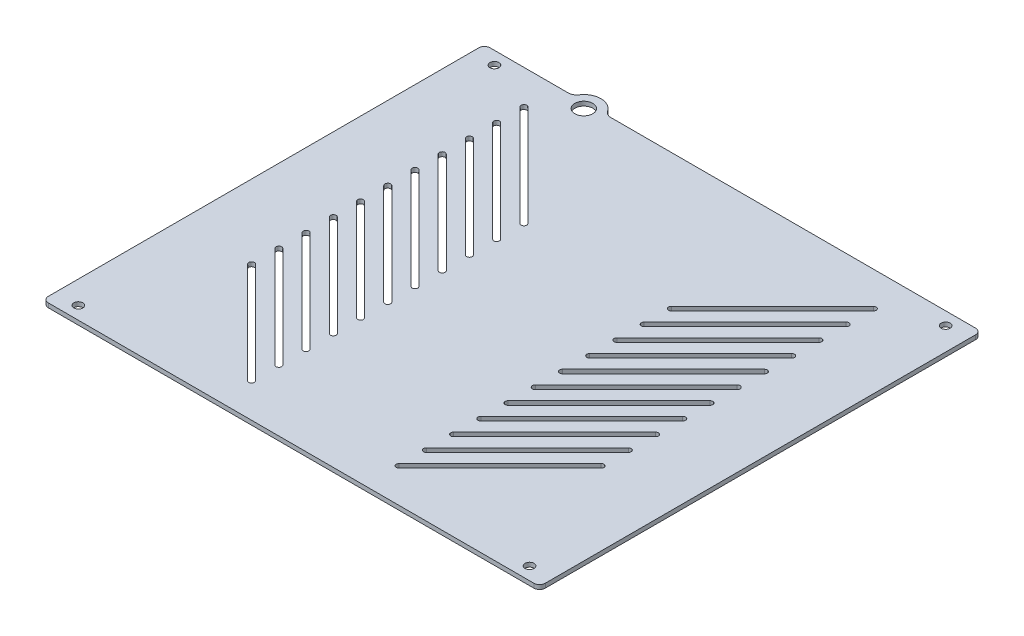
ISO-10303-21;
HEADER;
FILE_DESCRIPTION(('STEP AP214'),'2;1');
FILE_NAME('part.step','',(''),(''),'','','');
FILE_SCHEMA(('AUTOMOTIVE_DESIGN { 1 0 10303 214 1 1 1 1 }'));
ENDSEC;
DATA;
#1=APPLICATION_CONTEXT('core data for automotive mechanical design processes');
#2=APPLICATION_PROTOCOL_DEFINITION('international standard','automotive_design',2000,#1);
#3=PRODUCT_CONTEXT('',#1,'mechanical');
#4=PRODUCT('Part','Part','',(#3));
#5=PRODUCT_RELATED_PRODUCT_CATEGORY('part','',(#4));
#6=PRODUCT_DEFINITION_FORMATION('','',#4);
#7=PRODUCT_DEFINITION_CONTEXT('part definition',#1,'design');
#8=PRODUCT_DEFINITION('design','',#6,#7);
#9=PRODUCT_DEFINITION_SHAPE('','',#8);
#10=(LENGTH_UNIT() NAMED_UNIT(*) SI_UNIT(.MILLI.,.METRE.));
#11=(NAMED_UNIT(*) PLANE_ANGLE_UNIT() SI_UNIT($,.RADIAN.));
#12=(NAMED_UNIT(*) SI_UNIT($,.STERADIAN.) SOLID_ANGLE_UNIT());
#13=UNCERTAINTY_MEASURE_WITH_UNIT(LENGTH_MEASURE(1.E-05),#10,'distance_accuracy_value','');
#14=(GEOMETRIC_REPRESENTATION_CONTEXT(3) GLOBAL_UNCERTAINTY_ASSIGNED_CONTEXT((#13)) GLOBAL_UNIT_ASSIGNED_CONTEXT((#10,
#11,#12)) REPRESENTATION_CONTEXT('',''));
#15=CARTESIAN_POINT('',(0.,0.,0.));
#16=DIRECTION('',(0.,0.,1.));
#17=DIRECTION('',(1.,0.,0.));
#18=AXIS2_PLACEMENT_3D('',#15,#16,#17);
#19=CARTESIAN_POINT('',(87.,-1.5,-77.35));
#20=DIRECTION('',(0.,0.,-1.));
#21=DIRECTION('',(-1.,0.,0.));
#22=AXIS2_PLACEMENT_3D('',#19,#20,#21);
#23=PLANE('',#22);
#24=DIRECTION('',(-1.,0.,0.));
#25=VECTOR('',#24,1.);
#26=CARTESIAN_POINT('',(87.,0.,-77.35));
#27=LINE('',#26,#25);
#28=CARTESIAN_POINT('',(-57.6783131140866,0.,-77.35));
#29=VERTEX_POINT('',#28);
#30=CARTESIAN_POINT('',(-85.,0.,-77.35));
#31=VERTEX_POINT('',#30);
#32=EDGE_CURVE('E1419',#29,#31,#27,.T.);
#33=ORIENTED_EDGE('',*,*,#32,.F.);
#34=DIRECTION('',(0.,-1.,0.));
#35=VECTOR('',#34,1.);
#36=CARTESIAN_POINT('',(-57.6783131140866,-1.5,-77.35));
#37=LINE('',#36,#35);
#38=CARTESIAN_POINT('',(-57.6783131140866,-1.5,-77.35));
#39=VERTEX_POINT('',#38);
#40=EDGE_CURVE('E1463',#29,#39,#37,.T.);
#41=ORIENTED_EDGE('',*,*,#40,.T.);
#42=DIRECTION('',(-1.,0.,0.));
#43=VECTOR('',#42,1.);
#44=CARTESIAN_POINT('',(87.,-1.5,-77.35));
#45=LINE('',#44,#43);
#46=CARTESIAN_POINT('',(-85.,-1.5,-77.35));
#47=VERTEX_POINT('',#46);
#48=EDGE_CURVE('E1407',#39,#47,#45,.T.);
#49=ORIENTED_EDGE('',*,*,#48,.T.);
#50=DIRECTION('',(0.,1.,0.));
#51=VECTOR('',#50,1.);
#52=CARTESIAN_POINT('',(-85.,-1.5,-77.35));
#53=LINE('',#52,#51);
#54=EDGE_CURVE('E1422',#47,#31,#53,.T.);
#55=ORIENTED_EDGE('',*,*,#54,.T.);
#56=EDGE_LOOP('',(#33,#41,#49,#55));
#57=FACE_BOUND('',#56,.T.);
#58=ADVANCED_FACE('F43',(#57),#23,.T.);
#59=CARTESIAN_POINT('',(-87.,-1.5,77.3500000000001));
#60=DIRECTION('',(-1.,0.,0.));
#61=DIRECTION('',(0.,0.,1.));
#62=AXIS2_PLACEMENT_3D('',#59,#60,#61);
#63=PLANE('',#62);
#64=DIRECTION('',(0.,0.,1.));
#65=VECTOR('',#64,1.);
#66=CARTESIAN_POINT('',(-87.,0.,77.3500000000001));
#67=LINE('',#66,#65);
#68=CARTESIAN_POINT('',(-87.,0.,-75.35));
#69=VERTEX_POINT('',#68);
#70=CARTESIAN_POINT('',(-87.,0.,75.3500000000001));
#71=VERTEX_POINT('',#70);
#72=EDGE_CURVE('E1394',#69,#71,#67,.T.);
#73=ORIENTED_EDGE('',*,*,#72,.F.);
#74=DIRECTION('',(0.,1.,0.));
#75=VECTOR('',#74,1.);
#76=CARTESIAN_POINT('',(-87.,-1.5,-75.35));
#77=LINE('',#76,#75);
#78=CARTESIAN_POINT('',(-87.,-1.5,-75.35));
#79=VERTEX_POINT('',#78);
#80=EDGE_CURVE('E1436',#69,#79,#77,.F.);
#81=ORIENTED_EDGE('',*,*,#80,.T.);
#82=DIRECTION('',(0.,0.,1.));
#83=VECTOR('',#82,1.);
#84=CARTESIAN_POINT('',(-87.,-1.5,77.3500000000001));
#85=LINE('',#84,#83);
#86=CARTESIAN_POINT('',(-87.,-1.5,75.3500000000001));
#87=VERTEX_POINT('',#86);
#88=EDGE_CURVE('E1397',#79,#87,#85,.T.);
#89=ORIENTED_EDGE('',*,*,#88,.T.);
#90=DIRECTION('',(0.,1.,0.));
#91=VECTOR('',#90,1.);
#92=CARTESIAN_POINT('',(-87.,-1.5,75.3500000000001));
#93=LINE('',#92,#91);
#94=EDGE_CURVE('E1433',#87,#71,#93,.T.);
#95=ORIENTED_EDGE('',*,*,#94,.T.);
#96=EDGE_LOOP('',(#73,#81,#89,#95));
#97=FACE_BOUND('',#96,.T.);
#98=ADVANCED_FACE('F1496',(#97),#63,.T.);
#99=CARTESIAN_POINT('',(85.,-1.5,-77.35));
#100=VERTEX_POINT('',#99);
#101=CARTESIAN_POINT('',(-42.7116835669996,-1.5,-77.35));
#102=VERTEX_POINT('',#101);
#103=EDGE_CURVE('E1408',#100,#102,#45,.T.);
#104=ORIENTED_EDGE('',*,*,#103,.T.);
#105=DIRECTION('',(0.,-1.,0.));
#106=VECTOR('',#105,1.);
#107=CARTESIAN_POINT('',(-42.7116835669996,0.,-77.35));
#108=LINE('',#107,#106);
#109=CARTESIAN_POINT('',(-42.7116835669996,0.,-77.35));
#110=VERTEX_POINT('',#109);
#111=EDGE_CURVE('E64',#102,#110,#108,.F.);
#112=ORIENTED_EDGE('',*,*,#111,.T.);
#113=CARTESIAN_POINT('',(85.,0.,-77.35));
#114=VERTEX_POINT('',#113);
#115=EDGE_CURVE('E1401',#114,#110,#27,.T.);
#116=ORIENTED_EDGE('',*,*,#115,.F.);
#117=DIRECTION('',(0.,1.,0.));
#118=VECTOR('',#117,1.);
#119=CARTESIAN_POINT('',(85.,-1.5,-77.35));
#120=LINE('',#119,#118);
#121=EDGE_CURVE('E1410',#114,#100,#120,.F.);
#122=ORIENTED_EDGE('',*,*,#121,.T.);
#123=EDGE_LOOP('',(#104,#112,#116,#122));
#124=FACE_BOUND('',#123,.T.);
#125=ADVANCED_FACE('F1522',(#124),#23,.T.);
#126=CARTESIAN_POINT('',(87.,-1.5,77.35));
#127=DIRECTION('',(1.,0.,0.));
#128=DIRECTION('',(0.,0.,-1.));
#129=AXIS2_PLACEMENT_3D('',#126,#127,#128);
#130=PLANE('',#129);
#131=DIRECTION('',(0.,0.,-1.));
#132=VECTOR('',#131,1.);
#133=CARTESIAN_POINT('',(87.,-1.5,77.35));
#134=LINE('',#133,#132);
#135=CARTESIAN_POINT('',(87.,-1.5,75.35));
#136=VERTEX_POINT('',#135);
#137=CARTESIAN_POINT('',(87.,-1.5,-75.35));
#138=VERTEX_POINT('',#137);
#139=EDGE_CURVE('E1404',#136,#138,#134,.T.);
#140=ORIENTED_EDGE('',*,*,#139,.T.);
#141=DIRECTION('',(0.,1.,0.));
#142=VECTOR('',#141,1.);
#143=CARTESIAN_POINT('',(87.,-1.5,-75.35));
#144=LINE('',#143,#142);
#145=CARTESIAN_POINT('',(87.,0.,-75.35));
#146=VERTEX_POINT('',#145);
#147=EDGE_CURVE('E1449',#138,#146,#144,.T.);
#148=ORIENTED_EDGE('',*,*,#147,.T.);
#149=DIRECTION('',(0.,0.,-1.));
#150=VECTOR('',#149,1.);
#151=CARTESIAN_POINT('',(87.,0.,77.35));
#152=LINE('',#151,#150);
#153=CARTESIAN_POINT('',(87.,0.,75.35));
#154=VERTEX_POINT('',#153);
#155=EDGE_CURVE('E1416',#154,#146,#152,.T.);
#156=ORIENTED_EDGE('',*,*,#155,.F.);
#157=DIRECTION('',(0.,1.,0.));
#158=VECTOR('',#157,1.);
#159=CARTESIAN_POINT('',(87.,-1.5,75.35));
#160=LINE('',#159,#158);
#161=EDGE_CURVE('E1447',#154,#136,#160,.F.);
#162=ORIENTED_EDGE('',*,*,#161,.T.);
#163=EDGE_LOOP('',(#140,#148,#156,#162));
#164=FACE_BOUND('',#163,.T.);
#165=ADVANCED_FACE('F1514',(#164),#130,.T.);
#166=CARTESIAN_POINT('',(87.,-1.5,77.35));
#167=DIRECTION('',(0.,0.,1.));
#168=DIRECTION('',(1.,0.,0.));
#169=AXIS2_PLACEMENT_3D('',#166,#167,#168);
#170=PLANE('',#169);
#171=DIRECTION('',(1.,0.,0.));
#172=VECTOR('',#171,1.);
#173=CARTESIAN_POINT('',(87.,0.,77.35));
#174=LINE('',#173,#172);
#175=CARTESIAN_POINT('',(-85.,0.,77.3500000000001));
#176=VERTEX_POINT('',#175);
#177=CARTESIAN_POINT('',(85.,0.,77.35));
#178=VERTEX_POINT('',#177);
#179=EDGE_CURVE('E1413',#176,#178,#174,.T.);
#180=ORIENTED_EDGE('',*,*,#179,.F.);
#181=DIRECTION('',(0.,1.,0.));
#182=VECTOR('',#181,1.);
#183=CARTESIAN_POINT('',(-85.,-1.5,77.3500000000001));
#184=LINE('',#183,#182);
#185=CARTESIAN_POINT('',(-85.,-1.5,77.3500000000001));
#186=VERTEX_POINT('',#185);
#187=EDGE_CURVE('E1455',#176,#186,#184,.F.);
#188=ORIENTED_EDGE('',*,*,#187,.T.);
#189=DIRECTION('',(1.,0.,0.));
#190=VECTOR('',#189,1.);
#191=CARTESIAN_POINT('',(87.,-1.5,77.35));
#192=LINE('',#191,#190);
#193=CARTESIAN_POINT('',(85.,-1.5,77.35));
#194=VERTEX_POINT('',#193);
#195=EDGE_CURVE('E1400',#186,#194,#192,.T.);
#196=ORIENTED_EDGE('',*,*,#195,.T.);
#197=DIRECTION('',(0.,1.,0.));
#198=VECTOR('',#197,1.);
#199=CARTESIAN_POINT('',(85.,-1.5,77.35));
#200=LINE('',#199,#198);
#201=EDGE_CURVE('E1452',#194,#178,#200,.T.);
#202=ORIENTED_EDGE('',*,*,#201,.T.);
#203=EDGE_LOOP('',(#180,#188,#196,#202));
#204=FACE_BOUND('',#203,.T.);
#205=ADVANCED_FACE('F1505',(#204),#170,.T.);
#206=CARTESIAN_POINT('',(0.,-1.5,0.));
#207=DIRECTION('',(0.,1.,0.));
#208=DIRECTION('',(0.,0.,1.));
#209=AXIS2_PLACEMENT_3D('',#206,#207,#208);
#210=PLANE('',#209);
#211=CARTESIAN_POINT('',(-50.1949983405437,-1.5,-75.35));
#212=DIRECTION('',(0.,1.,0.));
#213=DIRECTION('',(0.,0.,1.));
#214=AXIS2_PLACEMENT_3D('',#211,#212,#213);
#215=CIRCLE('',#214,3.14999999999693);
#216=CARTESIAN_POINT('',(-50.1949983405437,-1.5,-72.2000000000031));
#217=VERTEX_POINT('',#216);
#218=EDGE_CURVE('E1524',#217,#217,#215,.T.);
#219=ORIENTED_EDGE('',*,*,#218,.T.);
#220=EDGE_LOOP('',(#219));
#221=FACE_BOUND('',#220,.T.);
#222=DIRECTION('',(-0.707106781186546,0.,0.707106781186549));
#223=VECTOR('',#222,1.);
#224=CARTESIAN_POINT('',(25.1152236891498,-1.5,-30.7017677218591));
#225=LINE('',#224,#223);
#226=CARTESIAN_POINT('',(60.4705627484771,-1.5,-66.0571067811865));
#227=VERTEX_POINT('',#226);
#228=CARTESIAN_POINT('',(25.1152236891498,-1.5,-30.7017677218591));
#229=VERTEX_POINT('',#228);
#230=EDGE_CURVE('E960',#227,#229,#225,.T.);
#231=ORIENTED_EDGE('',*,*,#230,.T.);
#232=CARTESIAN_POINT('',(25.8223304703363,-1.5,-29.9946609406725));
#233=DIRECTION('',(0.,1.,0.));
#234=DIRECTION('',(0.,0.,-1.));
#235=AXIS2_PLACEMENT_3D('',#232,#233,#234);
#236=CIRCLE('',#235,1.);
#237=CARTESIAN_POINT('',(26.5294372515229,-1.5,-29.287554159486));
#238=VERTEX_POINT('',#237);
#239=EDGE_CURVE('E972',#229,#238,#236,.T.);
#240=ORIENTED_EDGE('',*,*,#239,.T.);
#241=DIRECTION('',(0.707106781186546,0.,-0.707106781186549));
#242=VECTOR('',#241,1.);
#243=CARTESIAN_POINT('',(26.5294372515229,-1.5,-29.287554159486));
#244=LINE('',#243,#242);
#245=CARTESIAN_POINT('',(61.8847763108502,-1.5,-64.6428932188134));
#246=VERTEX_POINT('',#245);
#247=EDGE_CURVE('E986',#238,#246,#244,.T.);
#248=ORIENTED_EDGE('',*,*,#247,.T.);
#249=CARTESIAN_POINT('',(61.1776695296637,-1.5,-65.35));
#250=DIRECTION('',(0.,1.,0.));
#251=DIRECTION('',(0.,0.,1.));
#252=AXIS2_PLACEMENT_3D('',#249,#250,#251);
#253=CIRCLE('',#252,1.00000000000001);
#254=EDGE_CURVE('E983',#246,#227,#253,.T.);
#255=ORIENTED_EDGE('',*,*,#254,.T.);
#256=EDGE_LOOP('',(#231,#240,#248,#255));
#257=FACE_BOUND('',#256,.T.);
#258=DIRECTION('',(-0.707106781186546,0.,0.707106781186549));
#259=VECTOR('',#258,1.);
#260=CARTESIAN_POINT('',(25.1152236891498,-1.5,-21.1673016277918));
#261=LINE('',#260,#259);
#262=CARTESIAN_POINT('',(60.4705627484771,-1.5,-56.5226406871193));
#263=VERTEX_POINT('',#262);
#264=CARTESIAN_POINT('',(25.1152236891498,-1.5,-21.1673016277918));
#265=VERTEX_POINT('',#264);
#266=EDGE_CURVE('E994',#263,#265,#261,.T.);
#267=ORIENTED_EDGE('',*,*,#266,.T.);
#268=CARTESIAN_POINT('',(25.8223304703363,-1.5,-20.4601948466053));
#269=DIRECTION('',(0.,1.,0.));
#270=DIRECTION('',(0.,0.,-1.));
#271=AXIS2_PLACEMENT_3D('',#268,#269,#270);
#272=CIRCLE('',#271,1.);
#273=CARTESIAN_POINT('',(26.5294372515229,-1.5,-19.7530880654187));
#274=VERTEX_POINT('',#273);
#275=EDGE_CURVE('E1004',#265,#274,#272,.T.);
#276=ORIENTED_EDGE('',*,*,#275,.T.);
#277=DIRECTION('',(0.707106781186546,0.,-0.707106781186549));
#278=VECTOR('',#277,1.);
#279=CARTESIAN_POINT('',(26.5294372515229,-1.5,-19.7530880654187));
#280=LINE('',#279,#278);
#281=CARTESIAN_POINT('',(61.8847763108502,-1.5,-55.1084271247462));
#282=VERTEX_POINT('',#281);
#283=EDGE_CURVE('E1018',#274,#282,#280,.T.);
#284=ORIENTED_EDGE('',*,*,#283,.T.);
#285=CARTESIAN_POINT('',(61.1776695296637,-1.5,-55.8155339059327));
#286=DIRECTION('',(0.,1.,0.));
#287=DIRECTION('',(0.,0.,1.));
#288=AXIS2_PLACEMENT_3D('',#285,#286,#287);
#289=CIRCLE('',#288,1.);
#290=EDGE_CURVE('E1015',#282,#263,#289,.T.);
#291=ORIENTED_EDGE('',*,*,#290,.T.);
#292=EDGE_LOOP('',(#267,#276,#284,#291));
#293=FACE_BOUND('',#292,.T.);
#294=DIRECTION('',(-0.707106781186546,0.,-0.707106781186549));
#295=VECTOR('',#294,1.);
#296=CARTESIAN_POINT('',(-25.1152236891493,-1.5,-21.1673016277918));
#297=LINE('',#296,#295);
#298=CARTESIAN_POINT('',(-25.1152236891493,-1.5,-21.1673016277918));
#299=VERTEX_POINT('',#298);
#300=CARTESIAN_POINT('',(-60.4705627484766,-1.5,-56.5226406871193));
#301=VERTEX_POINT('',#300);
#302=EDGE_CURVE('E1026',#299,#301,#297,.T.);
#303=ORIENTED_EDGE('',*,*,#302,.T.);
#304=CARTESIAN_POINT('',(-61.1776695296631,-1.5,-55.8155339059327));
#305=DIRECTION('',(0.,1.,0.));
#306=DIRECTION('',(0.,0.,-1.));
#307=AXIS2_PLACEMENT_3D('',#304,#305,#306);
#308=CIRCLE('',#307,1.);
#309=CARTESIAN_POINT('',(-61.8847763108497,-1.5,-55.1084271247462));
#310=VERTEX_POINT('',#309);
#311=EDGE_CURVE('E1036',#301,#310,#308,.T.);
#312=ORIENTED_EDGE('',*,*,#311,.T.);
#313=DIRECTION('',(0.707106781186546,0.,0.707106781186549));
#314=VECTOR('',#313,1.);
#315=CARTESIAN_POINT('',(-26.5294372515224,-1.5,-19.7530880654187));
#316=LINE('',#315,#314);
#317=CARTESIAN_POINT('',(-26.5294372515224,-1.5,-19.7530880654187));
#318=VERTEX_POINT('',#317);
#319=EDGE_CURVE('E1050',#310,#318,#316,.T.);
#320=ORIENTED_EDGE('',*,*,#319,.T.);
#321=CARTESIAN_POINT('',(-25.8223304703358,-1.5,-20.4601948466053));
#322=DIRECTION('',(0.,1.,0.));
#323=DIRECTION('',(0.,0.,1.));
#324=AXIS2_PLACEMENT_3D('',#321,#322,#323);
#325=CIRCLE('',#324,1.);
#326=EDGE_CURVE('E1047',#318,#299,#325,.T.);
#327=ORIENTED_EDGE('',*,*,#326,.T.);
#328=EDGE_LOOP('',(#303,#312,#320,#327));
#329=FACE_BOUND('',#328,.T.);
#330=DIRECTION('',(-0.707106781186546,0.,-0.707106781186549));
#331=VECTOR('',#330,1.);
#332=CARTESIAN_POINT('',(-25.1152236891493,-1.5,-30.7017677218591));
#333=LINE('',#332,#331);
#334=CARTESIAN_POINT('',(-25.1152236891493,-1.5,-30.7017677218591));
#335=VERTEX_POINT('',#334);
#336=CARTESIAN_POINT('',(-60.4705627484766,-1.5,-66.0571067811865));
#337=VERTEX_POINT('',#336);
#338=EDGE_CURVE('E1058',#335,#337,#333,.T.);
#339=ORIENTED_EDGE('',*,*,#338,.T.);
#340=CARTESIAN_POINT('',(-61.1776695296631,-1.5,-65.35));
#341=DIRECTION('',(0.,1.,0.));
#342=DIRECTION('',(0.,0.,-1.));
#343=AXIS2_PLACEMENT_3D('',#340,#341,#342);
#344=CIRCLE('',#343,1.00000000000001);
#345=CARTESIAN_POINT('',(-61.8847763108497,-1.5,-64.6428932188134));
#346=VERTEX_POINT('',#345);
#347=EDGE_CURVE('E1068',#337,#346,#344,.T.);
#348=ORIENTED_EDGE('',*,*,#347,.T.);
#349=DIRECTION('',(0.707106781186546,0.,0.707106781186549));
#350=VECTOR('',#349,1.);
#351=CARTESIAN_POINT('',(-26.5294372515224,-1.5,-29.287554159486));
#352=LINE('',#351,#350);
#353=CARTESIAN_POINT('',(-26.5294372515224,-1.5,-29.287554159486));
#354=VERTEX_POINT('',#353);
#355=EDGE_CURVE('E1080',#346,#354,#352,.T.);
#356=ORIENTED_EDGE('',*,*,#355,.T.);
#357=CARTESIAN_POINT('',(-25.8223304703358,-1.5,-29.9946609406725));
#358=DIRECTION('',(0.,1.,0.));
#359=DIRECTION('',(0.,0.,1.));
#360=AXIS2_PLACEMENT_3D('',#357,#358,#359);
#361=CIRCLE('',#360,1.);
#362=EDGE_CURVE('E1077',#354,#335,#361,.T.);
#363=ORIENTED_EDGE('',*,*,#362,.T.);
#364=EDGE_LOOP('',(#339,#348,#356,#363));
#365=FACE_BOUND('',#364,.T.);
#366=DIRECTION('',(-0.707106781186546,0.,-0.707106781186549));
#367=VECTOR('',#366,1.);
#368=CARTESIAN_POINT('',(-25.1152236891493,-1.5,7.43609665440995));
#369=LINE('',#368,#367);
#370=CARTESIAN_POINT('',(-25.1152236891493,-1.5,7.43609665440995));
#371=VERTEX_POINT('',#370);
#372=CARTESIAN_POINT('',(-60.4705627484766,-1.5,-27.9192424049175));
#373=VERTEX_POINT('',#372);
#374=EDGE_CURVE('E864',#371,#373,#369,.T.);
#375=ORIENTED_EDGE('',*,*,#374,.T.);
#376=CARTESIAN_POINT('',(-61.1776695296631,-1.5,-27.2121356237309));
#377=DIRECTION('',(0.,1.,0.));
#378=DIRECTION('',(0.,0.,-1.));
#379=AXIS2_PLACEMENT_3D('',#376,#377,#378);
#380=CIRCLE('',#379,1.);
#381=CARTESIAN_POINT('',(-61.8847763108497,-1.5,-26.5050288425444));
#382=VERTEX_POINT('',#381);
#383=EDGE_CURVE('E874',#373,#382,#380,.T.);
#384=ORIENTED_EDGE('',*,*,#383,.T.);
#385=DIRECTION('',(0.707106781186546,0.,0.707106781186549));
#386=VECTOR('',#385,1.);
#387=CARTESIAN_POINT('',(-26.5294372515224,-1.5,8.85031021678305));
#388=LINE('',#387,#386);
#389=CARTESIAN_POINT('',(-26.5294372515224,-1.5,8.85031021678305));
#390=VERTEX_POINT('',#389);
#391=EDGE_CURVE('E888',#382,#390,#388,.T.);
#392=ORIENTED_EDGE('',*,*,#391,.T.);
#393=CARTESIAN_POINT('',(-25.8223304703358,-1.5,8.1432034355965));
#394=DIRECTION('',(0.,1.,0.));
#395=DIRECTION('',(0.,0.,1.));
#396=AXIS2_PLACEMENT_3D('',#393,#394,#395);
#397=CIRCLE('',#396,1.);
#398=EDGE_CURVE('E885',#390,#371,#397,.T.);
#399=ORIENTED_EDGE('',*,*,#398,.T.);
#400=EDGE_LOOP('',(#375,#384,#392,#399));
#401=FACE_BOUND('',#400,.T.);
#402=DIRECTION('',(-0.707106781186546,0.,-0.707106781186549));
#403=VECTOR('',#402,1.);
#404=CARTESIAN_POINT('',(-25.1152236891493,-1.5,16.9705627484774));
#405=LINE('',#404,#403);
#406=CARTESIAN_POINT('',(-25.1152236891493,-1.5,16.9705627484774));
#407=VERTEX_POINT('',#406);
#408=CARTESIAN_POINT('',(-60.4705627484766,-1.5,-18.3847763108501));
#409=VERTEX_POINT('',#408);
#410=EDGE_CURVE('E832',#407,#409,#405,.T.);
#411=ORIENTED_EDGE('',*,*,#410,.T.);
#412=CARTESIAN_POINT('',(-61.1776695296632,-1.5,-17.6776695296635));
#413=DIRECTION('',(0.,1.,0.));
#414=DIRECTION('',(0.,0.,-1.));
#415=AXIS2_PLACEMENT_3D('',#412,#413,#414);
#416=CIRCLE('',#415,0.999999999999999);
#417=CARTESIAN_POINT('',(-61.8847763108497,-1.5,-16.970562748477));
#418=VERTEX_POINT('',#417);
#419=EDGE_CURVE('E842',#409,#418,#416,.T.);
#420=ORIENTED_EDGE('',*,*,#419,.T.);
#421=DIRECTION('',(0.707106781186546,0.,0.707106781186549));
#422=VECTOR('',#421,1.);
#423=CARTESIAN_POINT('',(-26.5294372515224,-1.5,18.3847763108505));
#424=LINE('',#423,#422);
#425=CARTESIAN_POINT('',(-26.5294372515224,-1.5,18.3847763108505));
#426=VERTEX_POINT('',#425);
#427=EDGE_CURVE('E856',#418,#426,#424,.T.);
#428=ORIENTED_EDGE('',*,*,#427,.T.);
#429=CARTESIAN_POINT('',(-25.8223304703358,-1.5,17.6776695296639));
#430=DIRECTION('',(0.,1.,0.));
#431=DIRECTION('',(0.,0.,1.));
#432=AXIS2_PLACEMENT_3D('',#429,#430,#431);
#433=CIRCLE('',#432,0.999999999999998);
#434=EDGE_CURVE('E853',#426,#407,#433,.T.);
#435=ORIENTED_EDGE('',*,*,#434,.T.);
#436=EDGE_LOOP('',(#411,#420,#428,#435));
#437=FACE_BOUND('',#436,.T.);
#438=DIRECTION('',(-0.707106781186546,0.,-0.707106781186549));
#439=VECTOR('',#438,1.);
#440=CARTESIAN_POINT('',(-25.1152236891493,-1.5,-11.6328355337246));
#441=LINE('',#440,#439);
#442=CARTESIAN_POINT('',(-25.1152236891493,-1.5,-11.6328355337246));
#443=VERTEX_POINT('',#442);
#444=CARTESIAN_POINT('',(-60.4705627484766,-1.5,-46.988174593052));
#445=VERTEX_POINT('',#444);
#446=EDGE_CURVE('E928',#443,#445,#441,.T.);
#447=ORIENTED_EDGE('',*,*,#446,.T.);
#448=CARTESIAN_POINT('',(-61.1776695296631,-1.5,-46.2810678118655));
#449=DIRECTION('',(0.,1.,0.));
#450=DIRECTION('',(0.,0.,-1.));
#451=AXIS2_PLACEMENT_3D('',#448,#449,#450);
#452=CIRCLE('',#451,1.);
#453=CARTESIAN_POINT('',(-61.8847763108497,-1.5,-45.5739610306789));
#454=VERTEX_POINT('',#453);
#455=EDGE_CURVE('E938',#445,#454,#452,.T.);
#456=ORIENTED_EDGE('',*,*,#455,.T.);
#457=DIRECTION('',(0.707106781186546,0.,0.707106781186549));
#458=VECTOR('',#457,1.);
#459=CARTESIAN_POINT('',(-26.5294372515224,-1.5,-10.2186219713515));
#460=LINE('',#459,#458);
#461=CARTESIAN_POINT('',(-26.5294372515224,-1.5,-10.2186219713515));
#462=VERTEX_POINT('',#461);
#463=EDGE_CURVE('E952',#454,#462,#460,.T.);
#464=ORIENTED_EDGE('',*,*,#463,.T.);
#465=CARTESIAN_POINT('',(-25.8223304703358,-1.5,-10.925728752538));
#466=DIRECTION('',(0.,1.,0.));
#467=DIRECTION('',(0.,0.,1.));
#468=AXIS2_PLACEMENT_3D('',#465,#466,#467);
#469=CIRCLE('',#468,1.);
#470=EDGE_CURVE('E949',#462,#443,#469,.T.);
#471=ORIENTED_EDGE('',*,*,#470,.T.);
#472=EDGE_LOOP('',(#447,#456,#464,#471));
#473=FACE_BOUND('',#472,.T.);
#474=DIRECTION('',(-0.707106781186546,0.,-0.707106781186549));
#475=VECTOR('',#474,1.);
#476=CARTESIAN_POINT('',(-25.1152236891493,-1.5,-2.09836943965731));
#477=LINE('',#476,#475);
#478=CARTESIAN_POINT('',(-25.1152236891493,-1.5,-2.09836943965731));
#479=VERTEX_POINT('',#478);
#480=CARTESIAN_POINT('',(-60.4705627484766,-1.5,-37.4537084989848));
#481=VERTEX_POINT('',#480);
#482=EDGE_CURVE('E896',#479,#481,#477,.T.);
#483=ORIENTED_EDGE('',*,*,#482,.T.);
#484=CARTESIAN_POINT('',(-61.1776695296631,-1.5,-36.7466017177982));
#485=DIRECTION('',(0.,1.,0.));
#486=DIRECTION('',(0.,0.,-1.));
#487=AXIS2_PLACEMENT_3D('',#484,#485,#486);
#488=CIRCLE('',#487,1.);
#489=CARTESIAN_POINT('',(-61.8847763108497,-1.5,-36.0394949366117));
#490=VERTEX_POINT('',#489);
#491=EDGE_CURVE('E906',#481,#490,#488,.T.);
#492=ORIENTED_EDGE('',*,*,#491,.T.);
#493=DIRECTION('',(0.707106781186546,0.,0.707106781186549));
#494=VECTOR('',#493,1.);
#495=CARTESIAN_POINT('',(-26.5294372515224,-1.5,-0.684155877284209));
#496=LINE('',#495,#494);
#497=CARTESIAN_POINT('',(-26.5294372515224,-1.5,-0.684155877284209));
#498=VERTEX_POINT('',#497);
#499=EDGE_CURVE('E920',#490,#498,#496,.T.);
#500=ORIENTED_EDGE('',*,*,#499,.T.);
#501=CARTESIAN_POINT('',(-25.8223304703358,-1.5,-1.39126265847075));
#502=DIRECTION('',(0.,1.,0.));
#503=DIRECTION('',(0.,0.,1.));
#504=AXIS2_PLACEMENT_3D('',#501,#502,#503);
#505=CIRCLE('',#504,1.);
#506=EDGE_CURVE('E917',#498,#479,#505,.T.);
#507=ORIENTED_EDGE('',*,*,#506,.T.);
#508=EDGE_LOOP('',(#483,#492,#500,#507));
#509=FACE_BOUND('',#508,.T.);
#510=DIRECTION('',(-0.707106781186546,0.,0.707106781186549));
#511=VECTOR('',#510,1.);
#512=CARTESIAN_POINT('',(25.1152236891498,-1.5,36.0394949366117));
#513=LINE('',#512,#511);
#514=CARTESIAN_POINT('',(60.4705627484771,-1.5,0.684155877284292));
#515=VERTEX_POINT('',#514);
#516=CARTESIAN_POINT('',(25.1152236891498,-1.5,36.0394949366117));
#517=VERTEX_POINT('',#516);
#518=EDGE_CURVE('E1248',#515,#517,#513,.T.);
#519=ORIENTED_EDGE('',*,*,#518,.T.);
#520=CARTESIAN_POINT('',(25.8223304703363,-1.5,36.7466017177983));
#521=DIRECTION('',(0.,1.,0.));
#522=DIRECTION('',(0.,0.,-1.));
#523=AXIS2_PLACEMENT_3D('',#520,#521,#522);
#524=CIRCLE('',#523,1.);
#525=CARTESIAN_POINT('',(26.5294372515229,-1.5,37.4537084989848));
#526=VERTEX_POINT('',#525);
#527=EDGE_CURVE('E1258',#517,#526,#524,.T.);
#528=ORIENTED_EDGE('',*,*,#527,.T.);
#529=DIRECTION('',(0.707106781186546,0.,-0.707106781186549));
#530=VECTOR('',#529,1.);
#531=CARTESIAN_POINT('',(26.5294372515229,-1.5,37.4537084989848));
#532=LINE('',#531,#530);
#533=CARTESIAN_POINT('',(61.8847763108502,-1.5,2.09836943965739));
#534=VERTEX_POINT('',#533);
#535=EDGE_CURVE('E1272',#526,#534,#532,.T.);
#536=ORIENTED_EDGE('',*,*,#535,.T.);
#537=CARTESIAN_POINT('',(61.1776695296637,-1.5,1.39126265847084));
#538=DIRECTION('',(0.,1.,0.));
#539=DIRECTION('',(0.,0.,1.));
#540=AXIS2_PLACEMENT_3D('',#537,#538,#539);
#541=CIRCLE('',#540,1.);
#542=EDGE_CURVE('E1269',#534,#515,#541,.T.);
#543=ORIENTED_EDGE('',*,*,#542,.T.);
#544=EDGE_LOOP('',(#519,#528,#536,#543));
#545=FACE_BOUND('',#544,.T.);
#546=DIRECTION('',(-0.707106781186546,0.,0.707106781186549));
#547=VECTOR('',#546,1.);
#548=CARTESIAN_POINT('',(25.1152236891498,-1.5,26.5050288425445));
#549=LINE('',#548,#547);
#550=CARTESIAN_POINT('',(60.4705627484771,-1.5,-8.85031021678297));
#551=VERTEX_POINT('',#550);
#552=CARTESIAN_POINT('',(25.1152236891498,-1.5,26.5050288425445));
#553=VERTEX_POINT('',#552);
#554=EDGE_CURVE('E1216',#551,#553,#549,.T.);
#555=ORIENTED_EDGE('',*,*,#554,.T.);
#556=CARTESIAN_POINT('',(25.8223304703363,-1.5,27.212135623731));
#557=DIRECTION('',(0.,1.,0.));
#558=DIRECTION('',(0.,0.,-1.));
#559=AXIS2_PLACEMENT_3D('',#556,#557,#558);
#560=CIRCLE('',#559,1.);
#561=CARTESIAN_POINT('',(26.5294372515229,-1.5,27.9192424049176));
#562=VERTEX_POINT('',#561);
#563=EDGE_CURVE('E1226',#553,#562,#560,.T.);
#564=ORIENTED_EDGE('',*,*,#563,.T.);
#565=DIRECTION('',(0.707106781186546,0.,-0.707106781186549));
#566=VECTOR('',#565,1.);
#567=CARTESIAN_POINT('',(26.5294372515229,-1.5,27.9192424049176));
#568=LINE('',#567,#566);
#569=CARTESIAN_POINT('',(61.8847763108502,-1.5,-7.43609665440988));
#570=VERTEX_POINT('',#569);
#571=EDGE_CURVE('E1240',#562,#570,#568,.T.);
#572=ORIENTED_EDGE('',*,*,#571,.T.);
#573=CARTESIAN_POINT('',(61.1776695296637,-1.5,-8.14320343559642));
#574=DIRECTION('',(0.,1.,0.));
#575=DIRECTION('',(0.,0.,1.));
#576=AXIS2_PLACEMENT_3D('',#573,#574,#575);
#577=CIRCLE('',#576,1.);
#578=EDGE_CURVE('E1237',#570,#551,#577,.T.);
#579=ORIENTED_EDGE('',*,*,#578,.T.);
#580=EDGE_LOOP('',(#555,#564,#572,#579));
#581=FACE_BOUND('',#580,.T.);
#582=DIRECTION('',(-0.707106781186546,0.,0.707106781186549));
#583=VECTOR('',#582,1.);
#584=CARTESIAN_POINT('',(25.1152236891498,-1.5,55.1084271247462));
#585=LINE('',#584,#583);
#586=CARTESIAN_POINT('',(60.4705627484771,-1.5,19.7530880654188));
#587=VERTEX_POINT('',#586);
#588=CARTESIAN_POINT('',(25.1152236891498,-1.5,55.1084271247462));
#589=VERTEX_POINT('',#588);
#590=EDGE_CURVE('E1312',#587,#589,#585,.T.);
#591=ORIENTED_EDGE('',*,*,#590,.T.);
#592=CARTESIAN_POINT('',(25.8223304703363,-1.5,55.8155339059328));
#593=DIRECTION('',(0.,1.,0.));
#594=DIRECTION('',(0.,0.,-1.));
#595=AXIS2_PLACEMENT_3D('',#592,#593,#594);
#596=CIRCLE('',#595,1.);
#597=CARTESIAN_POINT('',(26.5294372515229,-1.5,56.5226406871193));
#598=VERTEX_POINT('',#597);
#599=EDGE_CURVE('E1322',#589,#598,#596,.T.);
#600=ORIENTED_EDGE('',*,*,#599,.T.);
#601=DIRECTION('',(0.707106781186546,0.,-0.707106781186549));
#602=VECTOR('',#601,1.);
#603=CARTESIAN_POINT('',(26.5294372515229,-1.5,56.5226406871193));
#604=LINE('',#603,#602);
#605=CARTESIAN_POINT('',(61.8847763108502,-1.5,21.1673016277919));
#606=VERTEX_POINT('',#605);
#607=EDGE_CURVE('E1336',#598,#606,#604,.T.);
#608=ORIENTED_EDGE('',*,*,#607,.T.);
#609=CARTESIAN_POINT('',(61.1776695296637,-1.5,20.4601948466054));
#610=DIRECTION('',(0.,1.,0.));
#611=DIRECTION('',(0.,0.,1.));
#612=AXIS2_PLACEMENT_3D('',#609,#610,#611);
#613=CIRCLE('',#612,1.);
#614=EDGE_CURVE('E1333',#606,#587,#613,.T.);
#615=ORIENTED_EDGE('',*,*,#614,.T.);
#616=EDGE_LOOP('',(#591,#600,#608,#615));
#617=FACE_BOUND('',#616,.T.);
#618=DIRECTION('',(-0.707106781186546,0.,0.707106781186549));
#619=VECTOR('',#618,1.);
#620=CARTESIAN_POINT('',(25.1152236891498,-1.5,45.573961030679));
#621=LINE('',#620,#619);
#622=CARTESIAN_POINT('',(60.4705627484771,-1.5,10.2186219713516));
#623=VERTEX_POINT('',#622);
#624=CARTESIAN_POINT('',(25.1152236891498,-1.5,45.573961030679));
#625=VERTEX_POINT('',#624);
#626=EDGE_CURVE('E1280',#623,#625,#621,.T.);
#627=ORIENTED_EDGE('',*,*,#626,.T.);
#628=CARTESIAN_POINT('',(25.8223304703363,-1.5,46.2810678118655));
#629=DIRECTION('',(0.,1.,0.));
#630=DIRECTION('',(0.,0.,-1.));
#631=AXIS2_PLACEMENT_3D('',#628,#629,#630);
#632=CIRCLE('',#631,1.);
#633=CARTESIAN_POINT('',(26.5294372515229,-1.5,46.9881745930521));
#634=VERTEX_POINT('',#633);
#635=EDGE_CURVE('E1290',#625,#634,#632,.T.);
#636=ORIENTED_EDGE('',*,*,#635,.T.);
#637=DIRECTION('',(0.707106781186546,0.,-0.707106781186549));
#638=VECTOR('',#637,1.);
#639=CARTESIAN_POINT('',(26.5294372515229,-1.5,46.9881745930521));
#640=LINE('',#639,#638);
#641=CARTESIAN_POINT('',(61.8847763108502,-1.5,11.6328355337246));
#642=VERTEX_POINT('',#641);
#643=EDGE_CURVE('E1304',#634,#642,#640,.T.);
#644=ORIENTED_EDGE('',*,*,#643,.T.);
#645=CARTESIAN_POINT('',(61.1776695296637,-1.5,10.9257287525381));
#646=DIRECTION('',(0.,1.,0.));
#647=DIRECTION('',(0.,0.,1.));
#648=AXIS2_PLACEMENT_3D('',#645,#646,#647);
#649=CIRCLE('',#648,1.);
#650=EDGE_CURVE('E1301',#642,#623,#649,.T.);
#651=ORIENTED_EDGE('',*,*,#650,.T.);
#652=EDGE_LOOP('',(#627,#636,#644,#651));
#653=FACE_BOUND('',#652,.T.);
#654=DIRECTION('',(-0.707106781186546,0.,0.707106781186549));
#655=VECTOR('',#654,1.);
#656=CARTESIAN_POINT('',(25.1152236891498,-1.5,-2.09836943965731));
#657=LINE('',#656,#655);
#658=CARTESIAN_POINT('',(60.4705627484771,-1.5,-37.4537084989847));
#659=VERTEX_POINT('',#658);
#660=CARTESIAN_POINT('',(25.1152236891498,-1.5,-2.09836943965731));
#661=VERTEX_POINT('',#660);
#662=EDGE_CURVE('E1120',#659,#661,#657,.T.);
#663=ORIENTED_EDGE('',*,*,#662,.T.);
#664=CARTESIAN_POINT('',(25.8223304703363,-1.5,-1.39126265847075));
#665=DIRECTION('',(0.,1.,0.));
#666=DIRECTION('',(0.,0.,-1.));
#667=AXIS2_PLACEMENT_3D('',#664,#665,#666);
#668=CIRCLE('',#667,1.);
#669=CARTESIAN_POINT('',(26.5294372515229,-1.5,-0.684155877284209));
#670=VERTEX_POINT('',#669);
#671=EDGE_CURVE('E1130',#661,#670,#668,.T.);
#672=ORIENTED_EDGE('',*,*,#671,.T.);
#673=DIRECTION('',(0.707106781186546,0.,-0.707106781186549));
#674=VECTOR('',#673,1.);
#675=CARTESIAN_POINT('',(26.5294372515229,-1.5,-0.684155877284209));
#676=LINE('',#675,#674);
#677=CARTESIAN_POINT('',(61.8847763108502,-1.5,-36.0394949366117));
#678=VERTEX_POINT('',#677);
#679=EDGE_CURVE('E1144',#670,#678,#676,.T.);
#680=ORIENTED_EDGE('',*,*,#679,.T.);
#681=CARTESIAN_POINT('',(61.1776695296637,-1.5,-36.7466017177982));
#682=DIRECTION('',(0.,1.,0.));
#683=DIRECTION('',(0.,0.,1.));
#684=AXIS2_PLACEMENT_3D('',#681,#682,#683);
#685=CIRCLE('',#684,1.);
#686=EDGE_CURVE('E1141',#678,#659,#685,.T.);
#687=ORIENTED_EDGE('',*,*,#686,.T.);
#688=EDGE_LOOP('',(#663,#672,#680,#687));
#689=FACE_BOUND('',#688,.T.);
#690=DIRECTION('',(-0.707106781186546,0.,0.707106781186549));
#691=VECTOR('',#690,1.);
#692=CARTESIAN_POINT('',(25.1152236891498,-1.5,-11.6328355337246));
#693=LINE('',#692,#691);
#694=CARTESIAN_POINT('',(60.4705627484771,-1.5,-46.988174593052));
#695=VERTEX_POINT('',#694);
#696=CARTESIAN_POINT('',(25.1152236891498,-1.5,-11.6328355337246));
#697=VERTEX_POINT('',#696);
#698=EDGE_CURVE('E1088',#695,#697,#693,.T.);
#699=ORIENTED_EDGE('',*,*,#698,.T.);
#700=CARTESIAN_POINT('',(25.8223304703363,-1.5,-10.925728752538));
#701=DIRECTION('',(0.,1.,0.));
#702=DIRECTION('',(0.,0.,-1.));
#703=AXIS2_PLACEMENT_3D('',#700,#701,#702);
#704=CIRCLE('',#703,1.);
#705=CARTESIAN_POINT('',(26.5294372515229,-1.5,-10.2186219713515));
#706=VERTEX_POINT('',#705);
#707=EDGE_CURVE('E1098',#697,#706,#704,.T.);
#708=ORIENTED_EDGE('',*,*,#707,.T.);
#709=DIRECTION('',(0.707106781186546,0.,-0.707106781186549));
#710=VECTOR('',#709,1.);
#711=CARTESIAN_POINT('',(26.5294372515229,-1.5,-10.2186219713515));
#712=LINE('',#711,#710);
#713=CARTESIAN_POINT('',(61.8847763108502,-1.5,-45.5739610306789));
#714=VERTEX_POINT('',#713);
#715=EDGE_CURVE('E1112',#706,#714,#712,.T.);
#716=ORIENTED_EDGE('',*,*,#715,.T.);
#717=CARTESIAN_POINT('',(61.1776695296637,-1.5,-46.2810678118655));
#718=DIRECTION('',(0.,1.,0.));
#719=DIRECTION('',(0.,0.,1.));
#720=AXIS2_PLACEMENT_3D('',#717,#718,#719);
#721=CIRCLE('',#720,1.);
#722=EDGE_CURVE('E1109',#714,#695,#721,.T.);
#723=ORIENTED_EDGE('',*,*,#722,.T.);
#724=EDGE_LOOP('',(#699,#708,#716,#723));
#725=FACE_BOUND('',#724,.T.);
#726=DIRECTION('',(-0.707106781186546,0.,0.707106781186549));
#727=VECTOR('',#726,1.);
#728=CARTESIAN_POINT('',(25.1152236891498,-1.5,16.9705627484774));
#729=LINE('',#728,#727);
#730=CARTESIAN_POINT('',(60.4705627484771,-1.5,-18.3847763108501));
#731=VERTEX_POINT('',#730);
#732=CARTESIAN_POINT('',(25.1152236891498,-1.5,16.9705627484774));
#733=VERTEX_POINT('',#732);
#734=EDGE_CURVE('E1184',#731,#733,#729,.T.);
#735=ORIENTED_EDGE('',*,*,#734,.T.);
#736=CARTESIAN_POINT('',(25.8223304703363,-1.5,17.6776695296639));
#737=DIRECTION('',(0.,1.,0.));
#738=DIRECTION('',(0.,0.,-1.));
#739=AXIS2_PLACEMENT_3D('',#736,#737,#738);
#740=CIRCLE('',#739,0.999999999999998);
#741=CARTESIAN_POINT('',(26.5294372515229,-1.5,18.3847763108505));
#742=VERTEX_POINT('',#741);
#743=EDGE_CURVE('E1194',#733,#742,#740,.T.);
#744=ORIENTED_EDGE('',*,*,#743,.T.);
#745=DIRECTION('',(0.707106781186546,0.,-0.707106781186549));
#746=VECTOR('',#745,1.);
#747=CARTESIAN_POINT('',(26.5294372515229,-1.5,18.3847763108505));
#748=LINE('',#747,#746);
#749=CARTESIAN_POINT('',(61.8847763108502,-1.5,-16.970562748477));
#750=VERTEX_POINT('',#749);
#751=EDGE_CURVE('E1208',#742,#750,#748,.T.);
#752=ORIENTED_EDGE('',*,*,#751,.T.);
#753=CARTESIAN_POINT('',(61.1776695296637,-1.5,-17.6776695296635));
#754=DIRECTION('',(0.,1.,0.));
#755=DIRECTION('',(0.,0.,1.));
#756=AXIS2_PLACEMENT_3D('',#753,#754,#755);
#757=CIRCLE('',#756,0.999999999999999);
#758=EDGE_CURVE('E1205',#750,#731,#757,.T.);
#759=ORIENTED_EDGE('',*,*,#758,.T.);
#760=EDGE_LOOP('',(#735,#744,#752,#759));
#761=FACE_BOUND('',#760,.T.);
#762=DIRECTION('',(-0.707106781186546,0.,0.707106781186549));
#763=VECTOR('',#762,1.);
#764=CARTESIAN_POINT('',(25.1152236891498,-1.5,7.43609665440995));
#765=LINE('',#764,#763);
#766=CARTESIAN_POINT('',(60.4705627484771,-1.5,-27.9192424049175));
#767=VERTEX_POINT('',#766);
#768=CARTESIAN_POINT('',(25.1152236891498,-1.5,7.43609665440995));
#769=VERTEX_POINT('',#768);
#770=EDGE_CURVE('E1152',#767,#769,#765,.T.);
#771=ORIENTED_EDGE('',*,*,#770,.T.);
#772=CARTESIAN_POINT('',(25.8223304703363,-1.5,8.1432034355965));
#773=DIRECTION('',(0.,1.,0.));
#774=DIRECTION('',(0.,0.,-1.));
#775=AXIS2_PLACEMENT_3D('',#772,#773,#774);
#776=CIRCLE('',#775,1.);
#777=CARTESIAN_POINT('',(26.5294372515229,-1.5,8.85031021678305));
#778=VERTEX_POINT('',#777);
#779=EDGE_CURVE('E1162',#769,#778,#776,.T.);
#780=ORIENTED_EDGE('',*,*,#779,.T.);
#781=DIRECTION('',(0.707106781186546,0.,-0.707106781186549));
#782=VECTOR('',#781,1.);
#783=CARTESIAN_POINT('',(26.5294372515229,-1.5,8.85031021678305));
#784=LINE('',#783,#782);
#785=CARTESIAN_POINT('',(61.8847763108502,-1.5,-26.5050288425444));
#786=VERTEX_POINT('',#785);
#787=EDGE_CURVE('E1176',#778,#786,#784,.T.);
#788=ORIENTED_EDGE('',*,*,#787,.T.);
#789=CARTESIAN_POINT('',(61.1776695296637,-1.5,-27.2121356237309));
#790=DIRECTION('',(0.,1.,0.));
#791=DIRECTION('',(0.,0.,1.));
#792=AXIS2_PLACEMENT_3D('',#789,#790,#791);
#793=CIRCLE('',#792,1.);
#794=EDGE_CURVE('E1173',#786,#767,#793,.T.);
#795=ORIENTED_EDGE('',*,*,#794,.T.);
#796=EDGE_LOOP('',(#771,#780,#788,#795));
#797=FACE_BOUND('',#796,.T.);
#798=DIRECTION('',(0.707106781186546,0.,0.707106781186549));
#799=VECTOR('',#798,1.);
#800=CARTESIAN_POINT('',(-26.5294372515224,-1.5,66.0571067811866));
#801=LINE('',#800,#799);
#802=CARTESIAN_POINT('',(-61.8847763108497,-1.5,30.7017677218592));
#803=VERTEX_POINT('',#802);
#804=CARTESIAN_POINT('',(-26.5294372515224,-1.5,66.0571067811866));
#805=VERTEX_POINT('',#804);
#806=EDGE_CURVE('E693',#803,#805,#801,.T.);
#807=ORIENTED_EDGE('',*,*,#806,.T.);
#808=CARTESIAN_POINT('',(-25.8223304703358,-1.5,65.3500000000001));
#809=DIRECTION('',(0.,1.,0.));
#810=DIRECTION('',(0.,0.,1.));
#811=AXIS2_PLACEMENT_3D('',#808,#809,#810);
#812=CIRCLE('',#811,1.);
#813=CARTESIAN_POINT('',(-25.1152236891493,-1.5,64.6428932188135));
#814=VERTEX_POINT('',#813);
#815=EDGE_CURVE('E666',#805,#814,#812,.T.);
#816=ORIENTED_EDGE('',*,*,#815,.T.);
#817=DIRECTION('',(-0.707106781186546,0.,-0.707106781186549));
#818=VECTOR('',#817,1.);
#819=CARTESIAN_POINT('',(-25.1152236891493,-1.5,64.6428932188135));
#820=LINE('',#819,#818);
#821=CARTESIAN_POINT('',(-60.4705627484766,-1.5,29.2875541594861));
#822=VERTEX_POINT('',#821);
#823=EDGE_CURVE('E699',#814,#822,#820,.T.);
#824=ORIENTED_EDGE('',*,*,#823,.T.);
#825=CARTESIAN_POINT('',(-61.1776695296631,-1.5,29.9946609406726));
#826=DIRECTION('',(0.,1.,0.));
#827=DIRECTION('',(0.,0.,-1.));
#828=AXIS2_PLACEMENT_3D('',#825,#826,#827);
#829=CIRCLE('',#828,1.);
#830=EDGE_CURVE('E695',#822,#803,#829,.T.);
#831=ORIENTED_EDGE('',*,*,#830,.T.);
#832=EDGE_LOOP('',(#807,#816,#824,#831));
#833=FACE_BOUND('',#832,.T.);
#834=DIRECTION('',(-0.707106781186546,0.,-0.707106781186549));
#835=VECTOR('',#834,1.);
#836=CARTESIAN_POINT('',(-25.1152236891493,-1.5,36.0394949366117));
#837=LINE('',#836,#835);
#838=CARTESIAN_POINT('',(-25.1152236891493,-1.5,36.0394949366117));
#839=VERTEX_POINT('',#838);
#840=CARTESIAN_POINT('',(-60.4705627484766,-1.5,0.684155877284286));
#841=VERTEX_POINT('',#840);
#842=EDGE_CURVE('E768',#839,#841,#837,.T.);
#843=ORIENTED_EDGE('',*,*,#842,.T.);
#844=CARTESIAN_POINT('',(-61.1776695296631,-1.5,1.39126265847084));
#845=DIRECTION('',(0.,1.,0.));
#846=DIRECTION('',(0.,0.,-1.));
#847=AXIS2_PLACEMENT_3D('',#844,#845,#846);
#848=CIRCLE('',#847,1.);
#849=CARTESIAN_POINT('',(-61.8847763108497,-1.5,2.09836943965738));
#850=VERTEX_POINT('',#849);
#851=EDGE_CURVE('E778',#841,#850,#848,.T.);
#852=ORIENTED_EDGE('',*,*,#851,.T.);
#853=DIRECTION('',(0.707106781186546,0.,0.707106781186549));
#854=VECTOR('',#853,1.);
#855=CARTESIAN_POINT('',(-26.5294372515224,-1.5,37.4537084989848));
#856=LINE('',#855,#854);
#857=CARTESIAN_POINT('',(-26.5294372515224,-1.5,37.4537084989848));
#858=VERTEX_POINT('',#857);
#859=EDGE_CURVE('E792',#850,#858,#856,.T.);
#860=ORIENTED_EDGE('',*,*,#859,.T.);
#861=CARTESIAN_POINT('',(-25.8223304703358,-1.5,36.7466017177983));
#862=DIRECTION('',(0.,1.,0.));
#863=DIRECTION('',(0.,0.,1.));
#864=AXIS2_PLACEMENT_3D('',#861,#862,#863);
#865=CIRCLE('',#864,1.);
#866=EDGE_CURVE('E789',#858,#839,#865,.T.);
#867=ORIENTED_EDGE('',*,*,#866,.T.);
#868=EDGE_LOOP('',(#843,#852,#860,#867));
#869=FACE_BOUND('',#868,.T.);
#870=DIRECTION('',(-0.707106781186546,0.,-0.707106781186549));
#871=VECTOR('',#870,1.);
#872=CARTESIAN_POINT('',(-25.1152236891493,-1.5,26.5050288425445));
#873=LINE('',#872,#871);
#874=CARTESIAN_POINT('',(-25.1152236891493,-1.5,26.5050288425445));
#875=VERTEX_POINT('',#874);
#876=CARTESIAN_POINT('',(-60.4705627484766,-1.5,-8.85031021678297));
#877=VERTEX_POINT('',#876);
#878=EDGE_CURVE('E800',#875,#877,#873,.T.);
#879=ORIENTED_EDGE('',*,*,#878,.T.);
#880=CARTESIAN_POINT('',(-61.1776695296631,-1.5,-8.14320343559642));
#881=DIRECTION('',(0.,1.,0.));
#882=DIRECTION('',(0.,0.,-1.));
#883=AXIS2_PLACEMENT_3D('',#880,#881,#882);
#884=CIRCLE('',#883,1.);
#885=CARTESIAN_POINT('',(-61.8847763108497,-1.5,-7.43609665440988));
#886=VERTEX_POINT('',#885);
#887=EDGE_CURVE('E810',#877,#886,#884,.T.);
#888=ORIENTED_EDGE('',*,*,#887,.T.);
#889=DIRECTION('',(0.707106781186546,0.,0.707106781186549));
#890=VECTOR('',#889,1.);
#891=CARTESIAN_POINT('',(-26.5294372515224,-1.5,27.9192424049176));
#892=LINE('',#891,#890);
#893=CARTESIAN_POINT('',(-26.5294372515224,-1.5,27.9192424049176));
#894=VERTEX_POINT('',#893);
#895=EDGE_CURVE('E824',#886,#894,#892,.T.);
#896=ORIENTED_EDGE('',*,*,#895,.T.);
#897=CARTESIAN_POINT('',(-25.8223304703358,-1.5,27.212135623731));
#898=DIRECTION('',(0.,1.,0.));
#899=DIRECTION('',(0.,0.,1.));
#900=AXIS2_PLACEMENT_3D('',#897,#898,#899);
#901=CIRCLE('',#900,1.);
#902=EDGE_CURVE('E821',#894,#875,#901,.T.);
#903=ORIENTED_EDGE('',*,*,#902,.T.);
#904=EDGE_LOOP('',(#879,#888,#896,#903));
#905=FACE_BOUND('',#904,.T.);
#906=DIRECTION('',(-0.707106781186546,0.,-0.707106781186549));
#907=VECTOR('',#906,1.);
#908=CARTESIAN_POINT('',(-25.1152236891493,-1.5,55.1084271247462));
#909=LINE('',#908,#907);
#910=CARTESIAN_POINT('',(-25.1152236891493,-1.5,55.1084271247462));
#911=VERTEX_POINT('',#910);
#912=CARTESIAN_POINT('',(-60.4705627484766,-1.5,19.7530880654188));
#913=VERTEX_POINT('',#912);
#914=EDGE_CURVE('E706',#911,#913,#909,.T.);
#915=ORIENTED_EDGE('',*,*,#914,.T.);
#916=CARTESIAN_POINT('',(-61.1776695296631,-1.5,20.4601948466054));
#917=DIRECTION('',(0.,1.,0.));
#918=DIRECTION('',(0.,0.,-1.));
#919=AXIS2_PLACEMENT_3D('',#916,#917,#918);
#920=CIRCLE('',#919,1.);
#921=CARTESIAN_POINT('',(-61.8847763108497,-1.5,21.1673016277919));
#922=VERTEX_POINT('',#921);
#923=EDGE_CURVE('E714',#913,#922,#920,.T.);
#924=ORIENTED_EDGE('',*,*,#923,.T.);
#925=DIRECTION('',(0.707106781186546,0.,0.707106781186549));
#926=VECTOR('',#925,1.);
#927=CARTESIAN_POINT('',(-26.5294372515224,-1.5,56.5226406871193));
#928=LINE('',#927,#926);
#929=CARTESIAN_POINT('',(-26.5294372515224,-1.5,56.5226406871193));
#930=VERTEX_POINT('',#929);
#931=EDGE_CURVE('E728',#922,#930,#928,.T.);
#932=ORIENTED_EDGE('',*,*,#931,.T.);
#933=CARTESIAN_POINT('',(-25.8223304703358,-1.5,55.8155339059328));
#934=DIRECTION('',(0.,1.,0.));
#935=DIRECTION('',(0.,0.,1.));
#936=AXIS2_PLACEMENT_3D('',#933,#934,#935);
#937=CIRCLE('',#936,1.);
#938=EDGE_CURVE('E725',#930,#911,#937,.T.);
#939=ORIENTED_EDGE('',*,*,#938,.T.);
#940=EDGE_LOOP('',(#915,#924,#932,#939));
#941=FACE_BOUND('',#940,.T.);
#942=DIRECTION('',(-0.707106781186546,0.,-0.707106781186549));
#943=VECTOR('',#942,1.);
#944=CARTESIAN_POINT('',(-25.1152236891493,-1.5,45.573961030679));
#945=LINE('',#944,#943);
#946=CARTESIAN_POINT('',(-25.1152236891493,-1.5,45.573961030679));
#947=VERTEX_POINT('',#946);
#948=CARTESIAN_POINT('',(-60.4705627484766,-1.5,10.2186219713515));
#949=VERTEX_POINT('',#948);
#950=EDGE_CURVE('E736',#947,#949,#945,.T.);
#951=ORIENTED_EDGE('',*,*,#950,.T.);
#952=CARTESIAN_POINT('',(-61.1776695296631,-1.5,10.9257287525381));
#953=DIRECTION('',(0.,1.,0.));
#954=DIRECTION('',(0.,0.,-1.));
#955=AXIS2_PLACEMENT_3D('',#952,#953,#954);
#956=CIRCLE('',#955,1.);
#957=CARTESIAN_POINT('',(-61.8847763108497,-1.5,11.6328355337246));
#958=VERTEX_POINT('',#957);
#959=EDGE_CURVE('E746',#949,#958,#956,.T.);
#960=ORIENTED_EDGE('',*,*,#959,.T.);
#961=DIRECTION('',(0.707106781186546,0.,0.707106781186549));
#962=VECTOR('',#961,1.);
#963=CARTESIAN_POINT('',(-26.5294372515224,-1.5,46.9881745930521));
#964=LINE('',#963,#962);
#965=CARTESIAN_POINT('',(-26.5294372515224,-1.5,46.9881745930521));
#966=VERTEX_POINT('',#965);
#967=EDGE_CURVE('E760',#958,#966,#964,.T.);
#968=ORIENTED_EDGE('',*,*,#967,.T.);
#969=CARTESIAN_POINT('',(-25.8223304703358,-1.5,46.2810678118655));
#970=DIRECTION('',(0.,1.,0.));
#971=DIRECTION('',(0.,0.,1.));
#972=AXIS2_PLACEMENT_3D('',#969,#970,#971);
#973=CIRCLE('',#972,1.);
#974=EDGE_CURVE('E757',#966,#947,#973,.T.);
#975=ORIENTED_EDGE('',*,*,#974,.T.);
#976=EDGE_LOOP('',(#951,#960,#968,#975));
#977=FACE_BOUND('',#976,.T.);
#978=DIRECTION('',(-0.707106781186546,0.,0.707106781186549));
#979=VECTOR('',#978,1.);
#980=CARTESIAN_POINT('',(25.1152236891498,-1.5,64.6428932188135));
#981=LINE('',#980,#979);
#982=CARTESIAN_POINT('',(60.4705627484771,-1.5,29.2875541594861));
#983=VERTEX_POINT('',#982);
#984=CARTESIAN_POINT('',(25.1152236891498,-1.5,64.6428932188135));
#985=VERTEX_POINT('',#984);
#986=EDGE_CURVE('E1351',#983,#985,#981,.T.);
#987=ORIENTED_EDGE('',*,*,#986,.T.);
#988=CARTESIAN_POINT('',(25.8223304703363,-1.5,65.3500000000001));
#989=DIRECTION('',(0.,1.,0.));
#990=DIRECTION('',(0.,0.,-1.));
#991=AXIS2_PLACEMENT_3D('',#988,#989,#990);
#992=CIRCLE('',#991,0.999999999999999);
#993=CARTESIAN_POINT('',(26.5294372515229,-1.5,66.0571067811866));
#994=VERTEX_POINT('',#993);
#995=EDGE_CURVE('E1341',#985,#994,#992,.T.);
#996=ORIENTED_EDGE('',*,*,#995,.T.);
#997=DIRECTION('',(0.707106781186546,0.,-0.707106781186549));
#998=VECTOR('',#997,1.);
#999=CARTESIAN_POINT('',(26.5294372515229,-1.5,66.0571067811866));
#1000=LINE('',#999,#998);
#1001=CARTESIAN_POINT('',(61.8847763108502,-1.5,30.7017677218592));
#1002=VERTEX_POINT('',#1001);
#1003=EDGE_CURVE('E1344',#994,#1002,#1000,.T.);
#1004=ORIENTED_EDGE('',*,*,#1003,.T.);
#1005=CARTESIAN_POINT('',(61.1776695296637,-1.5,29.9946609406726));
#1006=DIRECTION('',(0.,1.,0.));
#1007=DIRECTION('',(0.,0.,1.));
#1008=AXIS2_PLACEMENT_3D('',#1005,#1006,#1007);
#1009=CIRCLE('',#1008,1.);
#1010=EDGE_CURVE('E1348',#1002,#983,#1009,.T.);
#1011=ORIENTED_EDGE('',*,*,#1010,.T.);
#1012=EDGE_LOOP('',(#987,#996,#1004,#1011));
#1013=FACE_BOUND('',#1012,.T.);
#1014=CARTESIAN_POINT('',(-79.,-1.5,72.85));
#1015=DIRECTION('',(0.,1.,0.));
#1016=DIRECTION('',(0.,0.,1.));
#1017=AXIS2_PLACEMENT_3D('',#1014,#1015,#1016);
#1018=CIRCLE('',#1017,1.57500000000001);
#1019=CARTESIAN_POINT('',(-79.,-1.5,74.425));
#1020=VERTEX_POINT('',#1019);
#1021=EDGE_CURVE('E1373',#1020,#1020,#1018,.T.);
#1022=ORIENTED_EDGE('',*,*,#1021,.T.);
#1023=EDGE_LOOP('',(#1022));
#1024=FACE_BOUND('',#1023,.T.);
#1025=CARTESIAN_POINT('',(79.,-1.5,72.85));
#1026=DIRECTION('',(0.,1.,0.));
#1027=DIRECTION('',(0.,0.,1.));
#1028=AXIS2_PLACEMENT_3D('',#1025,#1026,#1027);
#1029=CIRCLE('',#1028,1.57499999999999);
#1030=CARTESIAN_POINT('',(79.,-1.5,74.425));
#1031=VERTEX_POINT('',#1030);
#1032=EDGE_CURVE('E1379',#1031,#1031,#1029,.T.);
#1033=ORIENTED_EDGE('',*,*,#1032,.T.);
#1034=EDGE_LOOP('',(#1033));
#1035=FACE_BOUND('',#1034,.T.);
#1036=CARTESIAN_POINT('',(79.,-1.5,-72.85));
#1037=DIRECTION('',(0.,1.,0.));
#1038=DIRECTION('',(0.,0.,1.));
#1039=AXIS2_PLACEMENT_3D('',#1036,#1037,#1038);
#1040=CIRCLE('',#1039,1.57499999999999);
#1041=CARTESIAN_POINT('',(79.,-1.5,-71.275));
#1042=VERTEX_POINT('',#1041);
#1043=EDGE_CURVE('E1385',#1042,#1042,#1040,.T.);
#1044=ORIENTED_EDGE('',*,*,#1043,.T.);
#1045=EDGE_LOOP('',(#1044));
#1046=FACE_BOUND('',#1045,.T.);
#1047=CARTESIAN_POINT('',(-79.,-1.5,-72.85));
#1048=DIRECTION('',(0.,1.,0.));
#1049=DIRECTION('',(0.,0.,1.));
#1050=AXIS2_PLACEMENT_3D('',#1047,#1048,#1049);
#1051=CIRCLE('',#1050,1.57499999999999);
#1052=CARTESIAN_POINT('',(-79.,-1.5,-71.275));
#1053=VERTEX_POINT('',#1052);
#1054=EDGE_CURVE('E1391',#1053,#1053,#1051,.T.);
#1055=ORIENTED_EDGE('',*,*,#1054,.T.);
#1056=EDGE_LOOP('',(#1055));
#1057=FACE_BOUND('',#1056,.T.);
#1058=ORIENTED_EDGE('',*,*,#48,.F.);
#1059=CARTESIAN_POINT('',(-57.6783131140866,-1.5,-80.35));
#1060=DIRECTION('',(0.,1.,0.));
#1061=DIRECTION('',(0.,0.,1.));
#1062=AXIS2_PLACEMENT_3D('',#1059,#1060,#1061);
#1063=CIRCLE('',#1062,3.);
#1064=CARTESIAN_POINT('',(-55.1838748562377,-1.5,-78.6833333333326));
#1065=VERTEX_POINT('',#1064);
#1066=EDGE_CURVE('E1468',#39,#1065,#1063,.T.);
#1067=ORIENTED_EDGE('',*,*,#1066,.T.);
#1068=CARTESIAN_POINT('',(-50.1949983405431,-1.5,-75.35));
#1069=DIRECTION('',(0.,1.,0.));
#1070=DIRECTION('',(0.,0.,1.));
#1071=AXIS2_PLACEMENT_3D('',#1068,#1069,#1070);
#1072=CIRCLE('',#1071,5.99999999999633);
#1073=CARTESIAN_POINT('',(-45.2061218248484,-1.5,-78.6833333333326));
#1074=VERTEX_POINT('',#1073);
#1075=EDGE_CURVE('E671',#1074,#1065,#1072,.T.);
#1076=ORIENTED_EDGE('',*,*,#1075,.F.);
#1077=CARTESIAN_POINT('',(-42.7116835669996,-1.5,-80.35));
#1078=DIRECTION('',(0.,1.,0.));
#1079=DIRECTION('',(0.,0.,1.));
#1080=AXIS2_PLACEMENT_3D('',#1077,#1078,#1079);
#1081=CIRCLE('',#1080,3.);
#1082=EDGE_CURVE('E51',#1074,#102,#1081,.T.);
#1083=ORIENTED_EDGE('',*,*,#1082,.T.);
#1084=ORIENTED_EDGE('',*,*,#103,.F.);
#1085=CARTESIAN_POINT('',(85.,-1.5,-75.35));
#1086=DIRECTION('',(0.,1.,0.));
#1087=DIRECTION('',(0.,0.,1.));
#1088=AXIS2_PLACEMENT_3D('',#1085,#1086,#1087);
#1089=CIRCLE('',#1088,2.);
#1090=EDGE_CURVE('E1442',#100,#138,#1089,.F.);
#1091=ORIENTED_EDGE('',*,*,#1090,.T.);
#1092=ORIENTED_EDGE('',*,*,#139,.F.);
#1093=CARTESIAN_POINT('',(85.,-1.5,75.35));
#1094=DIRECTION('',(0.,1.,0.));
#1095=DIRECTION('',(0.,0.,1.));
#1096=AXIS2_PLACEMENT_3D('',#1093,#1094,#1095);
#1097=CIRCLE('',#1096,2.);
#1098=EDGE_CURVE('E1438',#136,#194,#1097,.F.);
#1099=ORIENTED_EDGE('',*,*,#1098,.T.);
#1100=ORIENTED_EDGE('',*,*,#195,.F.);
#1101=CARTESIAN_POINT('',(-85.,-1.5,75.3500000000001));
#1102=DIRECTION('',(0.,1.,0.));
#1103=DIRECTION('',(0.,0.,1.));
#1104=AXIS2_PLACEMENT_3D('',#1101,#1102,#1103);
#1105=CIRCLE('',#1104,2.);
#1106=EDGE_CURVE('E1440',#186,#87,#1105,.F.);
#1107=ORIENTED_EDGE('',*,*,#1106,.T.);
#1108=ORIENTED_EDGE('',*,*,#88,.F.);
#1109=CARTESIAN_POINT('',(-85.,-1.5,-75.35));
#1110=DIRECTION('',(0.,1.,0.));
#1111=DIRECTION('',(0.,0.,1.));
#1112=AXIS2_PLACEMENT_3D('',#1109,#1110,#1111);
#1113=CIRCLE('',#1112,2.);
#1114=EDGE_CURVE('E1444',#79,#47,#1113,.F.);
#1115=ORIENTED_EDGE('',*,*,#1114,.T.);
#1116=EDGE_LOOP('',(#1058,#1067,#1076,#1083,#1084,#1091,#1092,#1099,#1100,#1107,#1108,#1115));
#1117=FACE_BOUND('',#1116,.T.);
#1118=ADVANCED_FACE('F1472',(#221,#257,#293,#329,#365,#401,#437,#473,#509,#545,#581,#617,#653,
#689,#725,#761,#797,#833,#869,#905,#941,#977,#1013,#1024,#1035,#1046,#1057,#1117),#210,.F.);
#1119=CARTESIAN_POINT('',(0.,0.,0.));
#1120=DIRECTION('',(0.,1.,0.));
#1121=DIRECTION('',(0.,0.,1.));
#1122=AXIS2_PLACEMENT_3D('',#1119,#1120,#1121);
#1123=PLANE('',#1122);
#1124=CARTESIAN_POINT('',(-50.1949983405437,0.,-75.35));
#1125=DIRECTION('',(0.,1.,0.));
#1126=DIRECTION('',(0.,0.,1.));
#1127=AXIS2_PLACEMENT_3D('',#1124,#1125,#1126);
#1128=CIRCLE('',#1127,3.14999999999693);
#1129=CARTESIAN_POINT('',(-50.1949983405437,0.,-72.2000000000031));
#1130=VERTEX_POINT('',#1129);
#1131=EDGE_CURVE('E1527',#1130,#1130,#1128,.T.);
#1132=ORIENTED_EDGE('',*,*,#1131,.F.);
#1133=EDGE_LOOP('',(#1132));
#1134=FACE_BOUND('',#1133,.T.);
#1135=ORIENTED_EDGE('',*,*,#115,.T.);
#1136=CARTESIAN_POINT('',(-42.7116835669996,0.,-80.35));
#1137=DIRECTION('',(0.,1.,0.));
#1138=DIRECTION('',(0.,0.,1.));
#1139=AXIS2_PLACEMENT_3D('',#1136,#1137,#1138);
#1140=CIRCLE('',#1139,3.);
#1141=CARTESIAN_POINT('',(-45.2061218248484,0.,-78.6833333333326));
#1142=VERTEX_POINT('',#1141);
#1143=EDGE_CURVE('E11',#110,#1142,#1140,.F.);
#1144=ORIENTED_EDGE('',*,*,#1143,.T.);
#1145=CARTESIAN_POINT('',(-50.1949983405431,0.,-75.35));
#1146=DIRECTION('',(0.,1.,0.));
#1147=DIRECTION('',(0.,0.,1.));
#1148=AXIS2_PLACEMENT_3D('',#1145,#1146,#1147);
#1149=CIRCLE('',#1148,5.99999999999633);
#1150=CARTESIAN_POINT('',(-55.1838748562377,0.,-78.6833333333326));
#1151=VERTEX_POINT('',#1150);
#1152=EDGE_CURVE('E1481',#1142,#1151,#1149,.T.);
#1153=ORIENTED_EDGE('',*,*,#1152,.T.);
#1154=CARTESIAN_POINT('',(-57.6783131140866,0.,-80.35));
#1155=DIRECTION('',(0.,1.,0.));
#1156=DIRECTION('',(0.,0.,1.));
#1157=AXIS2_PLACEMENT_3D('',#1154,#1155,#1156);
#1158=CIRCLE('',#1157,3.);
#1159=EDGE_CURVE('E1466',#1151,#29,#1158,.F.);
#1160=ORIENTED_EDGE('',*,*,#1159,.T.);
#1161=ORIENTED_EDGE('',*,*,#32,.T.);
#1162=CARTESIAN_POINT('',(-85.,0.,-75.35));
#1163=DIRECTION('',(0.,1.,0.));
#1164=DIRECTION('',(0.,0.,1.));
#1165=AXIS2_PLACEMENT_3D('',#1162,#1163,#1164);
#1166=CIRCLE('',#1165,2.);
#1167=EDGE_CURVE('E1431',#31,#69,#1166,.T.);
#1168=ORIENTED_EDGE('',*,*,#1167,.T.);
#1169=ORIENTED_EDGE('',*,*,#72,.T.);
#1170=CARTESIAN_POINT('',(-85.,0.,75.3500000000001));
#1171=DIRECTION('',(0.,1.,0.));
#1172=DIRECTION('',(0.,0.,1.));
#1173=AXIS2_PLACEMENT_3D('',#1170,#1171,#1172);
#1174=CIRCLE('',#1173,2.);
#1175=EDGE_CURVE('E1427',#71,#176,#1174,.T.);
#1176=ORIENTED_EDGE('',*,*,#1175,.T.);
#1177=ORIENTED_EDGE('',*,*,#179,.T.);
#1178=CARTESIAN_POINT('',(85.,0.,75.35));
#1179=DIRECTION('',(0.,1.,0.));
#1180=DIRECTION('',(0.,0.,1.));
#1181=AXIS2_PLACEMENT_3D('',#1178,#1179,#1180);
#1182=CIRCLE('',#1181,2.);
#1183=EDGE_CURVE('E1425',#178,#154,#1182,.T.);
#1184=ORIENTED_EDGE('',*,*,#1183,.T.);
#1185=ORIENTED_EDGE('',*,*,#155,.T.);
#1186=CARTESIAN_POINT('',(85.,0.,-75.35));
#1187=DIRECTION('',(0.,1.,0.));
#1188=DIRECTION('',(0.,0.,1.));
#1189=AXIS2_PLACEMENT_3D('',#1186,#1187,#1188);
#1190=CIRCLE('',#1189,2.);
#1191=EDGE_CURVE('E1429',#146,#114,#1190,.T.);
#1192=ORIENTED_EDGE('',*,*,#1191,.T.);
#1193=EDGE_LOOP('',(#1135,#1144,#1153,#1160,#1161,#1168,#1169,#1176,#1177,#1184,#1185,#1192));
#1194=FACE_BOUND('',#1193,.T.);
#1195=CARTESIAN_POINT('',(25.8223304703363,0.,-29.9946609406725));
#1196=DIRECTION('',(0.,1.,0.));
#1197=DIRECTION('',(0.,0.,-1.));
#1198=AXIS2_PLACEMENT_3D('',#1195,#1196,#1197);
#1199=CIRCLE('',#1198,1.);
#1200=CARTESIAN_POINT('',(25.1152236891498,0.,-30.7017677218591));
#1201=VERTEX_POINT('',#1200);
#1202=CARTESIAN_POINT('',(26.5294372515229,0.,-29.287554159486));
#1203=VERTEX_POINT('',#1202);
#1204=EDGE_CURVE('E978',#1201,#1203,#1199,.T.);
#1205=ORIENTED_EDGE('',*,*,#1204,.F.);
#1206=DIRECTION('',(-0.707106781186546,0.,0.707106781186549));
#1207=VECTOR('',#1206,1.);
#1208=CARTESIAN_POINT('',(25.1152236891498,0.,-30.7017677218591));
#1209=LINE('',#1208,#1207);
#1210=CARTESIAN_POINT('',(60.4705627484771,0.,-66.0571067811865));
#1211=VERTEX_POINT('',#1210);
#1212=EDGE_CURVE('E968',#1211,#1201,#1209,.T.);
#1213=ORIENTED_EDGE('',*,*,#1212,.F.);
#1214=CARTESIAN_POINT('',(61.1776695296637,0.,-65.35));
#1215=DIRECTION('',(0.,1.,0.));
#1216=DIRECTION('',(0.,0.,1.));
#1217=AXIS2_PLACEMENT_3D('',#1214,#1215,#1216);
#1218=CIRCLE('',#1217,1.00000000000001);
#1219=CARTESIAN_POINT('',(61.8847763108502,0.,-64.6428932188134));
#1220=VERTEX_POINT('',#1219);
#1221=EDGE_CURVE('E971',#1220,#1211,#1218,.T.);
#1222=ORIENTED_EDGE('',*,*,#1221,.F.);
#1223=DIRECTION('',(0.707106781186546,0.,-0.707106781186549));
#1224=VECTOR('',#1223,1.);
#1225=CARTESIAN_POINT('',(26.5294372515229,0.,-29.287554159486));
#1226=LINE('',#1225,#1224);
#1227=EDGE_CURVE('E975',#1203,#1220,#1226,.T.);
#1228=ORIENTED_EDGE('',*,*,#1227,.F.);
#1229=EDGE_LOOP('',(#1205,#1213,#1222,#1228));
#1230=FACE_BOUND('',#1229,.T.);
#1231=CARTESIAN_POINT('',(25.8223304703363,0.,-20.4601948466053));
#1232=DIRECTION('',(0.,1.,0.));
#1233=DIRECTION('',(0.,0.,-1.));
#1234=AXIS2_PLACEMENT_3D('',#1231,#1232,#1233);
#1235=CIRCLE('',#1234,1.);
#1236=CARTESIAN_POINT('',(25.1152236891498,0.,-21.1673016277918));
#1237=VERTEX_POINT('',#1236);
#1238=CARTESIAN_POINT('',(26.5294372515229,0.,-19.7530880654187));
#1239=VERTEX_POINT('',#1238);
#1240=EDGE_CURVE('E1010',#1237,#1239,#1235,.T.);
#1241=ORIENTED_EDGE('',*,*,#1240,.F.);
#1242=DIRECTION('',(-0.707106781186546,0.,0.707106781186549));
#1243=VECTOR('',#1242,1.);
#1244=CARTESIAN_POINT('',(25.1152236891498,0.,-21.1673016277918));
#1245=LINE('',#1244,#1243);
#1246=CARTESIAN_POINT('',(60.4705627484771,0.,-56.5226406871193));
#1247=VERTEX_POINT('',#1246);
#1248=EDGE_CURVE('E1000',#1247,#1237,#1245,.T.);
#1249=ORIENTED_EDGE('',*,*,#1248,.F.);
#1250=CARTESIAN_POINT('',(61.1776695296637,0.,-55.8155339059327));
#1251=DIRECTION('',(0.,1.,0.));
#1252=DIRECTION('',(0.,0.,1.));
#1253=AXIS2_PLACEMENT_3D('',#1250,#1251,#1252);
#1254=CIRCLE('',#1253,1.);
#1255=CARTESIAN_POINT('',(61.8847763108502,0.,-55.1084271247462));
#1256=VERTEX_POINT('',#1255);
#1257=EDGE_CURVE('E1003',#1256,#1247,#1254,.T.);
#1258=ORIENTED_EDGE('',*,*,#1257,.F.);
#1259=DIRECTION('',(0.707106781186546,0.,-0.707106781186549));
#1260=VECTOR('',#1259,1.);
#1261=CARTESIAN_POINT('',(26.5294372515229,0.,-19.7530880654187));
#1262=LINE('',#1261,#1260);
#1263=EDGE_CURVE('E1007',#1239,#1256,#1262,.T.);
#1264=ORIENTED_EDGE('',*,*,#1263,.F.);
#1265=EDGE_LOOP('',(#1241,#1249,#1258,#1264));
#1266=FACE_BOUND('',#1265,.T.);
#1267=CARTESIAN_POINT('',(-61.1776695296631,0.,-55.8155339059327));
#1268=DIRECTION('',(0.,1.,0.));
#1269=DIRECTION('',(0.,0.,-1.));
#1270=AXIS2_PLACEMENT_3D('',#1267,#1268,#1269);
#1271=CIRCLE('',#1270,1.);
#1272=CARTESIAN_POINT('',(-60.4705627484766,0.,-56.5226406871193));
#1273=VERTEX_POINT('',#1272);
#1274=CARTESIAN_POINT('',(-61.8847763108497,0.,-55.1084271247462));
#1275=VERTEX_POINT('',#1274);
#1276=EDGE_CURVE('E1042',#1273,#1275,#1271,.T.);
#1277=ORIENTED_EDGE('',*,*,#1276,.F.);
#1278=DIRECTION('',(-0.707106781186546,0.,-0.707106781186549));
#1279=VECTOR('',#1278,1.);
#1280=CARTESIAN_POINT('',(-25.1152236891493,0.,-21.1673016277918));
#1281=LINE('',#1280,#1279);
#1282=CARTESIAN_POINT('',(-25.1152236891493,0.,-21.1673016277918));
#1283=VERTEX_POINT('',#1282);
#1284=EDGE_CURVE('E1032',#1283,#1273,#1281,.T.);
#1285=ORIENTED_EDGE('',*,*,#1284,.F.);
#1286=CARTESIAN_POINT('',(-25.8223304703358,0.,-20.4601948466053));
#1287=DIRECTION('',(0.,1.,0.));
#1288=DIRECTION('',(0.,0.,1.));
#1289=AXIS2_PLACEMENT_3D('',#1286,#1287,#1288);
#1290=CIRCLE('',#1289,1.);
#1291=CARTESIAN_POINT('',(-26.5294372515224,0.,-19.7530880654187));
#1292=VERTEX_POINT('',#1291);
#1293=EDGE_CURVE('E1035',#1292,#1283,#1290,.T.);
#1294=ORIENTED_EDGE('',*,*,#1293,.F.);
#1295=DIRECTION('',(0.707106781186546,0.,0.707106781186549));
#1296=VECTOR('',#1295,1.);
#1297=CARTESIAN_POINT('',(-26.5294372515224,0.,-19.7530880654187));
#1298=LINE('',#1297,#1296);
#1299=EDGE_CURVE('E1039',#1275,#1292,#1298,.T.);
#1300=ORIENTED_EDGE('',*,*,#1299,.F.);
#1301=EDGE_LOOP('',(#1277,#1285,#1294,#1300));
#1302=FACE_BOUND('',#1301,.T.);
#1303=CARTESIAN_POINT('',(-61.1776695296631,0.,-65.35));
#1304=DIRECTION('',(0.,1.,0.));
#1305=DIRECTION('',(0.,0.,-1.));
#1306=AXIS2_PLACEMENT_3D('',#1303,#1304,#1305);
#1307=CIRCLE('',#1306,1.00000000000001);
#1308=CARTESIAN_POINT('',(-60.4705627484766,0.,-66.0571067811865));
#1309=VERTEX_POINT('',#1308);
#1310=CARTESIAN_POINT('',(-61.8847763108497,0.,-64.6428932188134));
#1311=VERTEX_POINT('',#1310);
#1312=EDGE_CURVE('E967',#1309,#1311,#1307,.T.);
#1313=ORIENTED_EDGE('',*,*,#1312,.F.);
#1314=DIRECTION('',(-0.707106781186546,0.,-0.707106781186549));
#1315=VECTOR('',#1314,1.);
#1316=CARTESIAN_POINT('',(-25.1152236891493,0.,-30.7017677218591));
#1317=LINE('',#1316,#1315);
#1318=CARTESIAN_POINT('',(-25.1152236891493,0.,-30.7017677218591));
#1319=VERTEX_POINT('',#1318);
#1320=EDGE_CURVE('E1064',#1319,#1309,#1317,.T.);
#1321=ORIENTED_EDGE('',*,*,#1320,.F.);
#1322=CARTESIAN_POINT('',(-25.8223304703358,0.,-29.9946609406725));
#1323=DIRECTION('',(0.,1.,0.));
#1324=DIRECTION('',(0.,0.,1.));
#1325=AXIS2_PLACEMENT_3D('',#1322,#1323,#1324);
#1326=CIRCLE('',#1325,1.);
#1327=CARTESIAN_POINT('',(-26.5294372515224,0.,-29.287554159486));
#1328=VERTEX_POINT('',#1327);
#1329=EDGE_CURVE('E1067',#1328,#1319,#1326,.T.);
#1330=ORIENTED_EDGE('',*,*,#1329,.F.);
#1331=DIRECTION('',(0.707106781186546,0.,0.707106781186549));
#1332=VECTOR('',#1331,1.);
#1333=CARTESIAN_POINT('',(-26.5294372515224,0.,-29.287554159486));
#1334=LINE('',#1333,#1332);
#1335=EDGE_CURVE('E1071',#1311,#1328,#1334,.T.);
#1336=ORIENTED_EDGE('',*,*,#1335,.F.);
#1337=EDGE_LOOP('',(#1313,#1321,#1330,#1336));
#1338=FACE_BOUND('',#1337,.T.);
#1339=CARTESIAN_POINT('',(-61.1776695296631,0.,-27.2121356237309));
#1340=DIRECTION('',(0.,1.,0.));
#1341=DIRECTION('',(0.,0.,-1.));
#1342=AXIS2_PLACEMENT_3D('',#1339,#1340,#1341);
#1343=CIRCLE('',#1342,1.);
#1344=CARTESIAN_POINT('',(-60.4705627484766,0.,-27.9192424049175));
#1345=VERTEX_POINT('',#1344);
#1346=CARTESIAN_POINT('',(-61.8847763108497,0.,-26.5050288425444));
#1347=VERTEX_POINT('',#1346);
#1348=EDGE_CURVE('E880',#1345,#1347,#1343,.T.);
#1349=ORIENTED_EDGE('',*,*,#1348,.F.);
#1350=DIRECTION('',(-0.707106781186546,0.,-0.707106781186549));
#1351=VECTOR('',#1350,1.);
#1352=CARTESIAN_POINT('',(-25.1152236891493,0.,7.43609665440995));
#1353=LINE('',#1352,#1351);
#1354=CARTESIAN_POINT('',(-25.1152236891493,0.,7.43609665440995));
#1355=VERTEX_POINT('',#1354);
#1356=EDGE_CURVE('E870',#1355,#1345,#1353,.T.);
#1357=ORIENTED_EDGE('',*,*,#1356,.F.);
#1358=CARTESIAN_POINT('',(-25.8223304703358,0.,8.1432034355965));
#1359=DIRECTION('',(0.,1.,0.));
#1360=DIRECTION('',(0.,0.,1.));
#1361=AXIS2_PLACEMENT_3D('',#1358,#1359,#1360);
#1362=CIRCLE('',#1361,1.);
#1363=CARTESIAN_POINT('',(-26.5294372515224,0.,8.85031021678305));
#1364=VERTEX_POINT('',#1363);
#1365=EDGE_CURVE('E873',#1364,#1355,#1362,.T.);
#1366=ORIENTED_EDGE('',*,*,#1365,.F.);
#1367=DIRECTION('',(0.707106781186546,0.,0.707106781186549));
#1368=VECTOR('',#1367,1.);
#1369=CARTESIAN_POINT('',(-26.5294372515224,0.,8.85031021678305));
#1370=LINE('',#1369,#1368);
#1371=EDGE_CURVE('E877',#1347,#1364,#1370,.T.);
#1372=ORIENTED_EDGE('',*,*,#1371,.F.);
#1373=EDGE_LOOP('',(#1349,#1357,#1366,#1372));
#1374=FACE_BOUND('',#1373,.T.);
#1375=CARTESIAN_POINT('',(-61.1776695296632,0.,-17.6776695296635));
#1376=DIRECTION('',(0.,1.,0.));
#1377=DIRECTION('',(0.,0.,-1.));
#1378=AXIS2_PLACEMENT_3D('',#1375,#1376,#1377);
#1379=CIRCLE('',#1378,0.999999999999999);
#1380=CARTESIAN_POINT('',(-60.4705627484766,0.,-18.3847763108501));
#1381=VERTEX_POINT('',#1380);
#1382=CARTESIAN_POINT('',(-61.8847763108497,0.,-16.970562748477));
#1383=VERTEX_POINT('',#1382);
#1384=EDGE_CURVE('E848',#1381,#1383,#1379,.T.);
#1385=ORIENTED_EDGE('',*,*,#1384,.F.);
#1386=DIRECTION('',(-0.707106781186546,0.,-0.707106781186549));
#1387=VECTOR('',#1386,1.);
#1388=CARTESIAN_POINT('',(-25.1152236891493,0.,16.9705627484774));
#1389=LINE('',#1388,#1387);
#1390=CARTESIAN_POINT('',(-25.1152236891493,0.,16.9705627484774));
#1391=VERTEX_POINT('',#1390);
#1392=EDGE_CURVE('E838',#1391,#1381,#1389,.T.);
#1393=ORIENTED_EDGE('',*,*,#1392,.F.);
#1394=CARTESIAN_POINT('',(-25.8223304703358,0.,17.6776695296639));
#1395=DIRECTION('',(0.,1.,0.));
#1396=DIRECTION('',(0.,0.,1.));
#1397=AXIS2_PLACEMENT_3D('',#1394,#1395,#1396);
#1398=CIRCLE('',#1397,0.999999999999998);
#1399=CARTESIAN_POINT('',(-26.5294372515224,0.,18.3847763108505));
#1400=VERTEX_POINT('',#1399);
#1401=EDGE_CURVE('E841',#1400,#1391,#1398,.T.);
#1402=ORIENTED_EDGE('',*,*,#1401,.F.);
#1403=DIRECTION('',(0.707106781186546,0.,0.707106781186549));
#1404=VECTOR('',#1403,1.);
#1405=CARTESIAN_POINT('',(-26.5294372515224,0.,18.3847763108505));
#1406=LINE('',#1405,#1404);
#1407=EDGE_CURVE('E845',#1383,#1400,#1406,.T.);
#1408=ORIENTED_EDGE('',*,*,#1407,.F.);
#1409=EDGE_LOOP('',(#1385,#1393,#1402,#1408));
#1410=FACE_BOUND('',#1409,.T.);
#1411=CARTESIAN_POINT('',(-61.1776695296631,0.,-46.2810678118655));
#1412=DIRECTION('',(0.,1.,0.));
#1413=DIRECTION('',(0.,0.,-1.));
#1414=AXIS2_PLACEMENT_3D('',#1411,#1412,#1413);
#1415=CIRCLE('',#1414,1.);
#1416=CARTESIAN_POINT('',(-60.4705627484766,0.,-46.988174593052));
#1417=VERTEX_POINT('',#1416);
#1418=CARTESIAN_POINT('',(-61.8847763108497,0.,-45.5739610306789));
#1419=VERTEX_POINT('',#1418);
#1420=EDGE_CURVE('E944',#1417,#1419,#1415,.T.);
#1421=ORIENTED_EDGE('',*,*,#1420,.F.);
#1422=DIRECTION('',(-0.707106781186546,0.,-0.707106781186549));
#1423=VECTOR('',#1422,1.);
#1424=CARTESIAN_POINT('',(-25.1152236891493,0.,-11.6328355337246));
#1425=LINE('',#1424,#1423);
#1426=CARTESIAN_POINT('',(-25.1152236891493,0.,-11.6328355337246));
#1427=VERTEX_POINT('',#1426);
#1428=EDGE_CURVE('E934',#1427,#1417,#1425,.T.);
#1429=ORIENTED_EDGE('',*,*,#1428,.F.);
#1430=CARTESIAN_POINT('',(-25.8223304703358,0.,-10.925728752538));
#1431=DIRECTION('',(0.,1.,0.));
#1432=DIRECTION('',(0.,0.,1.));
#1433=AXIS2_PLACEMENT_3D('',#1430,#1431,#1432);
#1434=CIRCLE('',#1433,1.);
#1435=CARTESIAN_POINT('',(-26.5294372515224,0.,-10.2186219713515));
#1436=VERTEX_POINT('',#1435);
#1437=EDGE_CURVE('E937',#1436,#1427,#1434,.T.);
#1438=ORIENTED_EDGE('',*,*,#1437,.F.);
#1439=DIRECTION('',(0.707106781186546,0.,0.707106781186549));
#1440=VECTOR('',#1439,1.);
#1441=CARTESIAN_POINT('',(-26.5294372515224,0.,-10.2186219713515));
#1442=LINE('',#1441,#1440);
#1443=EDGE_CURVE('E941',#1419,#1436,#1442,.T.);
#1444=ORIENTED_EDGE('',*,*,#1443,.F.);
#1445=EDGE_LOOP('',(#1421,#1429,#1438,#1444));
#1446=FACE_BOUND('',#1445,.T.);
#1447=CARTESIAN_POINT('',(-61.1776695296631,0.,-36.7466017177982));
#1448=DIRECTION('',(0.,1.,0.));
#1449=DIRECTION('',(0.,0.,-1.));
#1450=AXIS2_PLACEMENT_3D('',#1447,#1448,#1449);
#1451=CIRCLE('',#1450,1.);
#1452=CARTESIAN_POINT('',(-60.4705627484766,0.,-37.4537084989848));
#1453=VERTEX_POINT('',#1452);
#1454=CARTESIAN_POINT('',(-61.8847763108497,0.,-36.0394949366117));
#1455=VERTEX_POINT('',#1454);
#1456=EDGE_CURVE('E912',#1453,#1455,#1451,.T.);
#1457=ORIENTED_EDGE('',*,*,#1456,.F.);
#1458=DIRECTION('',(-0.707106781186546,0.,-0.707106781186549));
#1459=VECTOR('',#1458,1.);
#1460=CARTESIAN_POINT('',(-25.1152236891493,0.,-2.09836943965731));
#1461=LINE('',#1460,#1459);
#1462=CARTESIAN_POINT('',(-25.1152236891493,0.,-2.09836943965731));
#1463=VERTEX_POINT('',#1462);
#1464=EDGE_CURVE('E902',#1463,#1453,#1461,.T.);
#1465=ORIENTED_EDGE('',*,*,#1464,.F.);
#1466=CARTESIAN_POINT('',(-25.8223304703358,0.,-1.39126265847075));
#1467=DIRECTION('',(0.,1.,0.));
#1468=DIRECTION('',(0.,0.,1.));
#1469=AXIS2_PLACEMENT_3D('',#1466,#1467,#1468);
#1470=CIRCLE('',#1469,1.);
#1471=CARTESIAN_POINT('',(-26.5294372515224,0.,-0.684155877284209));
#1472=VERTEX_POINT('',#1471);
#1473=EDGE_CURVE('E905',#1472,#1463,#1470,.T.);
#1474=ORIENTED_EDGE('',*,*,#1473,.F.);
#1475=DIRECTION('',(0.707106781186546,0.,0.707106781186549));
#1476=VECTOR('',#1475,1.);
#1477=CARTESIAN_POINT('',(-26.5294372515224,0.,-0.684155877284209));
#1478=LINE('',#1477,#1476);
#1479=EDGE_CURVE('E909',#1455,#1472,#1478,.T.);
#1480=ORIENTED_EDGE('',*,*,#1479,.F.);
#1481=EDGE_LOOP('',(#1457,#1465,#1474,#1480));
#1482=FACE_BOUND('',#1481,.T.);
#1483=CARTESIAN_POINT('',(25.8223304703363,0.,36.7466017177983));
#1484=DIRECTION('',(0.,1.,0.));
#1485=DIRECTION('',(0.,0.,-1.));
#1486=AXIS2_PLACEMENT_3D('',#1483,#1484,#1485);
#1487=CIRCLE('',#1486,1.);
#1488=CARTESIAN_POINT('',(25.1152236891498,0.,36.0394949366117));
#1489=VERTEX_POINT('',#1488);
#1490=CARTESIAN_POINT('',(26.5294372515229,0.,37.4537084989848));
#1491=VERTEX_POINT('',#1490);
#1492=EDGE_CURVE('E1264',#1489,#1491,#1487,.T.);
#1493=ORIENTED_EDGE('',*,*,#1492,.F.);
#1494=DIRECTION('',(-0.707106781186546,0.,0.707106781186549));
#1495=VECTOR('',#1494,1.);
#1496=CARTESIAN_POINT('',(25.1152236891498,0.,36.0394949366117));
#1497=LINE('',#1496,#1495);
#1498=CARTESIAN_POINT('',(60.4705627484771,0.,0.684155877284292));
#1499=VERTEX_POINT('',#1498);
#1500=EDGE_CURVE('E1254',#1499,#1489,#1497,.T.);
#1501=ORIENTED_EDGE('',*,*,#1500,.F.);
#1502=CARTESIAN_POINT('',(61.1776695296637,0.,1.39126265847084));
#1503=DIRECTION('',(0.,1.,0.));
#1504=DIRECTION('',(0.,0.,1.));
#1505=AXIS2_PLACEMENT_3D('',#1502,#1503,#1504);
#1506=CIRCLE('',#1505,1.);
#1507=CARTESIAN_POINT('',(61.8847763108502,0.,2.09836943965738));
#1508=VERTEX_POINT('',#1507);
#1509=EDGE_CURVE('E1257',#1508,#1499,#1506,.T.);
#1510=ORIENTED_EDGE('',*,*,#1509,.F.);
#1511=DIRECTION('',(0.707106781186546,0.,-0.707106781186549));
#1512=VECTOR('',#1511,1.);
#1513=CARTESIAN_POINT('',(26.5294372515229,0.,37.4537084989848));
#1514=LINE('',#1513,#1512);
#1515=EDGE_CURVE('E1261',#1491,#1508,#1514,.T.);
#1516=ORIENTED_EDGE('',*,*,#1515,.F.);
#1517=EDGE_LOOP('',(#1493,#1501,#1510,#1516));
#1518=FACE_BOUND('',#1517,.T.);
#1519=CARTESIAN_POINT('',(25.8223304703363,0.,27.212135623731));
#1520=DIRECTION('',(0.,1.,0.));
#1521=DIRECTION('',(0.,0.,-1.));
#1522=AXIS2_PLACEMENT_3D('',#1519,#1520,#1521);
#1523=CIRCLE('',#1522,1.);
#1524=CARTESIAN_POINT('',(25.1152236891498,0.,26.5050288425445));
#1525=VERTEX_POINT('',#1524);
#1526=CARTESIAN_POINT('',(26.5294372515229,0.,27.9192424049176));
#1527=VERTEX_POINT('',#1526);
#1528=EDGE_CURVE('E1232',#1525,#1527,#1523,.T.);
#1529=ORIENTED_EDGE('',*,*,#1528,.F.);
#1530=DIRECTION('',(-0.707106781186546,0.,0.707106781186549));
#1531=VECTOR('',#1530,1.);
#1532=CARTESIAN_POINT('',(25.1152236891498,0.,26.5050288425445));
#1533=LINE('',#1532,#1531);
#1534=CARTESIAN_POINT('',(60.4705627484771,0.,-8.85031021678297));
#1535=VERTEX_POINT('',#1534);
#1536=EDGE_CURVE('E1222',#1535,#1525,#1533,.T.);
#1537=ORIENTED_EDGE('',*,*,#1536,.F.);
#1538=CARTESIAN_POINT('',(61.1776695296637,0.,-8.14320343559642));
#1539=DIRECTION('',(0.,1.,0.));
#1540=DIRECTION('',(0.,0.,1.));
#1541=AXIS2_PLACEMENT_3D('',#1538,#1539,#1540);
#1542=CIRCLE('',#1541,1.);
#1543=CARTESIAN_POINT('',(61.8847763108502,0.,-7.43609665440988));
#1544=VERTEX_POINT('',#1543);
#1545=EDGE_CURVE('E1225',#1544,#1535,#1542,.T.);
#1546=ORIENTED_EDGE('',*,*,#1545,.F.);
#1547=DIRECTION('',(0.707106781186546,0.,-0.707106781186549));
#1548=VECTOR('',#1547,1.);
#1549=CARTESIAN_POINT('',(26.5294372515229,0.,27.9192424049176));
#1550=LINE('',#1549,#1548);
#1551=EDGE_CURVE('E1229',#1527,#1544,#1550,.T.);
#1552=ORIENTED_EDGE('',*,*,#1551,.F.);
#1553=EDGE_LOOP('',(#1529,#1537,#1546,#1552));
#1554=FACE_BOUND('',#1553,.T.);
#1555=CARTESIAN_POINT('',(25.8223304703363,0.,55.8155339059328));
#1556=DIRECTION('',(0.,1.,0.));
#1557=DIRECTION('',(0.,0.,-1.));
#1558=AXIS2_PLACEMENT_3D('',#1555,#1556,#1557);
#1559=CIRCLE('',#1558,1.);
#1560=CARTESIAN_POINT('',(25.1152236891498,0.,55.1084271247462));
#1561=VERTEX_POINT('',#1560);
#1562=CARTESIAN_POINT('',(26.5294372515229,0.,56.5226406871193));
#1563=VERTEX_POINT('',#1562);
#1564=EDGE_CURVE('E1328',#1561,#1563,#1559,.T.);
#1565=ORIENTED_EDGE('',*,*,#1564,.F.);
#1566=DIRECTION('',(-0.707106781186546,0.,0.707106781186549));
#1567=VECTOR('',#1566,1.);
#1568=CARTESIAN_POINT('',(25.1152236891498,0.,55.1084271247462));
#1569=LINE('',#1568,#1567);
#1570=CARTESIAN_POINT('',(60.4705627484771,0.,19.7530880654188));
#1571=VERTEX_POINT('',#1570);
#1572=EDGE_CURVE('E1318',#1571,#1561,#1569,.T.);
#1573=ORIENTED_EDGE('',*,*,#1572,.F.);
#1574=CARTESIAN_POINT('',(61.1776695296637,0.,20.4601948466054));
#1575=DIRECTION('',(0.,1.,0.));
#1576=DIRECTION('',(0.,0.,1.));
#1577=AXIS2_PLACEMENT_3D('',#1574,#1575,#1576);
#1578=CIRCLE('',#1577,1.);
#1579=CARTESIAN_POINT('',(61.8847763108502,0.,21.1673016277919));
#1580=VERTEX_POINT('',#1579);
#1581=EDGE_CURVE('E1321',#1580,#1571,#1578,.T.);
#1582=ORIENTED_EDGE('',*,*,#1581,.F.);
#1583=DIRECTION('',(0.707106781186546,0.,-0.707106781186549));
#1584=VECTOR('',#1583,1.);
#1585=CARTESIAN_POINT('',(26.5294372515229,0.,56.5226406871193));
#1586=LINE('',#1585,#1584);
#1587=EDGE_CURVE('E1325',#1563,#1580,#1586,.T.);
#1588=ORIENTED_EDGE('',*,*,#1587,.F.);
#1589=EDGE_LOOP('',(#1565,#1573,#1582,#1588));
#1590=FACE_BOUND('',#1589,.T.);
#1591=CARTESIAN_POINT('',(25.8223304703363,0.,46.2810678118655));
#1592=DIRECTION('',(0.,1.,0.));
#1593=DIRECTION('',(0.,0.,-1.));
#1594=AXIS2_PLACEMENT_3D('',#1591,#1592,#1593);
#1595=CIRCLE('',#1594,1.);
#1596=CARTESIAN_POINT('',(25.1152236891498,0.,45.573961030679));
#1597=VERTEX_POINT('',#1596);
#1598=CARTESIAN_POINT('',(26.5294372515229,0.,46.9881745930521));
#1599=VERTEX_POINT('',#1598);
#1600=EDGE_CURVE('E1296',#1597,#1599,#1595,.T.);
#1601=ORIENTED_EDGE('',*,*,#1600,.F.);
#1602=DIRECTION('',(-0.707106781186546,0.,0.707106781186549));
#1603=VECTOR('',#1602,1.);
#1604=CARTESIAN_POINT('',(25.1152236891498,0.,45.573961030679));
#1605=LINE('',#1604,#1603);
#1606=CARTESIAN_POINT('',(60.4705627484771,0.,10.2186219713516));
#1607=VERTEX_POINT('',#1606);
#1608=EDGE_CURVE('E1286',#1607,#1597,#1605,.T.);
#1609=ORIENTED_EDGE('',*,*,#1608,.F.);
#1610=CARTESIAN_POINT('',(61.1776695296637,0.,10.9257287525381));
#1611=DIRECTION('',(0.,1.,0.));
#1612=DIRECTION('',(0.,0.,1.));
#1613=AXIS2_PLACEMENT_3D('',#1610,#1611,#1612);
#1614=CIRCLE('',#1613,1.);
#1615=CARTESIAN_POINT('',(61.8847763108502,0.,11.6328355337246));
#1616=VERTEX_POINT('',#1615);
#1617=EDGE_CURVE('E1289',#1616,#1607,#1614,.T.);
#1618=ORIENTED_EDGE('',*,*,#1617,.F.);
#1619=DIRECTION('',(0.707106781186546,0.,-0.707106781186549));
#1620=VECTOR('',#1619,1.);
#1621=CARTESIAN_POINT('',(26.5294372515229,0.,46.9881745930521));
#1622=LINE('',#1621,#1620);
#1623=EDGE_CURVE('E1293',#1599,#1616,#1622,.T.);
#1624=ORIENTED_EDGE('',*,*,#1623,.F.);
#1625=EDGE_LOOP('',(#1601,#1609,#1618,#1624));
#1626=FACE_BOUND('',#1625,.T.);
#1627=CARTESIAN_POINT('',(25.8223304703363,0.,-1.39126265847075));
#1628=DIRECTION('',(0.,1.,0.));
#1629=DIRECTION('',(0.,0.,-1.));
#1630=AXIS2_PLACEMENT_3D('',#1627,#1628,#1629);
#1631=CIRCLE('',#1630,1.);
#1632=CARTESIAN_POINT('',(25.1152236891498,0.,-2.09836943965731));
#1633=VERTEX_POINT('',#1632);
#1634=CARTESIAN_POINT('',(26.5294372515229,0.,-0.684155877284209));
#1635=VERTEX_POINT('',#1634);
#1636=EDGE_CURVE('E1136',#1633,#1635,#1631,.T.);
#1637=ORIENTED_EDGE('',*,*,#1636,.F.);
#1638=DIRECTION('',(-0.707106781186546,0.,0.707106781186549));
#1639=VECTOR('',#1638,1.);
#1640=CARTESIAN_POINT('',(25.1152236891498,0.,-2.09836943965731));
#1641=LINE('',#1640,#1639);
#1642=CARTESIAN_POINT('',(60.4705627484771,0.,-37.4537084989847));
#1643=VERTEX_POINT('',#1642);
#1644=EDGE_CURVE('E1126',#1643,#1633,#1641,.T.);
#1645=ORIENTED_EDGE('',*,*,#1644,.F.);
#1646=CARTESIAN_POINT('',(61.1776695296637,0.,-36.7466017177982));
#1647=DIRECTION('',(0.,1.,0.));
#1648=DIRECTION('',(0.,0.,1.));
#1649=AXIS2_PLACEMENT_3D('',#1646,#1647,#1648);
#1650=CIRCLE('',#1649,1.);
#1651=CARTESIAN_POINT('',(61.8847763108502,0.,-36.0394949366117));
#1652=VERTEX_POINT('',#1651);
#1653=EDGE_CURVE('E1129',#1652,#1643,#1650,.T.);
#1654=ORIENTED_EDGE('',*,*,#1653,.F.);
#1655=DIRECTION('',(0.707106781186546,0.,-0.707106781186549));
#1656=VECTOR('',#1655,1.);
#1657=CARTESIAN_POINT('',(26.5294372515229,0.,-0.684155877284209));
#1658=LINE('',#1657,#1656);
#1659=EDGE_CURVE('E1133',#1635,#1652,#1658,.T.);
#1660=ORIENTED_EDGE('',*,*,#1659,.F.);
#1661=EDGE_LOOP('',(#1637,#1645,#1654,#1660));
#1662=FACE_BOUND('',#1661,.T.);
#1663=CARTESIAN_POINT('',(25.8223304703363,0.,-10.925728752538));
#1664=DIRECTION('',(0.,1.,0.));
#1665=DIRECTION('',(0.,0.,-1.));
#1666=AXIS2_PLACEMENT_3D('',#1663,#1664,#1665);
#1667=CIRCLE('',#1666,1.);
#1668=CARTESIAN_POINT('',(25.1152236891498,0.,-11.6328355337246));
#1669=VERTEX_POINT('',#1668);
#1670=CARTESIAN_POINT('',(26.5294372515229,0.,-10.2186219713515));
#1671=VERTEX_POINT('',#1670);
#1672=EDGE_CURVE('E1104',#1669,#1671,#1667,.T.);
#1673=ORIENTED_EDGE('',*,*,#1672,.F.);
#1674=DIRECTION('',(-0.707106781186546,0.,0.707106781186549));
#1675=VECTOR('',#1674,1.);
#1676=CARTESIAN_POINT('',(25.1152236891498,0.,-11.6328355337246));
#1677=LINE('',#1676,#1675);
#1678=CARTESIAN_POINT('',(60.4705627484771,0.,-46.988174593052));
#1679=VERTEX_POINT('',#1678);
#1680=EDGE_CURVE('E1094',#1679,#1669,#1677,.T.);
#1681=ORIENTED_EDGE('',*,*,#1680,.F.);
#1682=CARTESIAN_POINT('',(61.1776695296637,0.,-46.2810678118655));
#1683=DIRECTION('',(0.,1.,0.));
#1684=DIRECTION('',(0.,0.,1.));
#1685=AXIS2_PLACEMENT_3D('',#1682,#1683,#1684);
#1686=CIRCLE('',#1685,1.);
#1687=CARTESIAN_POINT('',(61.8847763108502,0.,-45.5739610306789));
#1688=VERTEX_POINT('',#1687);
#1689=EDGE_CURVE('E1097',#1688,#1679,#1686,.T.);
#1690=ORIENTED_EDGE('',*,*,#1689,.F.);
#1691=DIRECTION('',(0.707106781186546,0.,-0.707106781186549));
#1692=VECTOR('',#1691,1.);
#1693=CARTESIAN_POINT('',(26.5294372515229,0.,-10.2186219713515));
#1694=LINE('',#1693,#1692);
#1695=EDGE_CURVE('E1101',#1671,#1688,#1694,.T.);
#1696=ORIENTED_EDGE('',*,*,#1695,.F.);
#1697=EDGE_LOOP('',(#1673,#1681,#1690,#1696));
#1698=FACE_BOUND('',#1697,.T.);
#1699=CARTESIAN_POINT('',(25.8223304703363,0.,17.6776695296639));
#1700=DIRECTION('',(0.,1.,0.));
#1701=DIRECTION('',(0.,0.,-1.));
#1702=AXIS2_PLACEMENT_3D('',#1699,#1700,#1701);
#1703=CIRCLE('',#1702,0.999999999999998);
#1704=CARTESIAN_POINT('',(25.1152236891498,0.,16.9705627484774));
#1705=VERTEX_POINT('',#1704);
#1706=CARTESIAN_POINT('',(26.5294372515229,0.,18.3847763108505));
#1707=VERTEX_POINT('',#1706);
#1708=EDGE_CURVE('E1200',#1705,#1707,#1703,.T.);
#1709=ORIENTED_EDGE('',*,*,#1708,.F.);
#1710=DIRECTION('',(-0.707106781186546,0.,0.707106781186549));
#1711=VECTOR('',#1710,1.);
#1712=CARTESIAN_POINT('',(25.1152236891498,0.,16.9705627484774));
#1713=LINE('',#1712,#1711);
#1714=CARTESIAN_POINT('',(60.4705627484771,0.,-18.3847763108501));
#1715=VERTEX_POINT('',#1714);
#1716=EDGE_CURVE('E1190',#1715,#1705,#1713,.T.);
#1717=ORIENTED_EDGE('',*,*,#1716,.F.);
#1718=CARTESIAN_POINT('',(61.1776695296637,0.,-17.6776695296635));
#1719=DIRECTION('',(0.,1.,0.));
#1720=DIRECTION('',(0.,0.,1.));
#1721=AXIS2_PLACEMENT_3D('',#1718,#1719,#1720);
#1722=CIRCLE('',#1721,0.999999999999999);
#1723=CARTESIAN_POINT('',(61.8847763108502,0.,-16.970562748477));
#1724=VERTEX_POINT('',#1723);
#1725=EDGE_CURVE('E1193',#1724,#1715,#1722,.T.);
#1726=ORIENTED_EDGE('',*,*,#1725,.F.);
#1727=DIRECTION('',(0.707106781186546,0.,-0.707106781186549));
#1728=VECTOR('',#1727,1.);
#1729=CARTESIAN_POINT('',(26.5294372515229,0.,18.3847763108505));
#1730=LINE('',#1729,#1728);
#1731=EDGE_CURVE('E1197',#1707,#1724,#1730,.T.);
#1732=ORIENTED_EDGE('',*,*,#1731,.F.);
#1733=EDGE_LOOP('',(#1709,#1717,#1726,#1732));
#1734=FACE_BOUND('',#1733,.T.);
#1735=CARTESIAN_POINT('',(25.8223304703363,0.,8.1432034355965));
#1736=DIRECTION('',(0.,1.,0.));
#1737=DIRECTION('',(0.,0.,-1.));
#1738=AXIS2_PLACEMENT_3D('',#1735,#1736,#1737);
#1739=CIRCLE('',#1738,1.);
#1740=CARTESIAN_POINT('',(25.1152236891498,0.,7.43609665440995));
#1741=VERTEX_POINT('',#1740);
#1742=CARTESIAN_POINT('',(26.5294372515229,0.,8.85031021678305));
#1743=VERTEX_POINT('',#1742);
#1744=EDGE_CURVE('E1168',#1741,#1743,#1739,.T.);
#1745=ORIENTED_EDGE('',*,*,#1744,.F.);
#1746=DIRECTION('',(-0.707106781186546,0.,0.707106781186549));
#1747=VECTOR('',#1746,1.);
#1748=CARTESIAN_POINT('',(25.1152236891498,0.,7.43609665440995));
#1749=LINE('',#1748,#1747);
#1750=CARTESIAN_POINT('',(60.4705627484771,0.,-27.9192424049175));
#1751=VERTEX_POINT('',#1750);
#1752=EDGE_CURVE('E1158',#1751,#1741,#1749,.T.);
#1753=ORIENTED_EDGE('',*,*,#1752,.F.);
#1754=CARTESIAN_POINT('',(61.1776695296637,0.,-27.2121356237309));
#1755=DIRECTION('',(0.,1.,0.));
#1756=DIRECTION('',(0.,0.,1.));
#1757=AXIS2_PLACEMENT_3D('',#1754,#1755,#1756);
#1758=CIRCLE('',#1757,1.);
#1759=CARTESIAN_POINT('',(61.8847763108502,0.,-26.5050288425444));
#1760=VERTEX_POINT('',#1759);
#1761=EDGE_CURVE('E1161',#1760,#1751,#1758,.T.);
#1762=ORIENTED_EDGE('',*,*,#1761,.F.);
#1763=DIRECTION('',(0.707106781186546,0.,-0.707106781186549));
#1764=VECTOR('',#1763,1.);
#1765=CARTESIAN_POINT('',(26.5294372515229,0.,8.85031021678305));
#1766=LINE('',#1765,#1764);
#1767=EDGE_CURVE('E1165',#1743,#1760,#1766,.T.);
#1768=ORIENTED_EDGE('',*,*,#1767,.F.);
#1769=EDGE_LOOP('',(#1745,#1753,#1762,#1768));
#1770=FACE_BOUND('',#1769,.T.);
#1771=CARTESIAN_POINT('',(-25.8223304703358,0.,65.3500000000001));
#1772=DIRECTION('',(0.,1.,0.));
#1773=DIRECTION('',(0.,0.,1.));
#1774=AXIS2_PLACEMENT_3D('',#1771,#1772,#1773);
#1775=CIRCLE('',#1774,1.);
#1776=CARTESIAN_POINT('',(-26.5294372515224,0.,66.0571067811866));
#1777=VERTEX_POINT('',#1776);
#1778=CARTESIAN_POINT('',(-25.1152236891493,0.,64.6428932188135));
#1779=VERTEX_POINT('',#1778);
#1780=EDGE_CURVE('E663',#1777,#1779,#1775,.T.);
#1781=ORIENTED_EDGE('',*,*,#1780,.F.);
#1782=DIRECTION('',(0.707106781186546,0.,0.707106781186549));
#1783=VECTOR('',#1782,1.);
#1784=CARTESIAN_POINT('',(-26.5294372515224,0.,66.0571067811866));
#1785=LINE('',#1784,#1783);
#1786=CARTESIAN_POINT('',(-61.8847763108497,0.,30.7017677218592));
#1787=VERTEX_POINT('',#1786);
#1788=EDGE_CURVE('E674',#1787,#1777,#1785,.T.);
#1789=ORIENTED_EDGE('',*,*,#1788,.F.);
#1790=CARTESIAN_POINT('',(-61.1776695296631,0.,29.9946609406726));
#1791=DIRECTION('',(0.,1.,0.));
#1792=DIRECTION('',(0.,0.,-1.));
#1793=AXIS2_PLACEMENT_3D('',#1790,#1791,#1792);
#1794=CIRCLE('',#1793,1.);
#1795=CARTESIAN_POINT('',(-60.4705627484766,0.,29.2875541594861));
#1796=VERTEX_POINT('',#1795);
#1797=EDGE_CURVE('E679',#1796,#1787,#1794,.T.);
#1798=ORIENTED_EDGE('',*,*,#1797,.F.);
#1799=DIRECTION('',(-0.707106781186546,0.,-0.707106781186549));
#1800=VECTOR('',#1799,1.);
#1801=CARTESIAN_POINT('',(-25.1152236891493,0.,64.6428932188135));
#1802=LINE('',#1801,#1800);
#1803=EDGE_CURVE('E685',#1779,#1796,#1802,.T.);
#1804=ORIENTED_EDGE('',*,*,#1803,.F.);
#1805=EDGE_LOOP('',(#1781,#1789,#1798,#1804));
#1806=FACE_BOUND('',#1805,.T.);
#1807=CARTESIAN_POINT('',(-61.1776695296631,0.,1.39126265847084));
#1808=DIRECTION('',(0.,1.,0.));
#1809=DIRECTION('',(0.,0.,-1.));
#1810=AXIS2_PLACEMENT_3D('',#1807,#1808,#1809);
#1811=CIRCLE('',#1810,1.);
#1812=CARTESIAN_POINT('',(-60.4705627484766,0.,0.684155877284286));
#1813=VERTEX_POINT('',#1812);
#1814=CARTESIAN_POINT('',(-61.8847763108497,0.,2.09836943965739));
#1815=VERTEX_POINT('',#1814);
#1816=EDGE_CURVE('E784',#1813,#1815,#1811,.T.);
#1817=ORIENTED_EDGE('',*,*,#1816,.F.);
#1818=DIRECTION('',(-0.707106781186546,0.,-0.707106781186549));
#1819=VECTOR('',#1818,1.);
#1820=CARTESIAN_POINT('',(-25.1152236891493,0.,36.0394949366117));
#1821=LINE('',#1820,#1819);
#1822=CARTESIAN_POINT('',(-25.1152236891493,0.,36.0394949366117));
#1823=VERTEX_POINT('',#1822);
#1824=EDGE_CURVE('E774',#1823,#1813,#1821,.T.);
#1825=ORIENTED_EDGE('',*,*,#1824,.F.);
#1826=CARTESIAN_POINT('',(-25.8223304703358,0.,36.7466017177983));
#1827=DIRECTION('',(0.,1.,0.));
#1828=DIRECTION('',(0.,0.,1.));
#1829=AXIS2_PLACEMENT_3D('',#1826,#1827,#1828);
#1830=CIRCLE('',#1829,1.);
#1831=CARTESIAN_POINT('',(-26.5294372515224,0.,37.4537084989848));
#1832=VERTEX_POINT('',#1831);
#1833=EDGE_CURVE('E777',#1832,#1823,#1830,.T.);
#1834=ORIENTED_EDGE('',*,*,#1833,.F.);
#1835=DIRECTION('',(0.707106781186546,0.,0.707106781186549));
#1836=VECTOR('',#1835,1.);
#1837=CARTESIAN_POINT('',(-26.5294372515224,0.,37.4537084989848));
#1838=LINE('',#1837,#1836);
#1839=EDGE_CURVE('E781',#1815,#1832,#1838,.T.);
#1840=ORIENTED_EDGE('',*,*,#1839,.F.);
#1841=EDGE_LOOP('',(#1817,#1825,#1834,#1840));
#1842=FACE_BOUND('',#1841,.T.);
#1843=CARTESIAN_POINT('',(-61.1776695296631,0.,-8.14320343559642));
#1844=DIRECTION('',(0.,1.,0.));
#1845=DIRECTION('',(0.,0.,-1.));
#1846=AXIS2_PLACEMENT_3D('',#1843,#1844,#1845);
#1847=CIRCLE('',#1846,1.);
#1848=CARTESIAN_POINT('',(-60.4705627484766,0.,-8.85031021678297));
#1849=VERTEX_POINT('',#1848);
#1850=CARTESIAN_POINT('',(-61.8847763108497,0.,-7.43609665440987));
#1851=VERTEX_POINT('',#1850);
#1852=EDGE_CURVE('E816',#1849,#1851,#1847,.T.);
#1853=ORIENTED_EDGE('',*,*,#1852,.F.);
#1854=DIRECTION('',(-0.707106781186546,0.,-0.707106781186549));
#1855=VECTOR('',#1854,1.);
#1856=CARTESIAN_POINT('',(-25.1152236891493,0.,26.5050288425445));
#1857=LINE('',#1856,#1855);
#1858=CARTESIAN_POINT('',(-25.1152236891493,0.,26.5050288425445));
#1859=VERTEX_POINT('',#1858);
#1860=EDGE_CURVE('E806',#1859,#1849,#1857,.T.);
#1861=ORIENTED_EDGE('',*,*,#1860,.F.);
#1862=CARTESIAN_POINT('',(-25.8223304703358,0.,27.212135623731));
#1863=DIRECTION('',(0.,1.,0.));
#1864=DIRECTION('',(0.,0.,1.));
#1865=AXIS2_PLACEMENT_3D('',#1862,#1863,#1864);
#1866=CIRCLE('',#1865,1.);
#1867=CARTESIAN_POINT('',(-26.5294372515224,0.,27.9192424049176));
#1868=VERTEX_POINT('',#1867);
#1869=EDGE_CURVE('E809',#1868,#1859,#1866,.T.);
#1870=ORIENTED_EDGE('',*,*,#1869,.F.);
#1871=DIRECTION('',(0.707106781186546,0.,0.707106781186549));
#1872=VECTOR('',#1871,1.);
#1873=CARTESIAN_POINT('',(-26.5294372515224,0.,27.9192424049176));
#1874=LINE('',#1873,#1872);
#1875=EDGE_CURVE('E813',#1851,#1868,#1874,.T.);
#1876=ORIENTED_EDGE('',*,*,#1875,.F.);
#1877=EDGE_LOOP('',(#1853,#1861,#1870,#1876));
#1878=FACE_BOUND('',#1877,.T.);
#1879=CARTESIAN_POINT('',(-61.1776695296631,0.,20.4601948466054));
#1880=DIRECTION('',(0.,1.,0.));
#1881=DIRECTION('',(0.,0.,-1.));
#1882=AXIS2_PLACEMENT_3D('',#1879,#1880,#1881);
#1883=CIRCLE('',#1882,1.);
#1884=CARTESIAN_POINT('',(-60.4705627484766,0.,19.7530880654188));
#1885=VERTEX_POINT('',#1884);
#1886=CARTESIAN_POINT('',(-61.8847763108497,0.,21.1673016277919));
#1887=VERTEX_POINT('',#1886);
#1888=EDGE_CURVE('E720',#1885,#1887,#1883,.T.);
#1889=ORIENTED_EDGE('',*,*,#1888,.F.);
#1890=DIRECTION('',(-0.707106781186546,0.,-0.707106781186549));
#1891=VECTOR('',#1890,1.);
#1892=CARTESIAN_POINT('',(-25.1152236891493,0.,55.1084271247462));
#1893=LINE('',#1892,#1891);
#1894=CARTESIAN_POINT('',(-25.1152236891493,0.,55.1084271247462));
#1895=VERTEX_POINT('',#1894);
#1896=EDGE_CURVE('E710',#1895,#1885,#1893,.T.);
#1897=ORIENTED_EDGE('',*,*,#1896,.F.);
#1898=CARTESIAN_POINT('',(-25.8223304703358,0.,55.8155339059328));
#1899=DIRECTION('',(0.,1.,0.));
#1900=DIRECTION('',(0.,0.,1.));
#1901=AXIS2_PLACEMENT_3D('',#1898,#1899,#1900);
#1902=CIRCLE('',#1901,1.);
#1903=CARTESIAN_POINT('',(-26.5294372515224,0.,56.5226406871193));
#1904=VERTEX_POINT('',#1903);
#1905=EDGE_CURVE('E713',#1904,#1895,#1902,.T.);
#1906=ORIENTED_EDGE('',*,*,#1905,.F.);
#1907=DIRECTION('',(0.707106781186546,0.,0.707106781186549));
#1908=VECTOR('',#1907,1.);
#1909=CARTESIAN_POINT('',(-26.5294372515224,0.,56.5226406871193));
#1910=LINE('',#1909,#1908);
#1911=EDGE_CURVE('E717',#1887,#1904,#1910,.T.);
#1912=ORIENTED_EDGE('',*,*,#1911,.F.);
#1913=EDGE_LOOP('',(#1889,#1897,#1906,#1912));
#1914=FACE_BOUND('',#1913,.T.);
#1915=CARTESIAN_POINT('',(-61.1776695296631,0.,10.9257287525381));
#1916=DIRECTION('',(0.,1.,0.));
#1917=DIRECTION('',(0.,0.,-1.));
#1918=AXIS2_PLACEMENT_3D('',#1915,#1916,#1917);
#1919=CIRCLE('',#1918,1.);
#1920=CARTESIAN_POINT('',(-60.4705627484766,0.,10.2186219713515));
#1921=VERTEX_POINT('',#1920);
#1922=CARTESIAN_POINT('',(-61.8847763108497,0.,11.6328355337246));
#1923=VERTEX_POINT('',#1922);
#1924=EDGE_CURVE('E752',#1921,#1923,#1919,.T.);
#1925=ORIENTED_EDGE('',*,*,#1924,.F.);
#1926=DIRECTION('',(-0.707106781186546,0.,-0.707106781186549));
#1927=VECTOR('',#1926,1.);
#1928=CARTESIAN_POINT('',(-25.1152236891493,0.,45.573961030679));
#1929=LINE('',#1928,#1927);
#1930=CARTESIAN_POINT('',(-25.1152236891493,0.,45.573961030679));
#1931=VERTEX_POINT('',#1930);
#1932=EDGE_CURVE('E742',#1931,#1921,#1929,.T.);
#1933=ORIENTED_EDGE('',*,*,#1932,.F.);
#1934=CARTESIAN_POINT('',(-25.8223304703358,0.,46.2810678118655));
#1935=DIRECTION('',(0.,1.,0.));
#1936=DIRECTION('',(0.,0.,1.));
#1937=AXIS2_PLACEMENT_3D('',#1934,#1935,#1936);
#1938=CIRCLE('',#1937,1.);
#1939=CARTESIAN_POINT('',(-26.5294372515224,0.,46.9881745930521));
#1940=VERTEX_POINT('',#1939);
#1941=EDGE_CURVE('E745',#1940,#1931,#1938,.T.);
#1942=ORIENTED_EDGE('',*,*,#1941,.F.);
#1943=DIRECTION('',(0.707106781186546,0.,0.707106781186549));
#1944=VECTOR('',#1943,1.);
#1945=CARTESIAN_POINT('',(-26.5294372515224,0.,46.9881745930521));
#1946=LINE('',#1945,#1944);
#1947=EDGE_CURVE('E749',#1923,#1940,#1946,.T.);
#1948=ORIENTED_EDGE('',*,*,#1947,.F.);
#1949=EDGE_LOOP('',(#1925,#1933,#1942,#1948));
#1950=FACE_BOUND('',#1949,.T.);
#1951=CARTESIAN_POINT('',(25.8223304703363,0.,65.3500000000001));
#1952=DIRECTION('',(0.,1.,0.));
#1953=DIRECTION('',(0.,0.,-1.));
#1954=AXIS2_PLACEMENT_3D('',#1951,#1952,#1953);
#1955=CIRCLE('',#1954,0.999999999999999);
#1956=CARTESIAN_POINT('',(25.1152236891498,0.,64.6428932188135));
#1957=VERTEX_POINT('',#1956);
#1958=CARTESIAN_POINT('',(26.5294372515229,0.,66.0571067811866));
#1959=VERTEX_POINT('',#1958);
#1960=EDGE_CURVE('E1330',#1957,#1959,#1955,.T.);
#1961=ORIENTED_EDGE('',*,*,#1960,.F.);
#1962=DIRECTION('',(-0.707106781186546,0.,0.707106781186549));
#1963=VECTOR('',#1962,1.);
#1964=CARTESIAN_POINT('',(25.1152236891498,0.,64.6428932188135));
#1965=LINE('',#1964,#1963);
#1966=CARTESIAN_POINT('',(60.4705627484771,0.,29.2875541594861));
#1967=VERTEX_POINT('',#1966);
#1968=EDGE_CURVE('E1345',#1967,#1957,#1965,.T.);
#1969=ORIENTED_EDGE('',*,*,#1968,.F.);
#1970=CARTESIAN_POINT('',(61.1776695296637,0.,29.9946609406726));
#1971=DIRECTION('',(0.,1.,0.));
#1972=DIRECTION('',(0.,0.,1.));
#1973=AXIS2_PLACEMENT_3D('',#1970,#1971,#1972);
#1974=CIRCLE('',#1973,1.);
#1975=CARTESIAN_POINT('',(61.8847763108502,0.,30.7017677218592));
#1976=VERTEX_POINT('',#1975);
#1977=EDGE_CURVE('E1359',#1976,#1967,#1974,.T.);
#1978=ORIENTED_EDGE('',*,*,#1977,.F.);
#1979=DIRECTION('',(0.707106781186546,0.,-0.707106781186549));
#1980=VECTOR('',#1979,1.);
#1981=CARTESIAN_POINT('',(26.5294372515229,0.,66.0571067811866));
#1982=LINE('',#1981,#1980);
#1983=EDGE_CURVE('E1356',#1959,#1976,#1982,.T.);
#1984=ORIENTED_EDGE('',*,*,#1983,.F.);
#1985=EDGE_LOOP('',(#1961,#1969,#1978,#1984));
#1986=FACE_BOUND('',#1985,.T.);
#1987=CARTESIAN_POINT('',(-79.,0.,72.85));
#1988=DIRECTION('',(0.,1.,0.));
#1989=DIRECTION('',(0.,0.,1.));
#1990=AXIS2_PLACEMENT_3D('',#1987,#1988,#1989);
#1991=CIRCLE('',#1990,1.57500000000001);
#1992=CARTESIAN_POINT('',(-79.,0.,74.425));
#1993=VERTEX_POINT('',#1992);
#1994=EDGE_CURVE('E1366',#1993,#1993,#1991,.T.);
#1995=ORIENTED_EDGE('',*,*,#1994,.F.);
#1996=EDGE_LOOP('',(#1995));
#1997=FACE_BOUND('',#1996,.T.);
#1998=CARTESIAN_POINT('',(79.,0.,72.85));
#1999=DIRECTION('',(0.,1.,0.));
#2000=DIRECTION('',(0.,0.,1.));
#2001=AXIS2_PLACEMENT_3D('',#1998,#1999,#2000);
#2002=CIRCLE('',#2001,1.57499999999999);
#2003=CARTESIAN_POINT('',(79.,0.,74.425));
#2004=VERTEX_POINT('',#2003);
#2005=EDGE_CURVE('E1376',#2004,#2004,#2002,.T.);
#2006=ORIENTED_EDGE('',*,*,#2005,.F.);
#2007=EDGE_LOOP('',(#2006));
#2008=FACE_BOUND('',#2007,.T.);
#2009=CARTESIAN_POINT('',(79.,0.,-72.85));
#2010=DIRECTION('',(0.,1.,0.));
#2011=DIRECTION('',(0.,0.,1.));
#2012=AXIS2_PLACEMENT_3D('',#2009,#2010,#2011);
#2013=CIRCLE('',#2012,1.57499999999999);
#2014=CARTESIAN_POINT('',(79.,0.,-71.275));
#2015=VERTEX_POINT('',#2014);
#2016=EDGE_CURVE('E1382',#2015,#2015,#2013,.T.);
#2017=ORIENTED_EDGE('',*,*,#2016,.F.);
#2018=EDGE_LOOP('',(#2017));
#2019=FACE_BOUND('',#2018,.T.);
#2020=CARTESIAN_POINT('',(-79.,0.,-72.85));
#2021=DIRECTION('',(0.,1.,0.));
#2022=DIRECTION('',(0.,0.,1.));
#2023=AXIS2_PLACEMENT_3D('',#2020,#2021,#2022);
#2024=CIRCLE('',#2023,1.57499999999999);
#2025=CARTESIAN_POINT('',(-79.,0.,-71.275));
#2026=VERTEX_POINT('',#2025);
#2027=EDGE_CURVE('E1388',#2026,#2026,#2024,.T.);
#2028=ORIENTED_EDGE('',*,*,#2027,.F.);
#2029=EDGE_LOOP('',(#2028));
#2030=FACE_BOUND('',#2029,.T.);
#2031=ADVANCED_FACE('F682',(#1134,#1194,#1230,#1266,#1302,#1338,#1374,#1410,#1446,#1482,#1518,
#1554,#1590,#1626,#1662,#1698,#1734,#1770,#1806,#1842,#1878,#1914,#1950,#1986,#1997,#2008,#2019,
#2030),#1123,.T.);
#2032=CARTESIAN_POINT('',(-79.,-1.5,-72.85));
#2033=DIRECTION('',(0.,1.,0.));
#2034=DIRECTION('',(0.,0.,1.));
#2035=AXIS2_PLACEMENT_3D('',#2032,#2033,#2034);
#2036=CYLINDRICAL_SURFACE('',#2035,1.57499999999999);
#2037=ORIENTED_EDGE('',*,*,#1054,.F.);
#2038=EDGE_LOOP('',(#2037));
#2039=FACE_BOUND('',#2038,.T.);
#2040=ORIENTED_EDGE('',*,*,#2027,.T.);
#2041=EDGE_LOOP('',(#2040));
#2042=FACE_BOUND('',#2041,.T.);
#2043=ADVANCED_FACE('F1563',(#2039,#2042),#2036,.F.);
#2044=CARTESIAN_POINT('',(79.,-1.5,-72.85));
#2045=DIRECTION('',(0.,1.,0.));
#2046=DIRECTION('',(0.,0.,1.));
#2047=AXIS2_PLACEMENT_3D('',#2044,#2045,#2046);
#2048=CYLINDRICAL_SURFACE('',#2047,1.57499999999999);
#2049=ORIENTED_EDGE('',*,*,#1043,.F.);
#2050=EDGE_LOOP('',(#2049));
#2051=FACE_BOUND('',#2050,.T.);
#2052=ORIENTED_EDGE('',*,*,#2016,.T.);
#2053=EDGE_LOOP('',(#2052));
#2054=FACE_BOUND('',#2053,.T.);
#2055=ADVANCED_FACE('F1566',(#2051,#2054),#2048,.F.);
#2056=CARTESIAN_POINT('',(79.,-1.5,72.85));
#2057=DIRECTION('',(0.,1.,0.));
#2058=DIRECTION('',(0.,0.,1.));
#2059=AXIS2_PLACEMENT_3D('',#2056,#2057,#2058);
#2060=CYLINDRICAL_SURFACE('',#2059,1.57499999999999);
#2061=ORIENTED_EDGE('',*,*,#1032,.F.);
#2062=EDGE_LOOP('',(#2061));
#2063=FACE_BOUND('',#2062,.T.);
#2064=ORIENTED_EDGE('',*,*,#2005,.T.);
#2065=EDGE_LOOP('',(#2064));
#2066=FACE_BOUND('',#2065,.T.);
#2067=ADVANCED_FACE('F1961',(#2063,#2066),#2060,.F.);
#2068=CARTESIAN_POINT('',(-79.,-1.5,72.85));
#2069=DIRECTION('',(0.,1.,0.));
#2070=DIRECTION('',(0.,0.,1.));
#2071=AXIS2_PLACEMENT_3D('',#2068,#2069,#2070);
#2072=CYLINDRICAL_SURFACE('',#2071,1.57500000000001);
#2073=ORIENTED_EDGE('',*,*,#1021,.F.);
#2074=EDGE_LOOP('',(#2073));
#2075=FACE_BOUND('',#2074,.T.);
#2076=ORIENTED_EDGE('',*,*,#1994,.T.);
#2077=EDGE_LOOP('',(#2076));
#2078=FACE_BOUND('',#2077,.T.);
#2079=ADVANCED_FACE('F1594',(#2075,#2078),#2072,.F.);
#2080=CARTESIAN_POINT('',(-85.,-1.5,-75.35));
#2081=DIRECTION('',(0.,1.,0.));
#2082=DIRECTION('',(0.,0.,1.));
#2083=AXIS2_PLACEMENT_3D('',#2080,#2081,#2082);
#2084=CYLINDRICAL_SURFACE('',#2083,2.);
#2085=ORIENTED_EDGE('',*,*,#1114,.F.);
#2086=ORIENTED_EDGE('',*,*,#80,.F.);
#2087=ORIENTED_EDGE('',*,*,#1167,.F.);
#2088=ORIENTED_EDGE('',*,*,#54,.F.);
#2089=EDGE_LOOP('',(#2085,#2086,#2087,#2088));
#2090=FACE_BOUND('',#2089,.T.);
#2091=ADVANCED_FACE('F1492',(#2090),#2084,.T.);
#2092=CARTESIAN_POINT('',(85.,-1.5,-75.35));
#2093=DIRECTION('',(0.,1.,0.));
#2094=DIRECTION('',(0.,0.,1.));
#2095=AXIS2_PLACEMENT_3D('',#2092,#2093,#2094);
#2096=CYLINDRICAL_SURFACE('',#2095,2.);
#2097=ORIENTED_EDGE('',*,*,#1090,.F.);
#2098=ORIENTED_EDGE('',*,*,#121,.F.);
#2099=ORIENTED_EDGE('',*,*,#1191,.F.);
#2100=ORIENTED_EDGE('',*,*,#147,.F.);
#2101=EDGE_LOOP('',(#2097,#2098,#2099,#2100));
#2102=FACE_BOUND('',#2101,.T.);
#2103=ADVANCED_FACE('F1519',(#2102),#2096,.T.);
#2104=CARTESIAN_POINT('',(-85.,-1.5,75.3500000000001));
#2105=DIRECTION('',(0.,1.,0.));
#2106=DIRECTION('',(0.,0.,1.));
#2107=AXIS2_PLACEMENT_3D('',#2104,#2105,#2106);
#2108=CYLINDRICAL_SURFACE('',#2107,2.);
#2109=ORIENTED_EDGE('',*,*,#1106,.F.);
#2110=ORIENTED_EDGE('',*,*,#187,.F.);
#2111=ORIENTED_EDGE('',*,*,#1175,.F.);
#2112=ORIENTED_EDGE('',*,*,#94,.F.);
#2113=EDGE_LOOP('',(#2109,#2110,#2111,#2112));
#2114=FACE_BOUND('',#2113,.T.);
#2115=ADVANCED_FACE('F1501',(#2114),#2108,.T.);
#2116=CARTESIAN_POINT('',(85.,-1.5,75.35));
#2117=DIRECTION('',(0.,1.,0.));
#2118=DIRECTION('',(0.,0.,1.));
#2119=AXIS2_PLACEMENT_3D('',#2116,#2117,#2118);
#2120=CYLINDRICAL_SURFACE('',#2119,2.);
#2121=ORIENTED_EDGE('',*,*,#1098,.F.);
#2122=ORIENTED_EDGE('',*,*,#161,.F.);
#2123=ORIENTED_EDGE('',*,*,#1183,.F.);
#2124=ORIENTED_EDGE('',*,*,#201,.F.);
#2125=EDGE_LOOP('',(#2121,#2122,#2123,#2124));
#2126=FACE_BOUND('',#2125,.T.);
#2127=ADVANCED_FACE('F1510',(#2126),#2120,.T.);
#2128=CARTESIAN_POINT('',(25.8223304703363,-1.5,65.3500000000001));
#2129=DIRECTION('',(0.,1.,0.));
#2130=DIRECTION('',(0.,0.,1.));
#2131=AXIS2_PLACEMENT_3D('',#2128,#2129,#2130);
#2132=CYLINDRICAL_SURFACE('',#2131,0.999999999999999);
#2133=ORIENTED_EDGE('',*,*,#1960,.T.);
#2134=DIRECTION('',(0.,1.,0.));
#2135=VECTOR('',#2134,1.);
#2136=CARTESIAN_POINT('',(26.5294372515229,-1.5,66.0571067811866));
#2137=LINE('',#2136,#2135);
#2138=EDGE_CURVE('E1354',#994,#1959,#2137,.T.);
#2139=ORIENTED_EDGE('',*,*,#2138,.F.);
#2140=ORIENTED_EDGE('',*,*,#995,.F.);
#2141=DIRECTION('',(0.,1.,0.));
#2142=VECTOR('',#2141,1.);
#2143=CARTESIAN_POINT('',(25.1152236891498,-1.5,64.6428932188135));
#2144=LINE('',#2143,#2142);
#2145=EDGE_CURVE('E1364',#985,#1957,#2144,.T.);
#2146=ORIENTED_EDGE('',*,*,#2145,.T.);
#2147=EDGE_LOOP('',(#2133,#2139,#2140,#2146));
#2148=FACE_BOUND('',#2147,.T.);
#2149=ADVANCED_FACE('F1600',(#2148),#2132,.F.);
#2150=CARTESIAN_POINT('',(25.1152236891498,-1.5,64.6428932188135));
#2151=DIRECTION('',(-0.707106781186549,0.,-0.707106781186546));
#2152=DIRECTION('',(-0.707106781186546,0.,0.707106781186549));
#2153=AXIS2_PLACEMENT_3D('',#2150,#2151,#2152);
#2154=PLANE('',#2153);
#2155=ORIENTED_EDGE('',*,*,#1968,.T.);
#2156=ORIENTED_EDGE('',*,*,#2145,.F.);
#2157=ORIENTED_EDGE('',*,*,#986,.F.);
#2158=DIRECTION('',(0.,1.,0.));
#2159=VECTOR('',#2158,1.);
#2160=CARTESIAN_POINT('',(60.4705627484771,-1.5,29.2875541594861));
#2161=LINE('',#2160,#2159);
#2162=EDGE_CURVE('E1367',#983,#1967,#2161,.T.);
#2163=ORIENTED_EDGE('',*,*,#2162,.T.);
#2164=EDGE_LOOP('',(#2155,#2156,#2157,#2163));
#2165=FACE_BOUND('',#2164,.T.);
#2166=ADVANCED_FACE('F1945',(#2165),#2154,.F.);
#2167=CARTESIAN_POINT('',(61.1776695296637,-1.5,29.9946609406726));
#2168=DIRECTION('',(0.,1.,0.));
#2169=DIRECTION('',(0.,0.,1.));
#2170=AXIS2_PLACEMENT_3D('',#2167,#2168,#2169);
#2171=CYLINDRICAL_SURFACE('',#2170,1.);
#2172=ORIENTED_EDGE('',*,*,#1977,.T.);
#2173=ORIENTED_EDGE('',*,*,#2162,.F.);
#2174=ORIENTED_EDGE('',*,*,#1010,.F.);
#2175=DIRECTION('',(0.,1.,0.));
#2176=VECTOR('',#2175,1.);
#2177=CARTESIAN_POINT('',(61.8847763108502,-1.5,30.7017677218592));
#2178=LINE('',#2177,#2176);
#2179=EDGE_CURVE('E1369',#1002,#1976,#2178,.T.);
#2180=ORIENTED_EDGE('',*,*,#2179,.T.);
#2181=EDGE_LOOP('',(#2172,#2173,#2174,#2180));
#2182=FACE_BOUND('',#2181,.T.);
#2183=ADVANCED_FACE('F1948',(#2182),#2171,.F.);
#2184=CARTESIAN_POINT('',(26.5294372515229,-1.5,66.0571067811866));
#2185=DIRECTION('',(0.707106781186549,0.,0.707106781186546));
#2186=DIRECTION('',(0.707106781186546,0.,-0.707106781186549));
#2187=AXIS2_PLACEMENT_3D('',#2184,#2185,#2186);
#2188=PLANE('',#2187);
#2189=ORIENTED_EDGE('',*,*,#1983,.T.);
#2190=ORIENTED_EDGE('',*,*,#2179,.F.);
#2191=ORIENTED_EDGE('',*,*,#1003,.F.);
#2192=ORIENTED_EDGE('',*,*,#2138,.T.);
#2193=EDGE_LOOP('',(#2189,#2190,#2191,#2192));
#2194=FACE_BOUND('',#2193,.T.);
#2195=ADVANCED_FACE('F1649',(#2194),#2188,.F.);
#2196=CARTESIAN_POINT('',(-61.1776695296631,-1.5,10.9257287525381));
#2197=DIRECTION('',(0.,1.,0.));
#2198=DIRECTION('',(0.,0.,1.));
#2199=AXIS2_PLACEMENT_3D('',#2196,#2197,#2198);
#2200=CYLINDRICAL_SURFACE('',#2199,1.);
#2201=ORIENTED_EDGE('',*,*,#1924,.T.);
#2202=DIRECTION('',(0.,1.,0.));
#2203=VECTOR('',#2202,1.);
#2204=CARTESIAN_POINT('',(-61.8847763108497,-1.5,11.6328355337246));
#2205=LINE('',#2204,#2203);
#2206=EDGE_CURVE('E733',#958,#1923,#2205,.T.);
#2207=ORIENTED_EDGE('',*,*,#2206,.F.);
#2208=ORIENTED_EDGE('',*,*,#959,.F.);
#2209=DIRECTION('',(0.,1.,0.));
#2210=VECTOR('',#2209,1.);
#2211=CARTESIAN_POINT('',(-60.4705627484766,-1.5,10.2186219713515));
#2212=LINE('',#2211,#2210);
#2213=EDGE_CURVE('E722',#949,#1921,#2212,.T.);
#2214=ORIENTED_EDGE('',*,*,#2213,.T.);
#2215=EDGE_LOOP('',(#2201,#2207,#2208,#2214));
#2216=FACE_BOUND('',#2215,.T.);
#2217=ADVANCED_FACE('F1645',(#2216),#2200,.F.);
#2218=CARTESIAN_POINT('',(-25.1152236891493,-1.5,45.573961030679));
#2219=DIRECTION('',(0.707106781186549,0.,-0.707106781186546));
#2220=DIRECTION('',(-0.707106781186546,0.,-0.707106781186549));
#2221=AXIS2_PLACEMENT_3D('',#2218,#2219,#2220);
#2222=PLANE('',#2221);
#2223=ORIENTED_EDGE('',*,*,#1932,.T.);
#2224=ORIENTED_EDGE('',*,*,#2213,.F.);
#2225=ORIENTED_EDGE('',*,*,#950,.F.);
#2226=DIRECTION('',(0.,1.,0.));
#2227=VECTOR('',#2226,1.);
#2228=CARTESIAN_POINT('',(-25.1152236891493,-1.5,45.573961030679));
#2229=LINE('',#2228,#2227);
#2230=EDGE_CURVE('E739',#947,#1931,#2229,.T.);
#2231=ORIENTED_EDGE('',*,*,#2230,.T.);
#2232=EDGE_LOOP('',(#2223,#2224,#2225,#2231));
#2233=FACE_BOUND('',#2232,.T.);
#2234=ADVANCED_FACE('F1648',(#2233),#2222,.F.);
#2235=CARTESIAN_POINT('',(-25.8223304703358,-1.5,46.2810678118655));
#2236=DIRECTION('',(0.,1.,0.));
#2237=DIRECTION('',(0.,0.,1.));
#2238=AXIS2_PLACEMENT_3D('',#2235,#2236,#2237);
#2239=CYLINDRICAL_SURFACE('',#2238,1.);
#2240=ORIENTED_EDGE('',*,*,#1941,.T.);
#2241=ORIENTED_EDGE('',*,*,#2230,.F.);
#2242=ORIENTED_EDGE('',*,*,#974,.F.);
#2243=DIRECTION('',(0.,1.,0.));
#2244=VECTOR('',#2243,1.);
#2245=CARTESIAN_POINT('',(-26.5294372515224,-1.5,46.9881745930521));
#2246=LINE('',#2245,#2244);
#2247=EDGE_CURVE('E737',#966,#1940,#2246,.T.);
#2248=ORIENTED_EDGE('',*,*,#2247,.T.);
#2249=EDGE_LOOP('',(#2240,#2241,#2242,#2248));
#2250=FACE_BOUND('',#2249,.T.);
#2251=ADVANCED_FACE('F1653',(#2250),#2239,.F.);
#2252=CARTESIAN_POINT('',(-26.5294372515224,-1.5,46.9881745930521));
#2253=DIRECTION('',(-0.707106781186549,0.,0.707106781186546));
#2254=DIRECTION('',(0.707106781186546,0.,0.707106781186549));
#2255=AXIS2_PLACEMENT_3D('',#2252,#2253,#2254);
#2256=PLANE('',#2255);
#2257=ORIENTED_EDGE('',*,*,#1947,.T.);
#2258=ORIENTED_EDGE('',*,*,#2247,.F.);
#2259=ORIENTED_EDGE('',*,*,#967,.F.);
#2260=ORIENTED_EDGE('',*,*,#2206,.T.);
#2261=EDGE_LOOP('',(#2257,#2258,#2259,#2260));
#2262=FACE_BOUND('',#2261,.T.);
#2263=ADVANCED_FACE('F1631',(#2262),#2256,.F.);
#2264=CARTESIAN_POINT('',(-61.1776695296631,-1.5,20.4601948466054));
#2265=DIRECTION('',(0.,1.,0.));
#2266=DIRECTION('',(0.,0.,1.));
#2267=AXIS2_PLACEMENT_3D('',#2264,#2265,#2266);
#2268=CYLINDRICAL_SURFACE('',#2267,1.);
#2269=ORIENTED_EDGE('',*,*,#1888,.T.);
#2270=DIRECTION('',(0.,1.,0.));
#2271=VECTOR('',#2270,1.);
#2272=CARTESIAN_POINT('',(-61.8847763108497,-1.5,21.1673016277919));
#2273=LINE('',#2272,#2271);
#2274=EDGE_CURVE('E703',#922,#1887,#2273,.T.);
#2275=ORIENTED_EDGE('',*,*,#2274,.F.);
#2276=ORIENTED_EDGE('',*,*,#923,.F.);
#2277=DIRECTION('',(0.,1.,0.));
#2278=VECTOR('',#2277,1.);
#2279=CARTESIAN_POINT('',(-60.4705627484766,-1.5,19.7530880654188));
#2280=LINE('',#2279,#2278);
#2281=EDGE_CURVE('E686',#913,#1885,#2280,.T.);
#2282=ORIENTED_EDGE('',*,*,#2281,.T.);
#2283=EDGE_LOOP('',(#2269,#2275,#2276,#2282));
#2284=FACE_BOUND('',#2283,.T.);
#2285=ADVANCED_FACE('F1627',(#2284),#2268,.F.);
#2286=CARTESIAN_POINT('',(-25.1152236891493,-1.5,55.1084271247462));
#2287=DIRECTION('',(0.707106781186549,0.,-0.707106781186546));
#2288=DIRECTION('',(-0.707106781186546,0.,-0.707106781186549));
#2289=AXIS2_PLACEMENT_3D('',#2286,#2287,#2288);
#2290=PLANE('',#2289);
#2291=ORIENTED_EDGE('',*,*,#1896,.T.);
#2292=ORIENTED_EDGE('',*,*,#2281,.F.);
#2293=ORIENTED_EDGE('',*,*,#914,.F.);
#2294=DIRECTION('',(0.,1.,0.));
#2295=VECTOR('',#2294,1.);
#2296=CARTESIAN_POINT('',(-25.1152236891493,-1.5,55.1084271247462));
#2297=LINE('',#2296,#2295);
#2298=EDGE_CURVE('E688',#911,#1895,#2297,.T.);
#2299=ORIENTED_EDGE('',*,*,#2298,.T.);
#2300=EDGE_LOOP('',(#2291,#2292,#2293,#2299));
#2301=FACE_BOUND('',#2300,.T.);
#2302=ADVANCED_FACE('F1630',(#2301),#2290,.F.);
#2303=CARTESIAN_POINT('',(-25.8223304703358,-1.5,55.8155339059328));
#2304=DIRECTION('',(0.,1.,0.));
#2305=DIRECTION('',(0.,0.,1.));
#2306=AXIS2_PLACEMENT_3D('',#2303,#2304,#2305);
#2307=CYLINDRICAL_SURFACE('',#2306,1.);
#2308=ORIENTED_EDGE('',*,*,#1905,.T.);
#2309=ORIENTED_EDGE('',*,*,#2298,.F.);
#2310=ORIENTED_EDGE('',*,*,#938,.F.);
#2311=DIRECTION('',(0.,1.,0.));
#2312=VECTOR('',#2311,1.);
#2313=CARTESIAN_POINT('',(-26.5294372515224,-1.5,56.5226406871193));
#2314=LINE('',#2313,#2312);
#2315=EDGE_CURVE('E707',#930,#1904,#2314,.T.);
#2316=ORIENTED_EDGE('',*,*,#2315,.T.);
#2317=EDGE_LOOP('',(#2308,#2309,#2310,#2316));
#2318=FACE_BOUND('',#2317,.T.);
#2319=ADVANCED_FACE('F1637',(#2318),#2307,.F.);
#2320=CARTESIAN_POINT('',(-26.5294372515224,-1.5,56.5226406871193));
#2321=DIRECTION('',(-0.707106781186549,0.,0.707106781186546));
#2322=DIRECTION('',(0.707106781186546,0.,0.707106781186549));
#2323=AXIS2_PLACEMENT_3D('',#2320,#2321,#2322);
#2324=PLANE('',#2323);
#2325=ORIENTED_EDGE('',*,*,#1911,.T.);
#2326=ORIENTED_EDGE('',*,*,#2315,.F.);
#2327=ORIENTED_EDGE('',*,*,#931,.F.);
#2328=ORIENTED_EDGE('',*,*,#2274,.T.);
#2329=EDGE_LOOP('',(#2325,#2326,#2327,#2328));
#2330=FACE_BOUND('',#2329,.T.);
#2331=ADVANCED_FACE('F1633',(#2330),#2324,.F.);
#2332=CARTESIAN_POINT('',(-61.1776695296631,-1.5,-8.14320343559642));
#2333=DIRECTION('',(0.,1.,0.));
#2334=DIRECTION('',(0.,0.,1.));
#2335=AXIS2_PLACEMENT_3D('',#2332,#2333,#2334);
#2336=CYLINDRICAL_SURFACE('',#2335,1.);
#2337=ORIENTED_EDGE('',*,*,#1852,.T.);
#2338=DIRECTION('',(0.,1.,0.));
#2339=VECTOR('',#2338,1.);
#2340=CARTESIAN_POINT('',(-61.8847763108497,-1.5,-7.43609665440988));
#2341=LINE('',#2340,#2339);
#2342=EDGE_CURVE('E797',#886,#1851,#2341,.T.);
#2343=ORIENTED_EDGE('',*,*,#2342,.F.);
#2344=ORIENTED_EDGE('',*,*,#887,.F.);
#2345=DIRECTION('',(0.,1.,0.));
#2346=VECTOR('',#2345,1.);
#2347=CARTESIAN_POINT('',(-60.4705627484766,-1.5,-8.85031021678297));
#2348=LINE('',#2347,#2346);
#2349=EDGE_CURVE('E786',#877,#1849,#2348,.T.);
#2350=ORIENTED_EDGE('',*,*,#2349,.T.);
#2351=EDGE_LOOP('',(#2337,#2343,#2344,#2350));
#2352=FACE_BOUND('',#2351,.T.);
#2353=ADVANCED_FACE('F1636',(#2352),#2336,.F.);
#2354=CARTESIAN_POINT('',(-25.1152236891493,-1.5,26.5050288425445));
#2355=DIRECTION('',(0.707106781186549,0.,-0.707106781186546));
#2356=DIRECTION('',(-0.707106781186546,0.,-0.707106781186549));
#2357=AXIS2_PLACEMENT_3D('',#2354,#2355,#2356);
#2358=PLANE('',#2357);
#2359=ORIENTED_EDGE('',*,*,#1860,.T.);
#2360=ORIENTED_EDGE('',*,*,#2349,.F.);
#2361=ORIENTED_EDGE('',*,*,#878,.F.);
#2362=DIRECTION('',(0.,1.,0.));
#2363=VECTOR('',#2362,1.);
#2364=CARTESIAN_POINT('',(-25.1152236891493,-1.5,26.5050288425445));
#2365=LINE('',#2364,#2363);
#2366=EDGE_CURVE('E803',#875,#1859,#2365,.T.);
#2367=ORIENTED_EDGE('',*,*,#2366,.T.);
#2368=EDGE_LOOP('',(#2359,#2360,#2361,#2367));
#2369=FACE_BOUND('',#2368,.T.);
#2370=ADVANCED_FACE('F1679',(#2369),#2358,.F.);
#2371=CARTESIAN_POINT('',(-25.8223304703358,-1.5,27.212135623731));
#2372=DIRECTION('',(0.,1.,0.));
#2373=DIRECTION('',(0.,0.,1.));
#2374=AXIS2_PLACEMENT_3D('',#2371,#2372,#2373);
#2375=CYLINDRICAL_SURFACE('',#2374,1.);
#2376=ORIENTED_EDGE('',*,*,#1869,.T.);
#2377=ORIENTED_EDGE('',*,*,#2366,.F.);
#2378=ORIENTED_EDGE('',*,*,#902,.F.);
#2379=DIRECTION('',(0.,1.,0.));
#2380=VECTOR('',#2379,1.);
#2381=CARTESIAN_POINT('',(-26.5294372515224,-1.5,27.9192424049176));
#2382=LINE('',#2381,#2380);
#2383=EDGE_CURVE('E801',#894,#1868,#2382,.T.);
#2384=ORIENTED_EDGE('',*,*,#2383,.T.);
#2385=EDGE_LOOP('',(#2376,#2377,#2378,#2384));
#2386=FACE_BOUND('',#2385,.T.);
#2387=ADVANCED_FACE('F1683',(#2386),#2375,.F.);
#2388=CARTESIAN_POINT('',(-26.5294372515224,-1.5,27.9192424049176));
#2389=DIRECTION('',(-0.707106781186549,0.,0.707106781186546));
#2390=DIRECTION('',(0.707106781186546,0.,0.707106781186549));
#2391=AXIS2_PLACEMENT_3D('',#2388,#2389,#2390);
#2392=PLANE('',#2391);
#2393=ORIENTED_EDGE('',*,*,#1875,.T.);
#2394=ORIENTED_EDGE('',*,*,#2383,.F.);
#2395=ORIENTED_EDGE('',*,*,#895,.F.);
#2396=ORIENTED_EDGE('',*,*,#2342,.T.);
#2397=EDGE_LOOP('',(#2393,#2394,#2395,#2396));
#2398=FACE_BOUND('',#2397,.T.);
#2399=ADVANCED_FACE('F1665',(#2398),#2392,.F.);
#2400=CARTESIAN_POINT('',(-61.1776695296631,-1.5,1.39126265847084));
#2401=DIRECTION('',(0.,1.,0.));
#2402=DIRECTION('',(0.,0.,1.));
#2403=AXIS2_PLACEMENT_3D('',#2400,#2401,#2402);
#2404=CYLINDRICAL_SURFACE('',#2403,1.);
#2405=ORIENTED_EDGE('',*,*,#1816,.T.);
#2406=DIRECTION('',(0.,1.,0.));
#2407=VECTOR('',#2406,1.);
#2408=CARTESIAN_POINT('',(-61.8847763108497,-1.5,2.09836943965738));
#2409=LINE('',#2408,#2407);
#2410=EDGE_CURVE('E765',#850,#1815,#2409,.T.);
#2411=ORIENTED_EDGE('',*,*,#2410,.F.);
#2412=ORIENTED_EDGE('',*,*,#851,.F.);
#2413=DIRECTION('',(0.,1.,0.));
#2414=VECTOR('',#2413,1.);
#2415=CARTESIAN_POINT('',(-60.4705627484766,-1.5,0.684155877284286));
#2416=LINE('',#2415,#2414);
#2417=EDGE_CURVE('E754',#841,#1813,#2416,.T.);
#2418=ORIENTED_EDGE('',*,*,#2417,.T.);
#2419=EDGE_LOOP('',(#2405,#2411,#2412,#2418));
#2420=FACE_BOUND('',#2419,.T.);
#2421=ADVANCED_FACE('F1661',(#2420),#2404,.F.);
#2422=CARTESIAN_POINT('',(-25.1152236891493,-1.5,36.0394949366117));
#2423=DIRECTION('',(0.707106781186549,0.,-0.707106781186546));
#2424=DIRECTION('',(-0.707106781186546,0.,-0.707106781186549));
#2425=AXIS2_PLACEMENT_3D('',#2422,#2423,#2424);
#2426=PLANE('',#2425);
#2427=ORIENTED_EDGE('',*,*,#1824,.T.);
#2428=ORIENTED_EDGE('',*,*,#2417,.F.);
#2429=ORIENTED_EDGE('',*,*,#842,.F.);
#2430=DIRECTION('',(0.,1.,0.));
#2431=VECTOR('',#2430,1.);
#2432=CARTESIAN_POINT('',(-25.1152236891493,-1.5,36.0394949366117));
#2433=LINE('',#2432,#2431);
#2434=EDGE_CURVE('E771',#839,#1823,#2433,.T.);
#2435=ORIENTED_EDGE('',*,*,#2434,.T.);
#2436=EDGE_LOOP('',(#2427,#2428,#2429,#2435));
#2437=FACE_BOUND('',#2436,.T.);
#2438=ADVANCED_FACE('F1664',(#2437),#2426,.F.);
#2439=CARTESIAN_POINT('',(-25.8223304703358,-1.5,36.7466017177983));
#2440=DIRECTION('',(0.,1.,0.));
#2441=DIRECTION('',(0.,0.,1.));
#2442=AXIS2_PLACEMENT_3D('',#2439,#2440,#2441);
#2443=CYLINDRICAL_SURFACE('',#2442,1.);
#2444=ORIENTED_EDGE('',*,*,#1833,.T.);
#2445=ORIENTED_EDGE('',*,*,#2434,.F.);
#2446=ORIENTED_EDGE('',*,*,#866,.F.);
#2447=DIRECTION('',(0.,1.,0.));
#2448=VECTOR('',#2447,1.);
#2449=CARTESIAN_POINT('',(-26.5294372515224,-1.5,37.4537084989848));
#2450=LINE('',#2449,#2448);
#2451=EDGE_CURVE('E769',#858,#1832,#2450,.T.);
#2452=ORIENTED_EDGE('',*,*,#2451,.T.);
#2453=EDGE_LOOP('',(#2444,#2445,#2446,#2452));
#2454=FACE_BOUND('',#2453,.T.);
#2455=ADVANCED_FACE('F1669',(#2454),#2443,.F.);
#2456=CARTESIAN_POINT('',(-26.5294372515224,-1.5,37.4537084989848));
#2457=DIRECTION('',(-0.707106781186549,0.,0.707106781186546));
#2458=DIRECTION('',(0.707106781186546,0.,0.707106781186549));
#2459=AXIS2_PLACEMENT_3D('',#2456,#2457,#2458);
#2460=PLANE('',#2459);
#2461=ORIENTED_EDGE('',*,*,#1839,.T.);
#2462=ORIENTED_EDGE('',*,*,#2451,.F.);
#2463=ORIENTED_EDGE('',*,*,#859,.F.);
#2464=ORIENTED_EDGE('',*,*,#2410,.T.);
#2465=EDGE_LOOP('',(#2461,#2462,#2463,#2464));
#2466=FACE_BOUND('',#2465,.T.);
#2467=ADVANCED_FACE('F1619',(#2466),#2460,.F.);
#2468=CARTESIAN_POINT('',(-25.8223304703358,-1.5,65.3500000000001));
#2469=DIRECTION('',(0.,1.,0.));
#2470=DIRECTION('',(0.,0.,1.));
#2471=AXIS2_PLACEMENT_3D('',#2468,#2469,#2470);
#2472=CYLINDRICAL_SURFACE('',#2471,1.);
#2473=ORIENTED_EDGE('',*,*,#1780,.T.);
#2474=DIRECTION('',(0.,1.,0.));
#2475=VECTOR('',#2474,1.);
#2476=CARTESIAN_POINT('',(-25.1152236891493,-1.5,64.6428932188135));
#2477=LINE('',#2476,#2475);
#2478=EDGE_CURVE('E696',#814,#1779,#2477,.T.);
#2479=ORIENTED_EDGE('',*,*,#2478,.F.);
#2480=ORIENTED_EDGE('',*,*,#815,.F.);
#2481=DIRECTION('',(0.,1.,0.));
#2482=VECTOR('',#2481,1.);
#2483=CARTESIAN_POINT('',(-26.5294372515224,-1.5,66.0571067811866));
#2484=LINE('',#2483,#2482);
#2485=EDGE_CURVE('E659',#805,#1777,#2484,.T.);
#2486=ORIENTED_EDGE('',*,*,#2485,.T.);
#2487=EDGE_LOOP('',(#2473,#2479,#2480,#2486));
#2488=FACE_BOUND('',#2487,.T.);
#2489=ADVANCED_FACE('F661',(#2488),#2472,.F.);
#2490=CARTESIAN_POINT('',(-26.5294372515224,-1.5,66.0571067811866));
#2491=DIRECTION('',(-0.707106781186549,0.,0.707106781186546));
#2492=DIRECTION('',(0.707106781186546,0.,0.707106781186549));
#2493=AXIS2_PLACEMENT_3D('',#2490,#2491,#2492);
#2494=PLANE('',#2493);
#2495=ORIENTED_EDGE('',*,*,#1788,.T.);
#2496=ORIENTED_EDGE('',*,*,#2485,.F.);
#2497=ORIENTED_EDGE('',*,*,#806,.F.);
#2498=DIRECTION('',(0.,1.,0.));
#2499=VECTOR('',#2498,1.);
#2500=CARTESIAN_POINT('',(-61.8847763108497,-1.5,30.7017677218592));
#2501=LINE('',#2500,#2499);
#2502=EDGE_CURVE('E670',#803,#1787,#2501,.T.);
#2503=ORIENTED_EDGE('',*,*,#2502,.T.);
#2504=EDGE_LOOP('',(#2495,#2496,#2497,#2503));
#2505=FACE_BOUND('',#2504,.T.);
#2506=ADVANCED_FACE('F675',(#2505),#2494,.F.);
#2507=CARTESIAN_POINT('',(-61.1776695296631,-1.5,29.9946609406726));
#2508=DIRECTION('',(0.,1.,0.));
#2509=DIRECTION('',(0.,0.,1.));
#2510=AXIS2_PLACEMENT_3D('',#2507,#2508,#2509);
#2511=CYLINDRICAL_SURFACE('',#2510,1.);
#2512=ORIENTED_EDGE('',*,*,#1797,.T.);
#2513=ORIENTED_EDGE('',*,*,#2502,.F.);
#2514=ORIENTED_EDGE('',*,*,#830,.F.);
#2515=DIRECTION('',(0.,1.,0.));
#2516=VECTOR('',#2515,1.);
#2517=CARTESIAN_POINT('',(-60.4705627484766,-1.5,29.2875541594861));
#2518=LINE('',#2517,#2516);
#2519=EDGE_CURVE('E1532',#822,#1796,#2518,.T.);
#2520=ORIENTED_EDGE('',*,*,#2519,.T.);
#2521=EDGE_LOOP('',(#2512,#2513,#2514,#2520));
#2522=FACE_BOUND('',#2521,.T.);
#2523=ADVANCED_FACE('F1535',(#2522),#2511,.F.);
#2524=CARTESIAN_POINT('',(-25.1152236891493,-1.5,64.6428932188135));
#2525=DIRECTION('',(0.707106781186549,0.,-0.707106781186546));
#2526=DIRECTION('',(-0.707106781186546,0.,-0.707106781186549));
#2527=AXIS2_PLACEMENT_3D('',#2524,#2525,#2526);
#2528=PLANE('',#2527);
#2529=ORIENTED_EDGE('',*,*,#1803,.T.);
#2530=ORIENTED_EDGE('',*,*,#2519,.F.);
#2531=ORIENTED_EDGE('',*,*,#823,.F.);
#2532=ORIENTED_EDGE('',*,*,#2478,.T.);
#2533=EDGE_LOOP('',(#2529,#2530,#2531,#2532));
#2534=FACE_BOUND('',#2533,.T.);
#2535=ADVANCED_FACE('F1539',(#2534),#2528,.F.);
#2536=CARTESIAN_POINT('',(25.8223304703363,-1.5,8.1432034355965));
#2537=DIRECTION('',(0.,1.,0.));
#2538=DIRECTION('',(0.,0.,1.));
#2539=AXIS2_PLACEMENT_3D('',#2536,#2537,#2538);
#2540=CYLINDRICAL_SURFACE('',#2539,1.);
#2541=ORIENTED_EDGE('',*,*,#1744,.T.);
#2542=DIRECTION('',(0.,1.,0.));
#2543=VECTOR('',#2542,1.);
#2544=CARTESIAN_POINT('',(26.5294372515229,-1.5,8.85031021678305));
#2545=LINE('',#2544,#2543);
#2546=EDGE_CURVE('E1149',#778,#1743,#2545,.T.);
#2547=ORIENTED_EDGE('',*,*,#2546,.F.);
#2548=ORIENTED_EDGE('',*,*,#779,.F.);
#2549=DIRECTION('',(0.,1.,0.));
#2550=VECTOR('',#2549,1.);
#2551=CARTESIAN_POINT('',(25.1152236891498,-1.5,7.43609665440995));
#2552=LINE('',#2551,#2550);
#2553=EDGE_CURVE('E1138',#769,#1741,#2552,.T.);
#2554=ORIENTED_EDGE('',*,*,#2553,.T.);
#2555=EDGE_LOOP('',(#2541,#2547,#2548,#2554));
#2556=FACE_BOUND('',#2555,.T.);
#2557=ADVANCED_FACE('F1622',(#2556),#2540,.F.);
#2558=CARTESIAN_POINT('',(25.1152236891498,-1.5,7.43609665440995));
#2559=DIRECTION('',(-0.707106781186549,0.,-0.707106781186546));
#2560=DIRECTION('',(-0.707106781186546,0.,0.707106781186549));
#2561=AXIS2_PLACEMENT_3D('',#2558,#2559,#2560);
#2562=PLANE('',#2561);
#2563=ORIENTED_EDGE('',*,*,#1752,.T.);
#2564=ORIENTED_EDGE('',*,*,#2553,.F.);
#2565=ORIENTED_EDGE('',*,*,#770,.F.);
#2566=DIRECTION('',(0.,1.,0.));
#2567=VECTOR('',#2566,1.);
#2568=CARTESIAN_POINT('',(60.4705627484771,-1.5,-27.9192424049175));
#2569=LINE('',#2568,#2567);
#2570=EDGE_CURVE('E1155',#767,#1751,#2569,.T.);
#2571=ORIENTED_EDGE('',*,*,#2570,.T.);
#2572=EDGE_LOOP('',(#2563,#2564,#2565,#2571));
#2573=FACE_BOUND('',#2572,.T.);
#2574=ADVANCED_FACE('F1855',(#2573),#2562,.F.);
#2575=CARTESIAN_POINT('',(61.1776695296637,-1.5,-27.2121356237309));
#2576=DIRECTION('',(0.,1.,0.));
#2577=DIRECTION('',(0.,0.,1.));
#2578=AXIS2_PLACEMENT_3D('',#2575,#2576,#2577);
#2579=CYLINDRICAL_SURFACE('',#2578,1.);
#2580=ORIENTED_EDGE('',*,*,#1761,.T.);
#2581=ORIENTED_EDGE('',*,*,#2570,.F.);
#2582=ORIENTED_EDGE('',*,*,#794,.F.);
#2583=DIRECTION('',(0.,1.,0.));
#2584=VECTOR('',#2583,1.);
#2585=CARTESIAN_POINT('',(61.8847763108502,-1.5,-26.5050288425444));
#2586=LINE('',#2585,#2584);
#2587=EDGE_CURVE('E1153',#786,#1760,#2586,.T.);
#2588=ORIENTED_EDGE('',*,*,#2587,.T.);
#2589=EDGE_LOOP('',(#2580,#2581,#2582,#2588));
#2590=FACE_BOUND('',#2589,.T.);
#2591=ADVANCED_FACE('F1861',(#2590),#2579,.F.);
#2592=CARTESIAN_POINT('',(26.5294372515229,-1.5,8.85031021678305));
#2593=DIRECTION('',(0.707106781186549,0.,0.707106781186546));
#2594=DIRECTION('',(0.707106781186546,0.,-0.707106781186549));
#2595=AXIS2_PLACEMENT_3D('',#2592,#2593,#2594);
#2596=PLANE('',#2595);
#2597=ORIENTED_EDGE('',*,*,#1767,.T.);
#2598=ORIENTED_EDGE('',*,*,#2587,.F.);
#2599=ORIENTED_EDGE('',*,*,#787,.F.);
#2600=ORIENTED_EDGE('',*,*,#2546,.T.);
#2601=EDGE_LOOP('',(#2597,#2598,#2599,#2600));
#2602=FACE_BOUND('',#2601,.T.);
#2603=ADVANCED_FACE('F1857',(#2602),#2596,.F.);
#2604=CARTESIAN_POINT('',(25.8223304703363,-1.5,17.6776695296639));
#2605=DIRECTION('',(0.,1.,0.));
#2606=DIRECTION('',(0.,0.,1.));
#2607=AXIS2_PLACEMENT_3D('',#2604,#2605,#2606);
#2608=CYLINDRICAL_SURFACE('',#2607,0.999999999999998);
#2609=ORIENTED_EDGE('',*,*,#1708,.T.);
#2610=DIRECTION('',(0.,1.,0.));
#2611=VECTOR('',#2610,1.);
#2612=CARTESIAN_POINT('',(26.5294372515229,-1.5,18.3847763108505));
#2613=LINE('',#2612,#2611);
#2614=EDGE_CURVE('E1181',#742,#1707,#2613,.T.);
#2615=ORIENTED_EDGE('',*,*,#2614,.F.);
#2616=ORIENTED_EDGE('',*,*,#743,.F.);
#2617=DIRECTION('',(0.,1.,0.));
#2618=VECTOR('',#2617,1.);
#2619=CARTESIAN_POINT('',(25.1152236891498,-1.5,16.9705627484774));
#2620=LINE('',#2619,#2618);
#2621=EDGE_CURVE('E1170',#733,#1705,#2620,.T.);
#2622=ORIENTED_EDGE('',*,*,#2621,.T.);
#2623=EDGE_LOOP('',(#2609,#2615,#2616,#2622));
#2624=FACE_BOUND('',#2623,.T.);
#2625=ADVANCED_FACE('F1860',(#2624),#2608,.F.);
#2626=CARTESIAN_POINT('',(25.1152236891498,-1.5,16.9705627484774));
#2627=DIRECTION('',(-0.707106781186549,0.,-0.707106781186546));
#2628=DIRECTION('',(-0.707106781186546,0.,0.707106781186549));
#2629=AXIS2_PLACEMENT_3D('',#2626,#2627,#2628);
#2630=PLANE('',#2629);
#2631=ORIENTED_EDGE('',*,*,#1716,.T.);
#2632=ORIENTED_EDGE('',*,*,#2621,.F.);
#2633=ORIENTED_EDGE('',*,*,#734,.F.);
#2634=DIRECTION('',(0.,1.,0.));
#2635=VECTOR('',#2634,1.);
#2636=CARTESIAN_POINT('',(60.4705627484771,-1.5,-18.3847763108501));
#2637=LINE('',#2636,#2635);
#2638=EDGE_CURVE('E1187',#731,#1715,#2637,.T.);
#2639=ORIENTED_EDGE('',*,*,#2638,.T.);
#2640=EDGE_LOOP('',(#2631,#2632,#2633,#2639));
#2641=FACE_BOUND('',#2640,.T.);
#2642=ADVANCED_FACE('F1871',(#2641),#2630,.F.);
#2643=CARTESIAN_POINT('',(61.1776695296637,-1.5,-17.6776695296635));
#2644=DIRECTION('',(0.,1.,0.));
#2645=DIRECTION('',(0.,0.,1.));
#2646=AXIS2_PLACEMENT_3D('',#2643,#2644,#2645);
#2647=CYLINDRICAL_SURFACE('',#2646,0.999999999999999);
#2648=ORIENTED_EDGE('',*,*,#1725,.T.);
#2649=ORIENTED_EDGE('',*,*,#2638,.F.);
#2650=ORIENTED_EDGE('',*,*,#758,.F.);
#2651=DIRECTION('',(0.,1.,0.));
#2652=VECTOR('',#2651,1.);
#2653=CARTESIAN_POINT('',(61.8847763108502,-1.5,-16.970562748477));
#2654=LINE('',#2653,#2652);
#2655=EDGE_CURVE('E1185',#750,#1724,#2654,.T.);
#2656=ORIENTED_EDGE('',*,*,#2655,.T.);
#2657=EDGE_LOOP('',(#2648,#2649,#2650,#2656));
#2658=FACE_BOUND('',#2657,.T.);
#2659=ADVANCED_FACE('F1875',(#2658),#2647,.F.);
#2660=CARTESIAN_POINT('',(26.5294372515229,-1.5,18.3847763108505));
#2661=DIRECTION('',(0.707106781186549,0.,0.707106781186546));
#2662=DIRECTION('',(0.707106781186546,0.,-0.707106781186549));
#2663=AXIS2_PLACEMENT_3D('',#2660,#2661,#2662);
#2664=PLANE('',#2663);
#2665=ORIENTED_EDGE('',*,*,#1731,.T.);
#2666=ORIENTED_EDGE('',*,*,#2655,.F.);
#2667=ORIENTED_EDGE('',*,*,#751,.F.);
#2668=ORIENTED_EDGE('',*,*,#2614,.T.);
#2669=EDGE_LOOP('',(#2665,#2666,#2667,#2668));
#2670=FACE_BOUND('',#2669,.T.);
#2671=ADVANCED_FACE('F1823',(#2670),#2664,.F.);
#2672=CARTESIAN_POINT('',(25.8223304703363,-1.5,-10.925728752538));
#2673=DIRECTION('',(0.,1.,0.));
#2674=DIRECTION('',(0.,0.,1.));
#2675=AXIS2_PLACEMENT_3D('',#2672,#2673,#2674);
#2676=CYLINDRICAL_SURFACE('',#2675,1.);
#2677=ORIENTED_EDGE('',*,*,#1672,.T.);
#2678=DIRECTION('',(0.,1.,0.));
#2679=VECTOR('',#2678,1.);
#2680=CARTESIAN_POINT('',(26.5294372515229,-1.5,-10.2186219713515));
#2681=LINE('',#2680,#2679);
#2682=EDGE_CURVE('E1085',#706,#1671,#2681,.T.);
#2683=ORIENTED_EDGE('',*,*,#2682,.F.);
#2684=ORIENTED_EDGE('',*,*,#707,.F.);
#2685=DIRECTION('',(0.,1.,0.));
#2686=VECTOR('',#2685,1.);
#2687=CARTESIAN_POINT('',(25.1152236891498,-1.5,-11.6328355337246));
#2688=LINE('',#2687,#2686);
#2689=EDGE_CURVE('E1012',#697,#1669,#2688,.T.);
#2690=ORIENTED_EDGE('',*,*,#2689,.T.);
#2691=EDGE_LOOP('',(#2677,#2683,#2684,#2690));
#2692=FACE_BOUND('',#2691,.T.);
#2693=ADVANCED_FACE('F1819',(#2692),#2676,.F.);
#2694=CARTESIAN_POINT('',(25.1152236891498,-1.5,-11.6328355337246));
#2695=DIRECTION('',(-0.707106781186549,0.,-0.707106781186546));
#2696=DIRECTION('',(-0.707106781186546,0.,0.707106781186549));
#2697=AXIS2_PLACEMENT_3D('',#2694,#2695,#2696);
#2698=PLANE('',#2697);
#2699=ORIENTED_EDGE('',*,*,#1680,.T.);
#2700=ORIENTED_EDGE('',*,*,#2689,.F.);
#2701=ORIENTED_EDGE('',*,*,#698,.F.);
#2702=DIRECTION('',(0.,1.,0.));
#2703=VECTOR('',#2702,1.);
#2704=CARTESIAN_POINT('',(60.4705627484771,-1.5,-46.988174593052));
#2705=LINE('',#2704,#2703);
#2706=EDGE_CURVE('E1091',#695,#1679,#2705,.T.);
#2707=ORIENTED_EDGE('',*,*,#2706,.T.);
#2708=EDGE_LOOP('',(#2699,#2700,#2701,#2707));
#2709=FACE_BOUND('',#2708,.T.);
#2710=ADVANCED_FACE('F1822',(#2709),#2698,.F.);
#2711=CARTESIAN_POINT('',(61.1776695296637,-1.5,-46.2810678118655));
#2712=DIRECTION('',(0.,1.,0.));
#2713=DIRECTION('',(0.,0.,1.));
#2714=AXIS2_PLACEMENT_3D('',#2711,#2712,#2713);
#2715=CYLINDRICAL_SURFACE('',#2714,1.);
#2716=ORIENTED_EDGE('',*,*,#1689,.T.);
#2717=ORIENTED_EDGE('',*,*,#2706,.F.);
#2718=ORIENTED_EDGE('',*,*,#722,.F.);
#2719=DIRECTION('',(0.,1.,0.));
#2720=VECTOR('',#2719,1.);
#2721=CARTESIAN_POINT('',(61.8847763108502,-1.5,-45.5739610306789));
#2722=LINE('',#2721,#2720);
#2723=EDGE_CURVE('E1089',#714,#1688,#2722,.T.);
#2724=ORIENTED_EDGE('',*,*,#2723,.T.);
#2725=EDGE_LOOP('',(#2716,#2717,#2718,#2724));
#2726=FACE_BOUND('',#2725,.T.);
#2727=ADVANCED_FACE('F1829',(#2726),#2715,.F.);
#2728=CARTESIAN_POINT('',(26.5294372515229,-1.5,-10.2186219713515));
#2729=DIRECTION('',(0.707106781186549,0.,0.707106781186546));
#2730=DIRECTION('',(0.707106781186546,0.,-0.707106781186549));
#2731=AXIS2_PLACEMENT_3D('',#2728,#2729,#2730);
#2732=PLANE('',#2731);
#2733=ORIENTED_EDGE('',*,*,#1695,.T.);
#2734=ORIENTED_EDGE('',*,*,#2723,.F.);
#2735=ORIENTED_EDGE('',*,*,#715,.F.);
#2736=ORIENTED_EDGE('',*,*,#2682,.T.);
#2737=EDGE_LOOP('',(#2733,#2734,#2735,#2736));
#2738=FACE_BOUND('',#2737,.T.);
#2739=ADVANCED_FACE('F1825',(#2738),#2732,.F.);
#2740=CARTESIAN_POINT('',(25.8223304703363,-1.5,-1.39126265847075));
#2741=DIRECTION('',(0.,1.,0.));
#2742=DIRECTION('',(0.,0.,1.));
#2743=AXIS2_PLACEMENT_3D('',#2740,#2741,#2742);
#2744=CYLINDRICAL_SURFACE('',#2743,1.);
#2745=ORIENTED_EDGE('',*,*,#1636,.T.);
#2746=DIRECTION('',(0.,1.,0.));
#2747=VECTOR('',#2746,1.);
#2748=CARTESIAN_POINT('',(26.5294372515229,-1.5,-0.684155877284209));
#2749=LINE('',#2748,#2747);
#2750=EDGE_CURVE('E1117',#670,#1635,#2749,.T.);
#2751=ORIENTED_EDGE('',*,*,#2750,.F.);
#2752=ORIENTED_EDGE('',*,*,#671,.F.);
#2753=DIRECTION('',(0.,1.,0.));
#2754=VECTOR('',#2753,1.);
#2755=CARTESIAN_POINT('',(25.1152236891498,-1.5,-2.09836943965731));
#2756=LINE('',#2755,#2754);
#2757=EDGE_CURVE('E1106',#661,#1633,#2756,.T.);
#2758=ORIENTED_EDGE('',*,*,#2757,.T.);
#2759=EDGE_LOOP('',(#2745,#2751,#2752,#2758));
#2760=FACE_BOUND('',#2759,.T.);
#2761=ADVANCED_FACE('F1828',(#2760),#2744,.F.);
#2762=CARTESIAN_POINT('',(25.1152236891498,-1.5,-2.09836943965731));
#2763=DIRECTION('',(-0.707106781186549,0.,-0.707106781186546));
#2764=DIRECTION('',(-0.707106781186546,0.,0.707106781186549));
#2765=AXIS2_PLACEMENT_3D('',#2762,#2763,#2764);
#2766=PLANE('',#2765);
#2767=ORIENTED_EDGE('',*,*,#1644,.T.);
#2768=ORIENTED_EDGE('',*,*,#2757,.F.);
#2769=ORIENTED_EDGE('',*,*,#662,.F.);
#2770=DIRECTION('',(0.,1.,0.));
#2771=VECTOR('',#2770,1.);
#2772=CARTESIAN_POINT('',(60.4705627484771,-1.5,-37.4537084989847));
#2773=LINE('',#2772,#2771);
#2774=EDGE_CURVE('E1123',#659,#1643,#2773,.T.);
#2775=ORIENTED_EDGE('',*,*,#2774,.T.);
#2776=EDGE_LOOP('',(#2767,#2768,#2769,#2775));
#2777=FACE_BOUND('',#2776,.T.);
#2778=ADVANCED_FACE('F1839',(#2777),#2766,.F.);
#2779=CARTESIAN_POINT('',(61.1776695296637,-1.5,-36.7466017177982));
#2780=DIRECTION('',(0.,1.,0.));
#2781=DIRECTION('',(0.,0.,1.));
#2782=AXIS2_PLACEMENT_3D('',#2779,#2780,#2781);
#2783=CYLINDRICAL_SURFACE('',#2782,1.);
#2784=ORIENTED_EDGE('',*,*,#1653,.T.);
#2785=ORIENTED_EDGE('',*,*,#2774,.F.);
#2786=ORIENTED_EDGE('',*,*,#686,.F.);
#2787=DIRECTION('',(0.,1.,0.));
#2788=VECTOR('',#2787,1.);
#2789=CARTESIAN_POINT('',(61.8847763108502,-1.5,-36.0394949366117));
#2790=LINE('',#2789,#2788);
#2791=EDGE_CURVE('E1121',#678,#1652,#2790,.T.);
#2792=ORIENTED_EDGE('',*,*,#2791,.T.);
#2793=EDGE_LOOP('',(#2784,#2785,#2786,#2792));
#2794=FACE_BOUND('',#2793,.T.);
#2795=ADVANCED_FACE('F1845',(#2794),#2783,.F.);
#2796=CARTESIAN_POINT('',(26.5294372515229,-1.5,-0.684155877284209));
#2797=DIRECTION('',(0.707106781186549,0.,0.707106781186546));
#2798=DIRECTION('',(0.707106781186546,0.,-0.707106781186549));
#2799=AXIS2_PLACEMENT_3D('',#2796,#2797,#2798);
#2800=PLANE('',#2799);
#2801=ORIENTED_EDGE('',*,*,#1659,.T.);
#2802=ORIENTED_EDGE('',*,*,#2791,.F.);
#2803=ORIENTED_EDGE('',*,*,#679,.F.);
#2804=ORIENTED_EDGE('',*,*,#2750,.T.);
#2805=EDGE_LOOP('',(#2801,#2802,#2803,#2804));
#2806=FACE_BOUND('',#2805,.T.);
#2807=ADVANCED_FACE('F1841',(#2806),#2800,.F.);
#2808=CARTESIAN_POINT('',(25.8223304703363,-1.5,46.2810678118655));
#2809=DIRECTION('',(0.,1.,0.));
#2810=DIRECTION('',(0.,0.,1.));
#2811=AXIS2_PLACEMENT_3D('',#2808,#2809,#2810);
#2812=CYLINDRICAL_SURFACE('',#2811,1.);
#2813=ORIENTED_EDGE('',*,*,#1600,.T.);
#2814=DIRECTION('',(0.,1.,0.));
#2815=VECTOR('',#2814,1.);
#2816=CARTESIAN_POINT('',(26.5294372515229,-1.5,46.9881745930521));
#2817=LINE('',#2816,#2815);
#2818=EDGE_CURVE('E1277',#634,#1599,#2817,.T.);
#2819=ORIENTED_EDGE('',*,*,#2818,.F.);
#2820=ORIENTED_EDGE('',*,*,#635,.F.);
#2821=DIRECTION('',(0.,1.,0.));
#2822=VECTOR('',#2821,1.);
#2823=CARTESIAN_POINT('',(25.1152236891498,-1.5,45.573961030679));
#2824=LINE('',#2823,#2822);
#2825=EDGE_CURVE('E1266',#625,#1597,#2824,.T.);
#2826=ORIENTED_EDGE('',*,*,#2825,.T.);
#2827=EDGE_LOOP('',(#2813,#2819,#2820,#2826));
#2828=FACE_BOUND('',#2827,.T.);
#2829=ADVANCED_FACE('F1844',(#2828),#2812,.F.);
#2830=CARTESIAN_POINT('',(25.1152236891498,-1.5,45.573961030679));
#2831=DIRECTION('',(-0.707106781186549,0.,-0.707106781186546));
#2832=DIRECTION('',(-0.707106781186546,0.,0.707106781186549));
#2833=AXIS2_PLACEMENT_3D('',#2830,#2831,#2832);
#2834=PLANE('',#2833);
#2835=ORIENTED_EDGE('',*,*,#1608,.T.);
#2836=ORIENTED_EDGE('',*,*,#2825,.F.);
#2837=ORIENTED_EDGE('',*,*,#626,.F.);
#2838=DIRECTION('',(0.,1.,0.));
#2839=VECTOR('',#2838,1.);
#2840=CARTESIAN_POINT('',(60.4705627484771,-1.5,10.2186219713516));
#2841=LINE('',#2840,#2839);
#2842=EDGE_CURVE('E1283',#623,#1607,#2841,.T.);
#2843=ORIENTED_EDGE('',*,*,#2842,.T.);
#2844=EDGE_LOOP('',(#2835,#2836,#2837,#2843));
#2845=FACE_BOUND('',#2844,.T.);
#2846=ADVANCED_FACE('F1917',(#2845),#2834,.F.);
#2847=CARTESIAN_POINT('',(61.1776695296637,-1.5,10.9257287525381));
#2848=DIRECTION('',(0.,1.,0.));
#2849=DIRECTION('',(0.,0.,1.));
#2850=AXIS2_PLACEMENT_3D('',#2847,#2848,#2849);
#2851=CYLINDRICAL_SURFACE('',#2850,1.);
#2852=ORIENTED_EDGE('',*,*,#1617,.T.);
#2853=ORIENTED_EDGE('',*,*,#2842,.F.);
#2854=ORIENTED_EDGE('',*,*,#650,.F.);
#2855=DIRECTION('',(0.,1.,0.));
#2856=VECTOR('',#2855,1.);
#2857=CARTESIAN_POINT('',(61.8847763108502,-1.5,11.6328355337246));
#2858=LINE('',#2857,#2856);
#2859=EDGE_CURVE('E1281',#642,#1616,#2858,.T.);
#2860=ORIENTED_EDGE('',*,*,#2859,.T.);
#2861=EDGE_LOOP('',(#2852,#2853,#2854,#2860));
#2862=FACE_BOUND('',#2861,.T.);
#2863=ADVANCED_FACE('F1923',(#2862),#2851,.F.);
#2864=CARTESIAN_POINT('',(26.5294372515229,-1.5,46.9881745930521));
#2865=DIRECTION('',(0.707106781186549,0.,0.707106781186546));
#2866=DIRECTION('',(0.707106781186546,0.,-0.707106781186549));
#2867=AXIS2_PLACEMENT_3D('',#2864,#2865,#2866);
#2868=PLANE('',#2867);
#2869=ORIENTED_EDGE('',*,*,#1623,.T.);
#2870=ORIENTED_EDGE('',*,*,#2859,.F.);
#2871=ORIENTED_EDGE('',*,*,#643,.F.);
#2872=ORIENTED_EDGE('',*,*,#2818,.T.);
#2873=EDGE_LOOP('',(#2869,#2870,#2871,#2872));
#2874=FACE_BOUND('',#2873,.T.);
#2875=ADVANCED_FACE('F1919',(#2874),#2868,.F.);
#2876=CARTESIAN_POINT('',(25.8223304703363,-1.5,55.8155339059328));
#2877=DIRECTION('',(0.,1.,0.));
#2878=DIRECTION('',(0.,0.,1.));
#2879=AXIS2_PLACEMENT_3D('',#2876,#2877,#2878);
#2880=CYLINDRICAL_SURFACE('',#2879,1.);
#2881=ORIENTED_EDGE('',*,*,#1564,.T.);
#2882=DIRECTION('',(0.,1.,0.));
#2883=VECTOR('',#2882,1.);
#2884=CARTESIAN_POINT('',(26.5294372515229,-1.5,56.5226406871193));
#2885=LINE('',#2884,#2883);
#2886=EDGE_CURVE('E1309',#598,#1563,#2885,.T.);
#2887=ORIENTED_EDGE('',*,*,#2886,.F.);
#2888=ORIENTED_EDGE('',*,*,#599,.F.);
#2889=DIRECTION('',(0.,1.,0.));
#2890=VECTOR('',#2889,1.);
#2891=CARTESIAN_POINT('',(25.1152236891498,-1.5,55.1084271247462));
#2892=LINE('',#2891,#2890);
#2893=EDGE_CURVE('E1298',#589,#1561,#2892,.T.);
#2894=ORIENTED_EDGE('',*,*,#2893,.T.);
#2895=EDGE_LOOP('',(#2881,#2887,#2888,#2894));
#2896=FACE_BOUND('',#2895,.T.);
#2897=ADVANCED_FACE('F1922',(#2896),#2880,.F.);
#2898=CARTESIAN_POINT('',(25.1152236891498,-1.5,55.1084271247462));
#2899=DIRECTION('',(-0.707106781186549,0.,-0.707106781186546));
#2900=DIRECTION('',(-0.707106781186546,0.,0.707106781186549));
#2901=AXIS2_PLACEMENT_3D('',#2898,#2899,#2900);
#2902=PLANE('',#2901);
#2903=ORIENTED_EDGE('',*,*,#1572,.T.);
#2904=ORIENTED_EDGE('',*,*,#2893,.F.);
#2905=ORIENTED_EDGE('',*,*,#590,.F.);
#2906=DIRECTION('',(0.,1.,0.));
#2907=VECTOR('',#2906,1.);
#2908=CARTESIAN_POINT('',(60.4705627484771,-1.5,19.7530880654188));
#2909=LINE('',#2908,#2907);
#2910=EDGE_CURVE('E1315',#587,#1571,#2909,.T.);
#2911=ORIENTED_EDGE('',*,*,#2910,.T.);
#2912=EDGE_LOOP('',(#2903,#2904,#2905,#2911));
#2913=FACE_BOUND('',#2912,.T.);
#2914=ADVANCED_FACE('F1933',(#2913),#2902,.F.);
#2915=CARTESIAN_POINT('',(61.1776695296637,-1.5,20.4601948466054));
#2916=DIRECTION('',(0.,1.,0.));
#2917=DIRECTION('',(0.,0.,1.));
#2918=AXIS2_PLACEMENT_3D('',#2915,#2916,#2917);
#2919=CYLINDRICAL_SURFACE('',#2918,1.);
#2920=ORIENTED_EDGE('',*,*,#1581,.T.);
#2921=ORIENTED_EDGE('',*,*,#2910,.F.);
#2922=ORIENTED_EDGE('',*,*,#614,.F.);
#2923=DIRECTION('',(0.,1.,0.));
#2924=VECTOR('',#2923,1.);
#2925=CARTESIAN_POINT('',(61.8847763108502,-1.5,21.1673016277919));
#2926=LINE('',#2925,#2924);
#2927=EDGE_CURVE('E1313',#606,#1580,#2926,.T.);
#2928=ORIENTED_EDGE('',*,*,#2927,.T.);
#2929=EDGE_LOOP('',(#2920,#2921,#2922,#2928));
#2930=FACE_BOUND('',#2929,.T.);
#2931=ADVANCED_FACE('F1937',(#2930),#2919,.F.);
#2932=CARTESIAN_POINT('',(26.5294372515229,-1.5,56.5226406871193));
#2933=DIRECTION('',(0.707106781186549,0.,0.707106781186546));
#2934=DIRECTION('',(0.707106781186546,0.,-0.707106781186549));
#2935=AXIS2_PLACEMENT_3D('',#2932,#2933,#2934);
#2936=PLANE('',#2935);
#2937=ORIENTED_EDGE('',*,*,#1587,.T.);
#2938=ORIENTED_EDGE('',*,*,#2927,.F.);
#2939=ORIENTED_EDGE('',*,*,#607,.F.);
#2940=ORIENTED_EDGE('',*,*,#2886,.T.);
#2941=EDGE_LOOP('',(#2937,#2938,#2939,#2940));
#2942=FACE_BOUND('',#2941,.T.);
#2943=ADVANCED_FACE('F1887',(#2942),#2936,.F.);
#2944=CARTESIAN_POINT('',(25.8223304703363,-1.5,27.212135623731));
#2945=DIRECTION('',(0.,1.,0.));
#2946=DIRECTION('',(0.,0.,1.));
#2947=AXIS2_PLACEMENT_3D('',#2944,#2945,#2946);
#2948=CYLINDRICAL_SURFACE('',#2947,1.);
#2949=ORIENTED_EDGE('',*,*,#1528,.T.);
#2950=DIRECTION('',(0.,1.,0.));
#2951=VECTOR('',#2950,1.);
#2952=CARTESIAN_POINT('',(26.5294372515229,-1.5,27.9192424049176));
#2953=LINE('',#2952,#2951);
#2954=EDGE_CURVE('E1213',#562,#1527,#2953,.T.);
#2955=ORIENTED_EDGE('',*,*,#2954,.F.);
#2956=ORIENTED_EDGE('',*,*,#563,.F.);
#2957=DIRECTION('',(0.,1.,0.));
#2958=VECTOR('',#2957,1.);
#2959=CARTESIAN_POINT('',(25.1152236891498,-1.5,26.5050288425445));
#2960=LINE('',#2959,#2958);
#2961=EDGE_CURVE('E1202',#553,#1525,#2960,.T.);
#2962=ORIENTED_EDGE('',*,*,#2961,.T.);
#2963=EDGE_LOOP('',(#2949,#2955,#2956,#2962));
#2964=FACE_BOUND('',#2963,.T.);
#2965=ADVANCED_FACE('F1883',(#2964),#2948,.F.);
#2966=CARTESIAN_POINT('',(25.1152236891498,-1.5,26.5050288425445));
#2967=DIRECTION('',(-0.707106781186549,0.,-0.707106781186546));
#2968=DIRECTION('',(-0.707106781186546,0.,0.707106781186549));
#2969=AXIS2_PLACEMENT_3D('',#2966,#2967,#2968);
#2970=PLANE('',#2969);
#2971=ORIENTED_EDGE('',*,*,#1536,.T.);
#2972=ORIENTED_EDGE('',*,*,#2961,.F.);
#2973=ORIENTED_EDGE('',*,*,#554,.F.);
#2974=DIRECTION('',(0.,1.,0.));
#2975=VECTOR('',#2974,1.);
#2976=CARTESIAN_POINT('',(60.4705627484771,-1.5,-8.85031021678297));
#2977=LINE('',#2976,#2975);
#2978=EDGE_CURVE('E1219',#551,#1535,#2977,.T.);
#2979=ORIENTED_EDGE('',*,*,#2978,.T.);
#2980=EDGE_LOOP('',(#2971,#2972,#2973,#2979));
#2981=FACE_BOUND('',#2980,.T.);
#2982=ADVANCED_FACE('F1886',(#2981),#2970,.F.);
#2983=CARTESIAN_POINT('',(61.1776695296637,-1.5,-8.14320343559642));
#2984=DIRECTION('',(0.,1.,0.));
#2985=DIRECTION('',(0.,0.,1.));
#2986=AXIS2_PLACEMENT_3D('',#2983,#2984,#2985);
#2987=CYLINDRICAL_SURFACE('',#2986,1.);
#2988=ORIENTED_EDGE('',*,*,#1545,.T.);
#2989=ORIENTED_EDGE('',*,*,#2978,.F.);
#2990=ORIENTED_EDGE('',*,*,#578,.F.);
#2991=DIRECTION('',(0.,1.,0.));
#2992=VECTOR('',#2991,1.);
#2993=CARTESIAN_POINT('',(61.8847763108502,-1.5,-7.43609665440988));
#2994=LINE('',#2993,#2992);
#2995=EDGE_CURVE('E1217',#570,#1544,#2994,.T.);
#2996=ORIENTED_EDGE('',*,*,#2995,.T.);
#2997=EDGE_LOOP('',(#2988,#2989,#2990,#2996));
#2998=FACE_BOUND('',#2997,.T.);
#2999=ADVANCED_FACE('F1893',(#2998),#2987,.F.);
#3000=CARTESIAN_POINT('',(26.5294372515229,-1.5,27.9192424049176));
#3001=DIRECTION('',(0.707106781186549,0.,0.707106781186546));
#3002=DIRECTION('',(0.707106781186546,0.,-0.707106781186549));
#3003=AXIS2_PLACEMENT_3D('',#3000,#3001,#3002);
#3004=PLANE('',#3003);
#3005=ORIENTED_EDGE('',*,*,#1551,.T.);
#3006=ORIENTED_EDGE('',*,*,#2995,.F.);
#3007=ORIENTED_EDGE('',*,*,#571,.F.);
#3008=ORIENTED_EDGE('',*,*,#2954,.T.);
#3009=EDGE_LOOP('',(#3005,#3006,#3007,#3008));
#3010=FACE_BOUND('',#3009,.T.);
#3011=ADVANCED_FACE('F1889',(#3010),#3004,.F.);
#3012=CARTESIAN_POINT('',(25.8223304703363,-1.5,36.7466017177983));
#3013=DIRECTION('',(0.,1.,0.));
#3014=DIRECTION('',(0.,0.,1.));
#3015=AXIS2_PLACEMENT_3D('',#3012,#3013,#3014);
#3016=CYLINDRICAL_SURFACE('',#3015,1.);
#3017=ORIENTED_EDGE('',*,*,#1492,.T.);
#3018=DIRECTION('',(0.,1.,0.));
#3019=VECTOR('',#3018,1.);
#3020=CARTESIAN_POINT('',(26.5294372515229,-1.5,37.4537084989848));
#3021=LINE('',#3020,#3019);
#3022=EDGE_CURVE('E1245',#526,#1491,#3021,.T.);
#3023=ORIENTED_EDGE('',*,*,#3022,.F.);
#3024=ORIENTED_EDGE('',*,*,#527,.F.);
#3025=DIRECTION('',(0.,1.,0.));
#3026=VECTOR('',#3025,1.);
#3027=CARTESIAN_POINT('',(25.1152236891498,-1.5,36.0394949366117));
#3028=LINE('',#3027,#3026);
#3029=EDGE_CURVE('E1234',#517,#1489,#3028,.T.);
#3030=ORIENTED_EDGE('',*,*,#3029,.T.);
#3031=EDGE_LOOP('',(#3017,#3023,#3024,#3030));
#3032=FACE_BOUND('',#3031,.T.);
#3033=ADVANCED_FACE('F1892',(#3032),#3016,.F.);
#3034=CARTESIAN_POINT('',(25.1152236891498,-1.5,36.0394949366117));
#3035=DIRECTION('',(-0.707106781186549,0.,-0.707106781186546));
#3036=DIRECTION('',(-0.707106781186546,0.,0.707106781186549));
#3037=AXIS2_PLACEMENT_3D('',#3034,#3035,#3036);
#3038=PLANE('',#3037);
#3039=ORIENTED_EDGE('',*,*,#1500,.T.);
#3040=ORIENTED_EDGE('',*,*,#3029,.F.);
#3041=ORIENTED_EDGE('',*,*,#518,.F.);
#3042=DIRECTION('',(0.,1.,0.));
#3043=VECTOR('',#3042,1.);
#3044=CARTESIAN_POINT('',(60.4705627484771,-1.5,0.684155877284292));
#3045=LINE('',#3044,#3043);
#3046=EDGE_CURVE('E1251',#515,#1499,#3045,.T.);
#3047=ORIENTED_EDGE('',*,*,#3046,.T.);
#3048=EDGE_LOOP('',(#3039,#3040,#3041,#3047));
#3049=FACE_BOUND('',#3048,.T.);
#3050=ADVANCED_FACE('F1903',(#3049),#3038,.F.);
#3051=CARTESIAN_POINT('',(61.1776695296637,-1.5,1.39126265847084));
#3052=DIRECTION('',(0.,1.,0.));
#3053=DIRECTION('',(0.,0.,1.));
#3054=AXIS2_PLACEMENT_3D('',#3051,#3052,#3053);
#3055=CYLINDRICAL_SURFACE('',#3054,1.);
#3056=ORIENTED_EDGE('',*,*,#1509,.T.);
#3057=ORIENTED_EDGE('',*,*,#3046,.F.);
#3058=ORIENTED_EDGE('',*,*,#542,.F.);
#3059=DIRECTION('',(0.,1.,0.));
#3060=VECTOR('',#3059,1.);
#3061=CARTESIAN_POINT('',(61.8847763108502,-1.5,2.09836943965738));
#3062=LINE('',#3061,#3060);
#3063=EDGE_CURVE('E1249',#534,#1508,#3062,.T.);
#3064=ORIENTED_EDGE('',*,*,#3063,.T.);
#3065=EDGE_LOOP('',(#3056,#3057,#3058,#3064));
#3066=FACE_BOUND('',#3065,.T.);
#3067=ADVANCED_FACE('F1907',(#3066),#3055,.F.);
#3068=CARTESIAN_POINT('',(26.5294372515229,-1.5,37.4537084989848));
#3069=DIRECTION('',(0.707106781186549,0.,0.707106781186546));
#3070=DIRECTION('',(0.707106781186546,0.,-0.707106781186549));
#3071=AXIS2_PLACEMENT_3D('',#3068,#3069,#3070);
#3072=PLANE('',#3071);
#3073=ORIENTED_EDGE('',*,*,#1515,.T.);
#3074=ORIENTED_EDGE('',*,*,#3063,.F.);
#3075=ORIENTED_EDGE('',*,*,#535,.F.);
#3076=ORIENTED_EDGE('',*,*,#3022,.T.);
#3077=EDGE_LOOP('',(#3073,#3074,#3075,#3076));
#3078=FACE_BOUND('',#3077,.T.);
#3079=ADVANCED_FACE('F1729',(#3078),#3072,.F.);
#3080=CARTESIAN_POINT('',(-61.1776695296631,-1.5,-36.7466017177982));
#3081=DIRECTION('',(0.,1.,0.));
#3082=DIRECTION('',(0.,0.,1.));
#3083=AXIS2_PLACEMENT_3D('',#3080,#3081,#3082);
#3084=CYLINDRICAL_SURFACE('',#3083,1.);
#3085=ORIENTED_EDGE('',*,*,#1456,.T.);
#3086=DIRECTION('',(0.,1.,0.));
#3087=VECTOR('',#3086,1.);
#3088=CARTESIAN_POINT('',(-61.8847763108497,-1.5,-36.0394949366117));
#3089=LINE('',#3088,#3087);
#3090=EDGE_CURVE('E893',#490,#1455,#3089,.T.);
#3091=ORIENTED_EDGE('',*,*,#3090,.F.);
#3092=ORIENTED_EDGE('',*,*,#491,.F.);
#3093=DIRECTION('',(0.,1.,0.));
#3094=VECTOR('',#3093,1.);
#3095=CARTESIAN_POINT('',(-60.4705627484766,-1.5,-37.4537084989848));
#3096=LINE('',#3095,#3094);
#3097=EDGE_CURVE('E882',#481,#1453,#3096,.T.);
#3098=ORIENTED_EDGE('',*,*,#3097,.T.);
#3099=EDGE_LOOP('',(#3085,#3091,#3092,#3098));
#3100=FACE_BOUND('',#3099,.T.);
#3101=ADVANCED_FACE('F1725',(#3100),#3084,.F.);
#3102=CARTESIAN_POINT('',(-25.1152236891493,-1.5,-2.09836943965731));
#3103=DIRECTION('',(0.707106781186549,0.,-0.707106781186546));
#3104=DIRECTION('',(-0.707106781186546,0.,-0.707106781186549));
#3105=AXIS2_PLACEMENT_3D('',#3102,#3103,#3104);
#3106=PLANE('',#3105);
#3107=ORIENTED_EDGE('',*,*,#1464,.T.);
#3108=ORIENTED_EDGE('',*,*,#3097,.F.);
#3109=ORIENTED_EDGE('',*,*,#482,.F.);
#3110=DIRECTION('',(0.,1.,0.));
#3111=VECTOR('',#3110,1.);
#3112=CARTESIAN_POINT('',(-25.1152236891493,-1.5,-2.09836943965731));
#3113=LINE('',#3112,#3111);
#3114=EDGE_CURVE('E899',#479,#1463,#3113,.T.);
#3115=ORIENTED_EDGE('',*,*,#3114,.T.);
#3116=EDGE_LOOP('',(#3107,#3108,#3109,#3115));
#3117=FACE_BOUND('',#3116,.T.);
#3118=ADVANCED_FACE('F1728',(#3117),#3106,.F.);
#3119=CARTESIAN_POINT('',(-25.8223304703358,-1.5,-1.39126265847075));
#3120=DIRECTION('',(0.,1.,0.));
#3121=DIRECTION('',(0.,0.,1.));
#3122=AXIS2_PLACEMENT_3D('',#3119,#3120,#3121);
#3123=CYLINDRICAL_SURFACE('',#3122,1.);
#3124=ORIENTED_EDGE('',*,*,#1473,.T.);
#3125=ORIENTED_EDGE('',*,*,#3114,.F.);
#3126=ORIENTED_EDGE('',*,*,#506,.F.);
#3127=DIRECTION('',(0.,1.,0.));
#3128=VECTOR('',#3127,1.);
#3129=CARTESIAN_POINT('',(-26.5294372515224,-1.5,-0.684155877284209));
#3130=LINE('',#3129,#3128);
#3131=EDGE_CURVE('E897',#498,#1472,#3130,.T.);
#3132=ORIENTED_EDGE('',*,*,#3131,.T.);
#3133=EDGE_LOOP('',(#3124,#3125,#3126,#3132));
#3134=FACE_BOUND('',#3133,.T.);
#3135=ADVANCED_FACE('F1735',(#3134),#3123,.F.);
#3136=CARTESIAN_POINT('',(-26.5294372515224,-1.5,-0.684155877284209));
#3137=DIRECTION('',(-0.707106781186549,0.,0.707106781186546));
#3138=DIRECTION('',(0.707106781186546,0.,0.707106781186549));
#3139=AXIS2_PLACEMENT_3D('',#3136,#3137,#3138);
#3140=PLANE('',#3139);
#3141=ORIENTED_EDGE('',*,*,#1479,.T.);
#3142=ORIENTED_EDGE('',*,*,#3131,.F.);
#3143=ORIENTED_EDGE('',*,*,#499,.F.);
#3144=ORIENTED_EDGE('',*,*,#3090,.T.);
#3145=EDGE_LOOP('',(#3141,#3142,#3143,#3144));
#3146=FACE_BOUND('',#3145,.T.);
#3147=ADVANCED_FACE('F1731',(#3146),#3140,.F.);
#3148=CARTESIAN_POINT('',(-61.1776695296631,-1.5,-46.2810678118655));
#3149=DIRECTION('',(0.,1.,0.));
#3150=DIRECTION('',(0.,0.,1.));
#3151=AXIS2_PLACEMENT_3D('',#3148,#3149,#3150);
#3152=CYLINDRICAL_SURFACE('',#3151,1.);
#3153=ORIENTED_EDGE('',*,*,#1420,.T.);
#3154=DIRECTION('',(0.,1.,0.));
#3155=VECTOR('',#3154,1.);
#3156=CARTESIAN_POINT('',(-61.8847763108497,-1.5,-45.5739610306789));
#3157=LINE('',#3156,#3155);
#3158=EDGE_CURVE('E925',#454,#1419,#3157,.T.);
#3159=ORIENTED_EDGE('',*,*,#3158,.F.);
#3160=ORIENTED_EDGE('',*,*,#455,.F.);
#3161=DIRECTION('',(0.,1.,0.));
#3162=VECTOR('',#3161,1.);
#3163=CARTESIAN_POINT('',(-60.4705627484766,-1.5,-46.988174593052));
#3164=LINE('',#3163,#3162);
#3165=EDGE_CURVE('E914',#445,#1417,#3164,.T.);
#3166=ORIENTED_EDGE('',*,*,#3165,.T.);
#3167=EDGE_LOOP('',(#3153,#3159,#3160,#3166));
#3168=FACE_BOUND('',#3167,.T.);
#3169=ADVANCED_FACE('F1734',(#3168),#3152,.F.);
#3170=CARTESIAN_POINT('',(-25.1152236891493,-1.5,-11.6328355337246));
#3171=DIRECTION('',(0.707106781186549,0.,-0.707106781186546));
#3172=DIRECTION('',(-0.707106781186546,0.,-0.707106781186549));
#3173=AXIS2_PLACEMENT_3D('',#3170,#3171,#3172);
#3174=PLANE('',#3173);
#3175=ORIENTED_EDGE('',*,*,#1428,.T.);
#3176=ORIENTED_EDGE('',*,*,#3165,.F.);
#3177=ORIENTED_EDGE('',*,*,#446,.F.);
#3178=DIRECTION('',(0.,1.,0.));
#3179=VECTOR('',#3178,1.);
#3180=CARTESIAN_POINT('',(-25.1152236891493,-1.5,-11.6328355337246));
#3181=LINE('',#3180,#3179);
#3182=EDGE_CURVE('E931',#443,#1427,#3181,.T.);
#3183=ORIENTED_EDGE('',*,*,#3182,.T.);
#3184=EDGE_LOOP('',(#3175,#3176,#3177,#3183));
#3185=FACE_BOUND('',#3184,.T.);
#3186=ADVANCED_FACE('F1745',(#3185),#3174,.F.);
#3187=CARTESIAN_POINT('',(-25.8223304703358,-1.5,-10.925728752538));
#3188=DIRECTION('',(0.,1.,0.));
#3189=DIRECTION('',(0.,0.,1.));
#3190=AXIS2_PLACEMENT_3D('',#3187,#3188,#3189);
#3191=CYLINDRICAL_SURFACE('',#3190,1.);
#3192=ORIENTED_EDGE('',*,*,#1437,.T.);
#3193=ORIENTED_EDGE('',*,*,#3182,.F.);
#3194=ORIENTED_EDGE('',*,*,#470,.F.);
#3195=DIRECTION('',(0.,1.,0.));
#3196=VECTOR('',#3195,1.);
#3197=CARTESIAN_POINT('',(-26.5294372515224,-1.5,-10.2186219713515));
#3198=LINE('',#3197,#3196);
#3199=EDGE_CURVE('E929',#462,#1436,#3198,.T.);
#3200=ORIENTED_EDGE('',*,*,#3199,.T.);
#3201=EDGE_LOOP('',(#3192,#3193,#3194,#3200));
#3202=FACE_BOUND('',#3201,.T.);
#3203=ADVANCED_FACE('F1749',(#3202),#3191,.F.);
#3204=CARTESIAN_POINT('',(-26.5294372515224,-1.5,-10.2186219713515));
#3205=DIRECTION('',(-0.707106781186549,0.,0.707106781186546));
#3206=DIRECTION('',(0.707106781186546,0.,0.707106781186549));
#3207=AXIS2_PLACEMENT_3D('',#3204,#3205,#3206);
#3208=PLANE('',#3207);
#3209=ORIENTED_EDGE('',*,*,#1443,.T.);
#3210=ORIENTED_EDGE('',*,*,#3199,.F.);
#3211=ORIENTED_EDGE('',*,*,#463,.F.);
#3212=ORIENTED_EDGE('',*,*,#3158,.T.);
#3213=EDGE_LOOP('',(#3209,#3210,#3211,#3212));
#3214=FACE_BOUND('',#3213,.T.);
#3215=ADVANCED_FACE('F1695',(#3214),#3208,.F.);
#3216=CARTESIAN_POINT('',(-61.1776695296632,-1.5,-17.6776695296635));
#3217=DIRECTION('',(0.,1.,0.));
#3218=DIRECTION('',(0.,0.,1.));
#3219=AXIS2_PLACEMENT_3D('',#3216,#3217,#3218);
#3220=CYLINDRICAL_SURFACE('',#3219,0.999999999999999);
#3221=ORIENTED_EDGE('',*,*,#1384,.T.);
#3222=DIRECTION('',(0.,1.,0.));
#3223=VECTOR('',#3222,1.);
#3224=CARTESIAN_POINT('',(-61.8847763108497,-1.5,-16.970562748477));
#3225=LINE('',#3224,#3223);
#3226=EDGE_CURVE('E829',#418,#1383,#3225,.T.);
#3227=ORIENTED_EDGE('',*,*,#3226,.F.);
#3228=ORIENTED_EDGE('',*,*,#419,.F.);
#3229=DIRECTION('',(0.,1.,0.));
#3230=VECTOR('',#3229,1.);
#3231=CARTESIAN_POINT('',(-60.4705627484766,-1.5,-18.3847763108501));
#3232=LINE('',#3231,#3230);
#3233=EDGE_CURVE('E818',#409,#1381,#3232,.T.);
#3234=ORIENTED_EDGE('',*,*,#3233,.T.);
#3235=EDGE_LOOP('',(#3221,#3227,#3228,#3234));
#3236=FACE_BOUND('',#3235,.T.);
#3237=ADVANCED_FACE('F1691',(#3236),#3220,.F.);
#3238=CARTESIAN_POINT('',(-25.1152236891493,-1.5,16.9705627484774));
#3239=DIRECTION('',(0.707106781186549,0.,-0.707106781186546));
#3240=DIRECTION('',(-0.707106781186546,0.,-0.707106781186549));
#3241=AXIS2_PLACEMENT_3D('',#3238,#3239,#3240);
#3242=PLANE('',#3241);
#3243=ORIENTED_EDGE('',*,*,#1392,.T.);
#3244=ORIENTED_EDGE('',*,*,#3233,.F.);
#3245=ORIENTED_EDGE('',*,*,#410,.F.);
#3246=DIRECTION('',(0.,1.,0.));
#3247=VECTOR('',#3246,1.);
#3248=CARTESIAN_POINT('',(-25.1152236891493,-1.5,16.9705627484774));
#3249=LINE('',#3248,#3247);
#3250=EDGE_CURVE('E835',#407,#1391,#3249,.T.);
#3251=ORIENTED_EDGE('',*,*,#3250,.T.);
#3252=EDGE_LOOP('',(#3243,#3244,#3245,#3251));
#3253=FACE_BOUND('',#3252,.T.);
#3254=ADVANCED_FACE('F1694',(#3253),#3242,.F.);
#3255=CARTESIAN_POINT('',(-25.8223304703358,-1.5,17.6776695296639));
#3256=DIRECTION('',(0.,1.,0.));
#3257=DIRECTION('',(0.,0.,1.));
#3258=AXIS2_PLACEMENT_3D('',#3255,#3256,#3257);
#3259=CYLINDRICAL_SURFACE('',#3258,0.999999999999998);
#3260=ORIENTED_EDGE('',*,*,#1401,.T.);
#3261=ORIENTED_EDGE('',*,*,#3250,.F.);
#3262=ORIENTED_EDGE('',*,*,#434,.F.);
#3263=DIRECTION('',(0.,1.,0.));
#3264=VECTOR('',#3263,1.);
#3265=CARTESIAN_POINT('',(-26.5294372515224,-1.5,18.3847763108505));
#3266=LINE('',#3265,#3264);
#3267=EDGE_CURVE('E833',#426,#1400,#3266,.T.);
#3268=ORIENTED_EDGE('',*,*,#3267,.T.);
#3269=EDGE_LOOP('',(#3260,#3261,#3262,#3268));
#3270=FACE_BOUND('',#3269,.T.);
#3271=ADVANCED_FACE('F1701',(#3270),#3259,.F.);
#3272=CARTESIAN_POINT('',(-26.5294372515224,-1.5,18.3847763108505));
#3273=DIRECTION('',(-0.707106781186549,0.,0.707106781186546));
#3274=DIRECTION('',(0.707106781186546,0.,0.707106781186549));
#3275=AXIS2_PLACEMENT_3D('',#3272,#3273,#3274);
#3276=PLANE('',#3275);
#3277=ORIENTED_EDGE('',*,*,#1407,.T.);
#3278=ORIENTED_EDGE('',*,*,#3267,.F.);
#3279=ORIENTED_EDGE('',*,*,#427,.F.);
#3280=ORIENTED_EDGE('',*,*,#3226,.T.);
#3281=EDGE_LOOP('',(#3277,#3278,#3279,#3280));
#3282=FACE_BOUND('',#3281,.T.);
#3283=ADVANCED_FACE('F1697',(#3282),#3276,.F.);
#3284=CARTESIAN_POINT('',(-61.1776695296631,-1.5,-27.2121356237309));
#3285=DIRECTION('',(0.,1.,0.));
#3286=DIRECTION('',(0.,0.,1.));
#3287=AXIS2_PLACEMENT_3D('',#3284,#3285,#3286);
#3288=CYLINDRICAL_SURFACE('',#3287,1.);
#3289=ORIENTED_EDGE('',*,*,#1348,.T.);
#3290=DIRECTION('',(0.,1.,0.));
#3291=VECTOR('',#3290,1.);
#3292=CARTESIAN_POINT('',(-61.8847763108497,-1.5,-26.5050288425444));
#3293=LINE('',#3292,#3291);
#3294=EDGE_CURVE('E861',#382,#1347,#3293,.T.);
#3295=ORIENTED_EDGE('',*,*,#3294,.F.);
#3296=ORIENTED_EDGE('',*,*,#383,.F.);
#3297=DIRECTION('',(0.,1.,0.));
#3298=VECTOR('',#3297,1.);
#3299=CARTESIAN_POINT('',(-60.4705627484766,-1.5,-27.9192424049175));
#3300=LINE('',#3299,#3298);
#3301=EDGE_CURVE('E850',#373,#1345,#3300,.T.);
#3302=ORIENTED_EDGE('',*,*,#3301,.T.);
#3303=EDGE_LOOP('',(#3289,#3295,#3296,#3302));
#3304=FACE_BOUND('',#3303,.T.);
#3305=ADVANCED_FACE('F1700',(#3304),#3288,.F.);
#3306=CARTESIAN_POINT('',(-25.1152236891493,-1.5,7.43609665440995));
#3307=DIRECTION('',(0.707106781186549,0.,-0.707106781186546));
#3308=DIRECTION('',(-0.707106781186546,0.,-0.707106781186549));
#3309=AXIS2_PLACEMENT_3D('',#3306,#3307,#3308);
#3310=PLANE('',#3309);
#3311=ORIENTED_EDGE('',*,*,#1356,.T.);
#3312=ORIENTED_EDGE('',*,*,#3301,.F.);
#3313=ORIENTED_EDGE('',*,*,#374,.F.);
#3314=DIRECTION('',(0.,1.,0.));
#3315=VECTOR('',#3314,1.);
#3316=CARTESIAN_POINT('',(-25.1152236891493,-1.5,7.43609665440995));
#3317=LINE('',#3316,#3315);
#3318=EDGE_CURVE('E867',#371,#1355,#3317,.T.);
#3319=ORIENTED_EDGE('',*,*,#3318,.T.);
#3320=EDGE_LOOP('',(#3311,#3312,#3313,#3319));
#3321=FACE_BOUND('',#3320,.T.);
#3322=ADVANCED_FACE('F1711',(#3321),#3310,.F.);
#3323=CARTESIAN_POINT('',(-25.8223304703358,-1.5,8.1432034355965));
#3324=DIRECTION('',(0.,1.,0.));
#3325=DIRECTION('',(0.,0.,1.));
#3326=AXIS2_PLACEMENT_3D('',#3323,#3324,#3325);
#3327=CYLINDRICAL_SURFACE('',#3326,1.);
#3328=ORIENTED_EDGE('',*,*,#1365,.T.);
#3329=ORIENTED_EDGE('',*,*,#3318,.F.);
#3330=ORIENTED_EDGE('',*,*,#398,.F.);
#3331=DIRECTION('',(0.,1.,0.));
#3332=VECTOR('',#3331,1.);
#3333=CARTESIAN_POINT('',(-26.5294372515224,-1.5,8.85031021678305));
#3334=LINE('',#3333,#3332);
#3335=EDGE_CURVE('E865',#390,#1364,#3334,.T.);
#3336=ORIENTED_EDGE('',*,*,#3335,.T.);
#3337=EDGE_LOOP('',(#3328,#3329,#3330,#3336));
#3338=FACE_BOUND('',#3337,.T.);
#3339=ADVANCED_FACE('F1717',(#3338),#3327,.F.);
#3340=CARTESIAN_POINT('',(-26.5294372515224,-1.5,8.85031021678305));
#3341=DIRECTION('',(-0.707106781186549,0.,0.707106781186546));
#3342=DIRECTION('',(0.707106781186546,0.,0.707106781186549));
#3343=AXIS2_PLACEMENT_3D('',#3340,#3341,#3342);
#3344=PLANE('',#3343);
#3345=ORIENTED_EDGE('',*,*,#1371,.T.);
#3346=ORIENTED_EDGE('',*,*,#3335,.F.);
#3347=ORIENTED_EDGE('',*,*,#391,.F.);
#3348=ORIENTED_EDGE('',*,*,#3294,.T.);
#3349=EDGE_LOOP('',(#3345,#3346,#3347,#3348));
#3350=FACE_BOUND('',#3349,.T.);
#3351=ADVANCED_FACE('F1713',(#3350),#3344,.F.);
#3352=CARTESIAN_POINT('',(-61.1776695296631,-1.5,-65.35));
#3353=DIRECTION('',(0.,1.,0.));
#3354=DIRECTION('',(0.,0.,1.));
#3355=AXIS2_PLACEMENT_3D('',#3352,#3353,#3354);
#3356=CYLINDRICAL_SURFACE('',#3355,1.00000000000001);
#3357=ORIENTED_EDGE('',*,*,#1312,.T.);
#3358=DIRECTION('',(0.,1.,0.));
#3359=VECTOR('',#3358,1.);
#3360=CARTESIAN_POINT('',(-61.8847763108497,-1.5,-64.6428932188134));
#3361=LINE('',#3360,#3359);
#3362=EDGE_CURVE('E1055',#346,#1311,#3361,.T.);
#3363=ORIENTED_EDGE('',*,*,#3362,.F.);
#3364=ORIENTED_EDGE('',*,*,#347,.F.);
#3365=DIRECTION('',(0.,1.,0.));
#3366=VECTOR('',#3365,1.);
#3367=CARTESIAN_POINT('',(-60.4705627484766,-1.5,-66.0571067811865));
#3368=LINE('',#3367,#3366);
#3369=EDGE_CURVE('E1044',#337,#1309,#3368,.T.);
#3370=ORIENTED_EDGE('',*,*,#3369,.T.);
#3371=EDGE_LOOP('',(#3357,#3363,#3364,#3370));
#3372=FACE_BOUND('',#3371,.T.);
#3373=ADVANCED_FACE('F1716',(#3372),#3356,.F.);
#3374=CARTESIAN_POINT('',(-25.1152236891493,-1.5,-30.7017677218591));
#3375=DIRECTION('',(0.707106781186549,0.,-0.707106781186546));
#3376=DIRECTION('',(-0.707106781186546,0.,-0.707106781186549));
#3377=AXIS2_PLACEMENT_3D('',#3374,#3375,#3376);
#3378=PLANE('',#3377);
#3379=ORIENTED_EDGE('',*,*,#1320,.T.);
#3380=ORIENTED_EDGE('',*,*,#3369,.F.);
#3381=ORIENTED_EDGE('',*,*,#338,.F.);
#3382=DIRECTION('',(0.,1.,0.));
#3383=VECTOR('',#3382,1.);
#3384=CARTESIAN_POINT('',(-25.1152236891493,-1.5,-30.7017677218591));
#3385=LINE('',#3384,#3383);
#3386=EDGE_CURVE('E1061',#335,#1319,#3385,.T.);
#3387=ORIENTED_EDGE('',*,*,#3386,.T.);
#3388=EDGE_LOOP('',(#3379,#3380,#3381,#3387));
#3389=FACE_BOUND('',#3388,.T.);
#3390=ADVANCED_FACE('F1807',(#3389),#3378,.F.);
#3391=CARTESIAN_POINT('',(-25.8223304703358,-1.5,-29.9946609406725));
#3392=DIRECTION('',(0.,1.,0.));
#3393=DIRECTION('',(0.,0.,1.));
#3394=AXIS2_PLACEMENT_3D('',#3391,#3392,#3393);
#3395=CYLINDRICAL_SURFACE('',#3394,1.);
#3396=ORIENTED_EDGE('',*,*,#1329,.T.);
#3397=ORIENTED_EDGE('',*,*,#3386,.F.);
#3398=ORIENTED_EDGE('',*,*,#362,.F.);
#3399=DIRECTION('',(0.,1.,0.));
#3400=VECTOR('',#3399,1.);
#3401=CARTESIAN_POINT('',(-26.5294372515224,-1.5,-29.287554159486));
#3402=LINE('',#3401,#3400);
#3403=EDGE_CURVE('E1059',#354,#1328,#3402,.T.);
#3404=ORIENTED_EDGE('',*,*,#3403,.T.);
#3405=EDGE_LOOP('',(#3396,#3397,#3398,#3404));
#3406=FACE_BOUND('',#3405,.T.);
#3407=ADVANCED_FACE('F1811',(#3406),#3395,.F.);
#3408=CARTESIAN_POINT('',(-26.5294372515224,-1.5,-29.287554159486));
#3409=DIRECTION('',(-0.707106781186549,0.,0.707106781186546));
#3410=DIRECTION('',(0.707106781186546,0.,0.707106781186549));
#3411=AXIS2_PLACEMENT_3D('',#3408,#3409,#3410);
#3412=PLANE('',#3411);
#3413=ORIENTED_EDGE('',*,*,#1335,.T.);
#3414=ORIENTED_EDGE('',*,*,#3403,.F.);
#3415=ORIENTED_EDGE('',*,*,#355,.F.);
#3416=ORIENTED_EDGE('',*,*,#3362,.T.);
#3417=EDGE_LOOP('',(#3413,#3414,#3415,#3416));
#3418=FACE_BOUND('',#3417,.T.);
#3419=ADVANCED_FACE('F1793',(#3418),#3412,.F.);
#3420=CARTESIAN_POINT('',(-61.1776695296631,-1.5,-55.8155339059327));
#3421=DIRECTION('',(0.,1.,0.));
#3422=DIRECTION('',(0.,0.,1.));
#3423=AXIS2_PLACEMENT_3D('',#3420,#3421,#3422);
#3424=CYLINDRICAL_SURFACE('',#3423,1.);
#3425=ORIENTED_EDGE('',*,*,#1276,.T.);
#3426=DIRECTION('',(0.,1.,0.));
#3427=VECTOR('',#3426,1.);
#3428=CARTESIAN_POINT('',(-61.8847763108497,-1.5,-55.1084271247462));
#3429=LINE('',#3428,#3427);
#3430=EDGE_CURVE('E1023',#310,#1275,#3429,.T.);
#3431=ORIENTED_EDGE('',*,*,#3430,.F.);
#3432=ORIENTED_EDGE('',*,*,#311,.F.);
#3433=DIRECTION('',(0.,1.,0.));
#3434=VECTOR('',#3433,1.);
#3435=CARTESIAN_POINT('',(-60.4705627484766,-1.5,-56.5226406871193));
#3436=LINE('',#3435,#3434);
#3437=EDGE_CURVE('E946',#301,#1273,#3436,.T.);
#3438=ORIENTED_EDGE('',*,*,#3437,.T.);
#3439=EDGE_LOOP('',(#3425,#3431,#3432,#3438));
#3440=FACE_BOUND('',#3439,.T.);
#3441=ADVANCED_FACE('F1789',(#3440),#3424,.F.);
#3442=CARTESIAN_POINT('',(-25.1152236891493,-1.5,-21.1673016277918));
#3443=DIRECTION('',(0.707106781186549,0.,-0.707106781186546));
#3444=DIRECTION('',(-0.707106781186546,0.,-0.707106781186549));
#3445=AXIS2_PLACEMENT_3D('',#3442,#3443,#3444);
#3446=PLANE('',#3445);
#3447=ORIENTED_EDGE('',*,*,#1284,.T.);
#3448=ORIENTED_EDGE('',*,*,#3437,.F.);
#3449=ORIENTED_EDGE('',*,*,#302,.F.);
#3450=DIRECTION('',(0.,1.,0.));
#3451=VECTOR('',#3450,1.);
#3452=CARTESIAN_POINT('',(-25.1152236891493,-1.5,-21.1673016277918));
#3453=LINE('',#3452,#3451);
#3454=EDGE_CURVE('E1029',#299,#1283,#3453,.T.);
#3455=ORIENTED_EDGE('',*,*,#3454,.T.);
#3456=EDGE_LOOP('',(#3447,#3448,#3449,#3455));
#3457=FACE_BOUND('',#3456,.T.);
#3458=ADVANCED_FACE('F1792',(#3457),#3446,.F.);
#3459=CARTESIAN_POINT('',(-25.8223304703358,-1.5,-20.4601948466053));
#3460=DIRECTION('',(0.,1.,0.));
#3461=DIRECTION('',(0.,0.,1.));
#3462=AXIS2_PLACEMENT_3D('',#3459,#3460,#3461);
#3463=CYLINDRICAL_SURFACE('',#3462,1.);
#3464=ORIENTED_EDGE('',*,*,#1293,.T.);
#3465=ORIENTED_EDGE('',*,*,#3454,.F.);
#3466=ORIENTED_EDGE('',*,*,#326,.F.);
#3467=DIRECTION('',(0.,1.,0.));
#3468=VECTOR('',#3467,1.);
#3469=CARTESIAN_POINT('',(-26.5294372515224,-1.5,-19.7530880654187));
#3470=LINE('',#3469,#3468);
#3471=EDGE_CURVE('E1027',#318,#1292,#3470,.T.);
#3472=ORIENTED_EDGE('',*,*,#3471,.T.);
#3473=EDGE_LOOP('',(#3464,#3465,#3466,#3472));
#3474=FACE_BOUND('',#3473,.T.);
#3475=ADVANCED_FACE('F1797',(#3474),#3463,.F.);
#3476=CARTESIAN_POINT('',(-26.5294372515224,-1.5,-19.7530880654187));
#3477=DIRECTION('',(-0.707106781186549,0.,0.707106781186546));
#3478=DIRECTION('',(0.707106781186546,0.,0.707106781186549));
#3479=AXIS2_PLACEMENT_3D('',#3476,#3477,#3478);
#3480=PLANE('',#3479);
#3481=ORIENTED_EDGE('',*,*,#1299,.T.);
#3482=ORIENTED_EDGE('',*,*,#3471,.F.);
#3483=ORIENTED_EDGE('',*,*,#319,.F.);
#3484=ORIENTED_EDGE('',*,*,#3430,.T.);
#3485=EDGE_LOOP('',(#3481,#3482,#3483,#3484));
#3486=FACE_BOUND('',#3485,.T.);
#3487=ADVANCED_FACE('F1777',(#3486),#3480,.F.);
#3488=CARTESIAN_POINT('',(25.8223304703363,-1.5,-20.4601948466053));
#3489=DIRECTION('',(0.,1.,0.));
#3490=DIRECTION('',(0.,0.,1.));
#3491=AXIS2_PLACEMENT_3D('',#3488,#3489,#3490);
#3492=CYLINDRICAL_SURFACE('',#3491,1.);
#3493=ORIENTED_EDGE('',*,*,#1240,.T.);
#3494=DIRECTION('',(0.,1.,0.));
#3495=VECTOR('',#3494,1.);
#3496=CARTESIAN_POINT('',(26.5294372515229,-1.5,-19.7530880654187));
#3497=LINE('',#3496,#3495);
#3498=EDGE_CURVE('E991',#274,#1239,#3497,.T.);
#3499=ORIENTED_EDGE('',*,*,#3498,.F.);
#3500=ORIENTED_EDGE('',*,*,#275,.F.);
#3501=DIRECTION('',(0.,1.,0.));
#3502=VECTOR('',#3501,1.);
#3503=CARTESIAN_POINT('',(25.1152236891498,-1.5,-21.1673016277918));
#3504=LINE('',#3503,#3502);
#3505=EDGE_CURVE('E980',#265,#1237,#3504,.T.);
#3506=ORIENTED_EDGE('',*,*,#3505,.T.);
#3507=EDGE_LOOP('',(#3493,#3499,#3500,#3506));
#3508=FACE_BOUND('',#3507,.T.);
#3509=ADVANCED_FACE('F1773',(#3508),#3492,.F.);
#3510=CARTESIAN_POINT('',(25.1152236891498,-1.5,-21.1673016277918));
#3511=DIRECTION('',(-0.707106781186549,0.,-0.707106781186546));
#3512=DIRECTION('',(-0.707106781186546,0.,0.707106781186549));
#3513=AXIS2_PLACEMENT_3D('',#3510,#3511,#3512);
#3514=PLANE('',#3513);
#3515=ORIENTED_EDGE('',*,*,#1248,.T.);
#3516=ORIENTED_EDGE('',*,*,#3505,.F.);
#3517=ORIENTED_EDGE('',*,*,#266,.F.);
#3518=DIRECTION('',(0.,1.,0.));
#3519=VECTOR('',#3518,1.);
#3520=CARTESIAN_POINT('',(60.4705627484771,-1.5,-56.5226406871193));
#3521=LINE('',#3520,#3519);
#3522=EDGE_CURVE('E997',#263,#1247,#3521,.T.);
#3523=ORIENTED_EDGE('',*,*,#3522,.T.);
#3524=EDGE_LOOP('',(#3515,#3516,#3517,#3523));
#3525=FACE_BOUND('',#3524,.T.);
#3526=ADVANCED_FACE('F1776',(#3525),#3514,.F.);
#3527=CARTESIAN_POINT('',(61.1776695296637,-1.5,-55.8155339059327));
#3528=DIRECTION('',(0.,1.,0.));
#3529=DIRECTION('',(0.,0.,1.));
#3530=AXIS2_PLACEMENT_3D('',#3527,#3528,#3529);
#3531=CYLINDRICAL_SURFACE('',#3530,1.);
#3532=ORIENTED_EDGE('',*,*,#1257,.T.);
#3533=ORIENTED_EDGE('',*,*,#3522,.F.);
#3534=ORIENTED_EDGE('',*,*,#290,.F.);
#3535=DIRECTION('',(0.,1.,0.));
#3536=VECTOR('',#3535,1.);
#3537=CARTESIAN_POINT('',(61.8847763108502,-1.5,-55.1084271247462));
#3538=LINE('',#3537,#3536);
#3539=EDGE_CURVE('E995',#282,#1256,#3538,.T.);
#3540=ORIENTED_EDGE('',*,*,#3539,.T.);
#3541=EDGE_LOOP('',(#3532,#3533,#3534,#3540));
#3542=FACE_BOUND('',#3541,.T.);
#3543=ADVANCED_FACE('F1781',(#3542),#3531,.F.);
#3544=CARTESIAN_POINT('',(26.5294372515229,-1.5,-19.7530880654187));
#3545=DIRECTION('',(0.707106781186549,0.,0.707106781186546));
#3546=DIRECTION('',(0.707106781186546,0.,-0.707106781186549));
#3547=AXIS2_PLACEMENT_3D('',#3544,#3545,#3546);
#3548=PLANE('',#3547);
#3549=ORIENTED_EDGE('',*,*,#1263,.T.);
#3550=ORIENTED_EDGE('',*,*,#3539,.F.);
#3551=ORIENTED_EDGE('',*,*,#283,.F.);
#3552=ORIENTED_EDGE('',*,*,#3498,.T.);
#3553=EDGE_LOOP('',(#3549,#3550,#3551,#3552));
#3554=FACE_BOUND('',#3553,.T.);
#3555=ADVANCED_FACE('F1761',(#3554),#3548,.F.);
#3556=CARTESIAN_POINT('',(25.8223304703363,-1.5,-29.9946609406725));
#3557=DIRECTION('',(0.,1.,0.));
#3558=DIRECTION('',(0.,0.,1.));
#3559=AXIS2_PLACEMENT_3D('',#3556,#3557,#3558);
#3560=CYLINDRICAL_SURFACE('',#3559,1.);
#3561=ORIENTED_EDGE('',*,*,#1204,.T.);
#3562=DIRECTION('',(0.,1.,0.));
#3563=VECTOR('',#3562,1.);
#3564=CARTESIAN_POINT('',(26.5294372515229,-1.5,-29.287554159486));
#3565=LINE('',#3564,#3563);
#3566=EDGE_CURVE('E957',#238,#1203,#3565,.T.);
#3567=ORIENTED_EDGE('',*,*,#3566,.F.);
#3568=ORIENTED_EDGE('',*,*,#239,.F.);
#3569=DIRECTION('',(0.,1.,0.));
#3570=VECTOR('',#3569,1.);
#3571=CARTESIAN_POINT('',(25.1152236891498,-1.5,-30.7017677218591));
#3572=LINE('',#3571,#3570);
#3573=EDGE_CURVE('E965',#229,#1201,#3572,.T.);
#3574=ORIENTED_EDGE('',*,*,#3573,.T.);
#3575=EDGE_LOOP('',(#3561,#3567,#3568,#3574));
#3576=FACE_BOUND('',#3575,.T.);
#3577=ADVANCED_FACE('F1757',(#3576),#3560,.F.);
#3578=CARTESIAN_POINT('',(25.1152236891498,-1.5,-30.7017677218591));
#3579=DIRECTION('',(-0.707106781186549,0.,-0.707106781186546));
#3580=DIRECTION('',(-0.707106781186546,0.,0.707106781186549));
#3581=AXIS2_PLACEMENT_3D('',#3578,#3579,#3580);
#3582=PLANE('',#3581);
#3583=ORIENTED_EDGE('',*,*,#1212,.T.);
#3584=ORIENTED_EDGE('',*,*,#3573,.F.);
#3585=ORIENTED_EDGE('',*,*,#230,.F.);
#3586=DIRECTION('',(0.,1.,0.));
#3587=VECTOR('',#3586,1.);
#3588=CARTESIAN_POINT('',(60.4705627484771,-1.5,-66.0571067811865));
#3589=LINE('',#3588,#3587);
#3590=EDGE_CURVE('E963',#227,#1211,#3589,.T.);
#3591=ORIENTED_EDGE('',*,*,#3590,.T.);
#3592=EDGE_LOOP('',(#3583,#3584,#3585,#3591));
#3593=FACE_BOUND('',#3592,.T.);
#3594=ADVANCED_FACE('F1760',(#3593),#3582,.F.);
#3595=CARTESIAN_POINT('',(61.1776695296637,-1.5,-65.35));
#3596=DIRECTION('',(0.,1.,0.));
#3597=DIRECTION('',(0.,0.,1.));
#3598=AXIS2_PLACEMENT_3D('',#3595,#3596,#3597);
#3599=CYLINDRICAL_SURFACE('',#3598,1.00000000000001);
#3600=ORIENTED_EDGE('',*,*,#1221,.T.);
#3601=ORIENTED_EDGE('',*,*,#3590,.F.);
#3602=ORIENTED_EDGE('',*,*,#254,.F.);
#3603=DIRECTION('',(0.,1.,0.));
#3604=VECTOR('',#3603,1.);
#3605=CARTESIAN_POINT('',(61.8847763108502,-1.5,-64.6428932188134));
#3606=LINE('',#3605,#3604);
#3607=EDGE_CURVE('E961',#246,#1220,#3606,.T.);
#3608=ORIENTED_EDGE('',*,*,#3607,.T.);
#3609=EDGE_LOOP('',(#3600,#3601,#3602,#3608));
#3610=FACE_BOUND('',#3609,.T.);
#3611=ADVANCED_FACE('F1765',(#3610),#3599,.F.);
#3612=CARTESIAN_POINT('',(26.5294372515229,-1.5,-29.287554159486));
#3613=DIRECTION('',(0.707106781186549,0.,0.707106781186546));
#3614=DIRECTION('',(0.707106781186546,0.,-0.707106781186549));
#3615=AXIS2_PLACEMENT_3D('',#3612,#3613,#3614);
#3616=PLANE('',#3615);
#3617=ORIENTED_EDGE('',*,*,#1227,.T.);
#3618=ORIENTED_EDGE('',*,*,#3607,.F.);
#3619=ORIENTED_EDGE('',*,*,#247,.F.);
#3620=ORIENTED_EDGE('',*,*,#3566,.T.);
#3621=EDGE_LOOP('',(#3617,#3618,#3619,#3620));
#3622=FACE_BOUND('',#3621,.T.);
#3623=ADVANCED_FACE('F1612',(#3622),#3616,.F.);
#3624=CARTESIAN_POINT('',(-50.1949983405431,-1.5,-75.35));
#3625=DIRECTION('',(0.,1.,0.));
#3626=DIRECTION('',(0.,0.,1.));
#3627=AXIS2_PLACEMENT_3D('',#3624,#3625,#3626);
#3628=CYLINDRICAL_SURFACE('',#3627,5.99999999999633);
#3629=ORIENTED_EDGE('',*,*,#1075,.T.);
#3630=DIRECTION('',(0.,1.,0.));
#3631=VECTOR('',#3630,1.);
#3632=CARTESIAN_POINT('',(-55.1838748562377,-1.5,-78.6833333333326));
#3633=LINE('',#3632,#3631);
#3634=EDGE_CURVE('E1460',#1065,#1151,#3633,.T.);
#3635=ORIENTED_EDGE('',*,*,#3634,.T.);
#3636=ORIENTED_EDGE('',*,*,#1152,.F.);
#3637=DIRECTION('',(0.,1.,0.));
#3638=VECTOR('',#3637,1.);
#3639=CARTESIAN_POINT('',(-45.2061218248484,-1.5,-78.6833333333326));
#3640=LINE('',#3639,#3638);
#3641=EDGE_CURVE('E1457',#1142,#1074,#3640,.F.);
#3642=ORIENTED_EDGE('',*,*,#3641,.T.);
#3643=EDGE_LOOP('',(#3629,#3635,#3636,#3642));
#3644=FACE_BOUND('',#3643,.T.);
#3645=ADVANCED_FACE('F1477',(#3644),#3628,.T.);
#3646=CARTESIAN_POINT('',(-50.1949983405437,-1.5,-75.35));
#3647=DIRECTION('',(0.,1.,0.));
#3648=DIRECTION('',(0.,0.,1.));
#3649=AXIS2_PLACEMENT_3D('',#3646,#3647,#3648);
#3650=CYLINDRICAL_SURFACE('',#3649,3.14999999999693);
#3651=ORIENTED_EDGE('',*,*,#218,.F.);
#3652=EDGE_LOOP('',(#3651));
#3653=FACE_BOUND('',#3652,.T.);
#3654=ORIENTED_EDGE('',*,*,#1131,.T.);
#3655=EDGE_LOOP('',(#3654));
#3656=FACE_BOUND('',#3655,.T.);
#3657=ADVANCED_FACE('F1602',(#3653,#3656),#3650,.F.);
#3658=CARTESIAN_POINT('',(-57.6783131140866,-1.5,-80.35));
#3659=DIRECTION('',(0.,1.,0.));
#3660=DIRECTION('',(0.,0.,1.));
#3661=AXIS2_PLACEMENT_3D('',#3658,#3659,#3660);
#3662=CYLINDRICAL_SURFACE('',#3661,3.);
#3663=ORIENTED_EDGE('',*,*,#1066,.F.);
#3664=ORIENTED_EDGE('',*,*,#40,.F.);
#3665=ORIENTED_EDGE('',*,*,#1159,.F.);
#3666=ORIENTED_EDGE('',*,*,#3634,.F.);
#3667=EDGE_LOOP('',(#3663,#3664,#3665,#3666));
#3668=FACE_BOUND('',#3667,.T.);
#3669=ADVANCED_FACE('F1483',(#3668),#3662,.F.);
#3670=CARTESIAN_POINT('',(-42.7116835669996,-1.5,-80.35));
#3671=DIRECTION('',(0.,1.,0.));
#3672=DIRECTION('',(0.,0.,1.));
#3673=AXIS2_PLACEMENT_3D('',#3670,#3671,#3672);
#3674=CYLINDRICAL_SURFACE('',#3673,3.);
#3675=ORIENTED_EDGE('',*,*,#1143,.F.);
#3676=ORIENTED_EDGE('',*,*,#111,.F.);
#3677=ORIENTED_EDGE('',*,*,#1082,.F.);
#3678=ORIENTED_EDGE('',*,*,#3641,.F.);
#3679=EDGE_LOOP('',(#3675,#3676,#3677,#3678));
#3680=FACE_BOUND('',#3679,.T.);
#3681=ADVANCED_FACE('F45',(#3680),#3674,.F.);
#3682=CLOSED_SHELL('',(#58,#98,#125,#165,#205,#1118,#2031,#2043,#2055,#2067,#2079,#2091,#2103,
#2115,#2127,#2149,#2166,#2183,#2195,#2217,#2234,#2251,#2263,#2285,#2302,#2319,#2331,#2353,#2370,
#2387,#2399,#2421,#2438,#2455,#2467,#2489,#2506,#2523,#2535,#2557,#2574,#2591,#2603,#2625,#2642,
#2659,#2671,#2693,#2710,#2727,#2739,#2761,#2778,#2795,#2807,#2829,#2846,#2863,#2875,#2897,#2914,
#2931,#2943,#2965,#2982,#2999,#3011,#3033,#3050,#3067,#3079,#3101,#3118,#3135,#3147,#3169,#3186,
#3203,#3215,#3237,#3254,#3271,#3283,#3305,#3322,#3339,#3351,#3373,#3390,#3407,#3419,#3441,#3458,
#3475,#3487,#3509,#3526,#3543,#3555,#3577,#3594,#3611,#3623,#3645,#3657,#3669,#3681));
#3683=MANIFOLD_SOLID_BREP('B2',#3682);
#3684=ADVANCED_BREP_SHAPE_REPRESENTATION('',(#18,#3683),#14);
#3685=SHAPE_DEFINITION_REPRESENTATION(#9,#3684);
ENDSEC;
END-ISO-10303-21;
